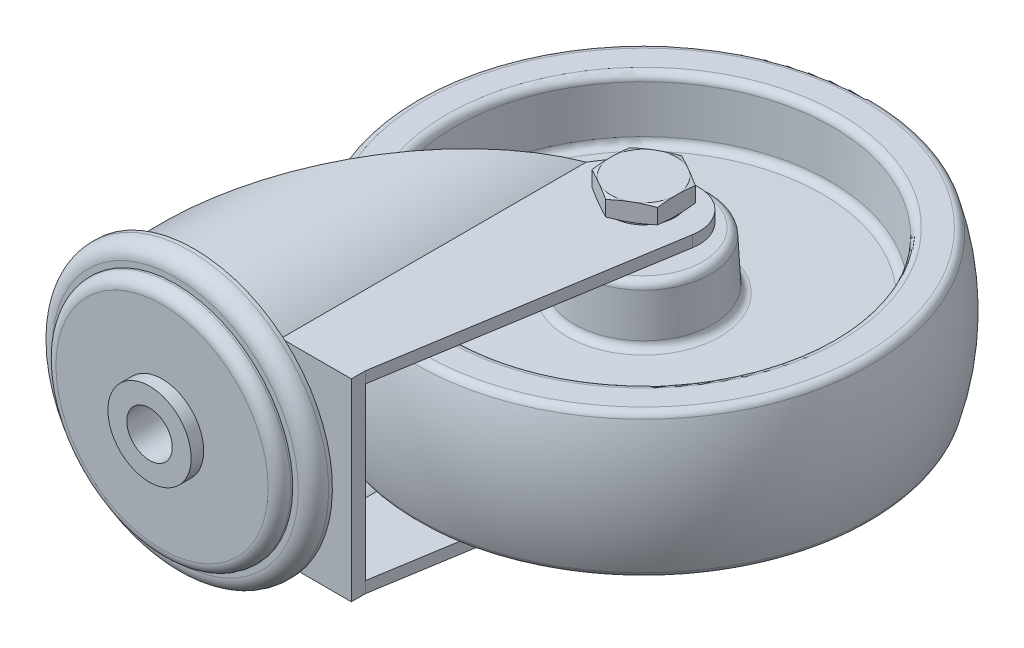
ISO-10303-21;
HEADER;
FILE_DESCRIPTION(('STEP AP214'),'2;1');
FILE_NAME('part.step','',(''),(''),'','','');
FILE_SCHEMA(('AUTOMOTIVE_DESIGN { 1 0 10303 214 1 1 1 1 }'));
ENDSEC;
DATA;
#1=APPLICATION_CONTEXT('core data for automotive mechanical design processes');
#2=APPLICATION_PROTOCOL_DEFINITION('international standard','automotive_design',2000,#1);
#3=PRODUCT_CONTEXT('',#1,'mechanical');
#4=PRODUCT('Part','Part','',(#3));
#5=PRODUCT_RELATED_PRODUCT_CATEGORY('part','',(#4));
#6=PRODUCT_DEFINITION_FORMATION('','',#4);
#7=PRODUCT_DEFINITION_CONTEXT('part definition',#1,'design');
#8=PRODUCT_DEFINITION('design','',#6,#7);
#9=PRODUCT_DEFINITION_SHAPE('','',#8);
#10=(LENGTH_UNIT() NAMED_UNIT(*) SI_UNIT(.MILLI.,.METRE.));
#11=(NAMED_UNIT(*) PLANE_ANGLE_UNIT() SI_UNIT($,.RADIAN.));
#12=(NAMED_UNIT(*) SI_UNIT($,.STERADIAN.) SOLID_ANGLE_UNIT());
#13=UNCERTAINTY_MEASURE_WITH_UNIT(LENGTH_MEASURE(1.E-05),#10,'distance_accuracy_value','');
#14=(GEOMETRIC_REPRESENTATION_CONTEXT(3) GLOBAL_UNCERTAINTY_ASSIGNED_CONTEXT((#13)) GLOBAL_UNIT_ASSIGNED_CONTEXT((#10,
#11,#12)) REPRESENTATION_CONTEXT('',''));
#15=CARTESIAN_POINT('',(0.,0.,0.));
#16=DIRECTION('',(0.,0.,1.));
#17=DIRECTION('',(1.,0.,0.));
#18=AXIS2_PLACEMENT_3D('',#15,#16,#17);
#19=CARTESIAN_POINT('',(21.39792913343,-19.,-93.5));
#20=DIRECTION('',(0.,-1.,0.));
#21=DIRECTION('',(1.,0.,0.));
#22=AXIS2_PLACEMENT_3D('',#19,#20,#21);
#23=PLANE('',#22);
#24=CARTESIAN_POINT('',(37.,-19.,-93.5));
#25=DIRECTION('',(0.,1.,0.));
#26=DIRECTION('',(-1.,0.,0.));
#27=AXIS2_PLACEMENT_3D('',#24,#25,#26);
#28=CIRCLE('',#27,7.5);
#29=CARTESIAN_POINT('',(29.5,-19.,-93.5));
#30=VERTEX_POINT('',#29);
#31=EDGE_CURVE('E9',#30,#30,#28,.T.);
#32=ORIENTED_EDGE('',*,*,#31,.T.);
#33=EDGE_LOOP('',(#32));
#34=FACE_BOUND('',#33,.T.);
#35=CARTESIAN_POINT('',(37.,-19.,-93.5));
#36=DIRECTION('',(0.,1.,0.));
#37=DIRECTION('',(-1.,0.,0.));
#38=AXIS2_PLACEMENT_3D('',#35,#36,#37);
#39=CIRCLE('',#38,15.60207086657);
#40=CARTESIAN_POINT('',(21.39792913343,-19.,-93.5));
#41=VERTEX_POINT('',#40);
#42=EDGE_CURVE('E2567',#41,#41,#39,.T.);
#43=ORIENTED_EDGE('',*,*,#42,.F.);
#44=EDGE_LOOP('',(#43));
#45=FACE_BOUND('',#44,.T.);
#46=ADVANCED_FACE('F14',(#34,#45),#23,.T.);
#47=CARTESIAN_POINT('',(29.5,19.,-93.5));
#48=DIRECTION('',(0.,1.,0.));
#49=DIRECTION('',(-1.,0.,0.));
#50=AXIS2_PLACEMENT_3D('',#47,#48,#49);
#51=PLANE('',#50);
#52=CARTESIAN_POINT('',(37.,19.,-93.5));
#53=DIRECTION('',(0.,1.,0.));
#54=DIRECTION('',(-1.,0.,0.));
#55=AXIS2_PLACEMENT_3D('',#52,#53,#54);
#56=CIRCLE('',#55,15.60207086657);
#57=CARTESIAN_POINT('',(21.39792913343,19.,-93.5));
#58=VERTEX_POINT('',#57);
#59=EDGE_CURVE('E2522',#58,#58,#56,.T.);
#60=ORIENTED_EDGE('',*,*,#59,.T.);
#61=EDGE_LOOP('',(#60));
#62=FACE_BOUND('',#61,.T.);
#63=CARTESIAN_POINT('',(37.,19.,-93.5));
#64=DIRECTION('',(0.,1.,0.));
#65=DIRECTION('',(-1.,0.,0.));
#66=AXIS2_PLACEMENT_3D('',#63,#64,#65);
#67=CIRCLE('',#66,7.5);
#68=CARTESIAN_POINT('',(29.5,19.,-93.5));
#69=VERTEX_POINT('',#68);
#70=EDGE_CURVE('E24',#69,#69,#67,.T.);
#71=ORIENTED_EDGE('',*,*,#70,.F.);
#72=EDGE_LOOP('',(#71));
#73=FACE_BOUND('',#72,.T.);
#74=ADVANCED_FACE('F1251',(#62,#73),#51,.T.);
#75=CARTESIAN_POINT('',(37.,17.000000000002,-93.5));
#76=DIRECTION('',(0.,1.,0.));
#77=DIRECTION('',(-1.,0.,0.));
#78=AXIS2_PLACEMENT_3D('',#75,#76,#77);
#79=TOROIDAL_SURFACE('',#78,15.6020708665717,1.99999999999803);
#80=CARTESIAN_POINT('',(37.,17.104671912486,-93.5));
#81=DIRECTION('',(0.,1.,0.));
#82=DIRECTION('',(-1.,0.,0.));
#83=AXIS2_PLACEMENT_3D('',#80,#81,#82);
#84=CIRCLE('',#83,17.599329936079);
#85=CARTESIAN_POINT('',(19.400670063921,17.104671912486,-93.5));
#86=VERTEX_POINT('',#85);
#87=EDGE_CURVE('E2525',#86,#86,#84,.T.);
#88=ORIENTED_EDGE('',*,*,#87,.T.);
#89=EDGE_LOOP('',(#88));
#90=FACE_BOUND('',#89,.T.);
#91=ORIENTED_EDGE('',*,*,#59,.F.);
#92=EDGE_LOOP('',(#91));
#93=FACE_BOUND('',#92,.T.);
#94=ADVANCED_FACE('F1240',(#90,#93),#79,.T.);
#95=CARTESIAN_POINT('',(37.,17.104671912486,-93.5));
#96=DIRECTION('',(0.,-1.,0.));
#97=DIRECTION('',(1.,0.,0.));
#98=AXIS2_PLACEMENT_3D('',#95,#96,#97);
#99=CONICAL_SURFACE('',#98,17.599329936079,0.0523598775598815);
#100=CARTESIAN_POINT('',(37.,5.9417897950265,-93.5));
#101=DIRECTION('',(0.,1.,0.));
#102=DIRECTION('',(-1.,0.,0.));
#103=AXIS2_PLACEMENT_3D('',#100,#101,#102);
#104=CIRCLE('',#103,18.184351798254);
#105=CARTESIAN_POINT('',(18.815648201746,5.9417897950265,-93.5));
#106=VERTEX_POINT('',#105);
#107=EDGE_CURVE('E2528',#106,#106,#104,.T.);
#108=ORIENTED_EDGE('',*,*,#107,.T.);
#109=EDGE_LOOP('',(#108));
#110=FACE_BOUND('',#109,.T.);
#111=ORIENTED_EDGE('',*,*,#87,.F.);
#112=EDGE_LOOP('',(#111));
#113=FACE_BOUND('',#112,.T.);
#114=ADVANCED_FACE('F1229',(#110,#113),#99,.T.);
#115=CARTESIAN_POINT('',(37.,6.0464617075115,-93.5));
#116=DIRECTION('',(0.,1.,0.));
#117=DIRECTION('',(-1.,0.,0.));
#118=AXIS2_PLACEMENT_3D('',#115,#116,#117);
#119=TOROIDAL_SURFACE('',#118,20.1816108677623,1.99999999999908);
#120=CARTESIAN_POINT('',(37.,4.0476800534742,-93.5));
#121=DIRECTION('',(0.,1.,0.));
#122=DIRECTION('',(-1.,0.,0.));
#123=AXIS2_PLACEMENT_3D('',#120,#121,#122);
#124=CIRCLE('',#123,20.111811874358);
#125=CARTESIAN_POINT('',(16.888188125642,4.0476800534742,-93.5));
#126=VERTEX_POINT('',#125);
#127=EDGE_CURVE('E2531',#126,#126,#124,.T.);
#128=ORIENTED_EDGE('',*,*,#127,.T.);
#129=EDGE_LOOP('',(#128));
#130=FACE_BOUND('',#129,.T.);
#131=ORIENTED_EDGE('',*,*,#107,.F.);
#132=EDGE_LOOP('',(#131));
#133=FACE_BOUND('',#132,.T.);
#134=ADVANCED_FACE('F1218',(#130,#133),#119,.F.);
#135=CARTESIAN_POINT('',(37.,4.0476800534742,-93.5));
#136=DIRECTION('',(0.,-1.,0.));
#137=DIRECTION('',(1.,0.,0.));
#138=AXIS2_PLACEMENT_3D('',#135,#136,#137);
#139=CONICAL_SURFACE('',#138,20.111811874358,1.53588974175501);
#140=CARTESIAN_POINT('',(37.,3.1017739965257,-93.5));
#141=DIRECTION('',(0.,1.,0.));
#142=DIRECTION('',(-1.,0.,0.));
#143=AXIS2_PLACEMENT_3D('',#140,#141,#142);
#144=CIRCLE('',#143,47.199017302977);
#145=CARTESIAN_POINT('',(-10.199017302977,3.1017739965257,-93.5));
#146=VERTEX_POINT('',#145);
#147=EDGE_CURVE('E2534',#146,#146,#144,.T.);
#148=ORIENTED_EDGE('',*,*,#147,.T.);
#149=EDGE_LOOP('',(#148));
#150=FACE_BOUND('',#149,.T.);
#151=ORIENTED_EDGE('',*,*,#127,.F.);
#152=EDGE_LOOP('',(#151));
#153=FACE_BOUND('',#152,.T.);
#154=ADVANCED_FACE('F1207',(#150,#153),#139,.T.);
#155=CARTESIAN_POINT('',(37.,5.1005556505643,-93.5));
#156=DIRECTION('',(0.,1.,0.));
#157=DIRECTION('',(-1.,0.,0.));
#158=AXIS2_PLACEMENT_3D('',#155,#156,#157);
#159=TOROIDAL_SURFACE('',#158,47.2688162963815,2.00000000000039);
#160=CARTESIAN_POINT('',(37.,4.995883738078,-93.5));
#161=DIRECTION('',(0.,1.,0.));
#162=DIRECTION('',(-1.,0.,0.));
#163=AXIS2_PLACEMENT_3D('',#160,#161,#162);
#164=CIRCLE('',#163,49.266075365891);
#165=CARTESIAN_POINT('',(-12.266075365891,4.995883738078,-93.5));
#166=VERTEX_POINT('',#165);
#167=EDGE_CURVE('E2537',#166,#166,#164,.T.);
#168=ORIENTED_EDGE('',*,*,#167,.T.);
#169=EDGE_LOOP('',(#168));
#170=FACE_BOUND('',#169,.T.);
#171=ORIENTED_EDGE('',*,*,#147,.F.);
#172=EDGE_LOOP('',(#171));
#173=FACE_BOUND('',#172,.T.);
#174=ADVANCED_FACE('F1196',(#170,#173),#159,.F.);
#175=CARTESIAN_POINT('',(37.,4.995883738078,-93.5));
#176=DIRECTION('',(0.,1.,0.));
#177=DIRECTION('',(-1.,0.,0.));
#178=AXIS2_PLACEMENT_3D('',#175,#176,#177);
#179=CONICAL_SURFACE('',#178,49.266075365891,0.0523598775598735);
#180=CARTESIAN_POINT('',(37.,17.104671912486,-93.5));
#181=DIRECTION('',(0.,1.,0.));
#182=DIRECTION('',(-1.,0.,0.));
#183=AXIS2_PLACEMENT_3D('',#180,#181,#182);
#184=CIRCLE('',#183,49.900670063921);
#185=CARTESIAN_POINT('',(-12.900670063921,17.104671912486,-93.5));
#186=VERTEX_POINT('',#185);
#187=EDGE_CURVE('E2540',#186,#186,#184,.T.);
#188=ORIENTED_EDGE('',*,*,#187,.T.);
#189=EDGE_LOOP('',(#188));
#190=FACE_BOUND('',#189,.T.);
#191=ORIENTED_EDGE('',*,*,#167,.F.);
#192=EDGE_LOOP('',(#191));
#193=FACE_BOUND('',#192,.T.);
#194=ADVANCED_FACE('F1185',(#190,#193),#179,.F.);
#195=CARTESIAN_POINT('',(37.,17.000000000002,-93.5));
#196=DIRECTION('',(0.,1.,0.));
#197=DIRECTION('',(-1.,0.,0.));
#198=AXIS2_PLACEMENT_3D('',#195,#196,#197);
#199=TOROIDAL_SURFACE('',#198,51.8979291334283,1.99999999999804);
#200=CARTESIAN_POINT('',(37.,19.,-93.5));
#201=DIRECTION('',(0.,1.,0.));
#202=DIRECTION('',(-1.,0.,0.));
#203=AXIS2_PLACEMENT_3D('',#200,#201,#202);
#204=CIRCLE('',#203,51.89792913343);
#205=CARTESIAN_POINT('',(-14.89792913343,19.,-93.5));
#206=VERTEX_POINT('',#205);
#207=EDGE_CURVE('E2543',#206,#206,#204,.T.);
#208=ORIENTED_EDGE('',*,*,#207,.T.);
#209=EDGE_LOOP('',(#208));
#210=FACE_BOUND('',#209,.T.);
#211=ORIENTED_EDGE('',*,*,#187,.F.);
#212=EDGE_LOOP('',(#211));
#213=FACE_BOUND('',#212,.T.);
#214=ADVANCED_FACE('F1175',(#210,#213),#199,.T.);
#215=CARTESIAN_POINT('',(-14.89792913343,19.,-93.5));
#216=DIRECTION('',(0.,1.,0.));
#217=DIRECTION('',(-1.,0.,0.));
#218=AXIS2_PLACEMENT_3D('',#215,#216,#217);
#219=PLANE('',#218);
#220=CARTESIAN_POINT('',(37.,19.,-93.5));
#221=DIRECTION('',(0.,1.,0.));
#222=DIRECTION('',(-1.,0.,0.));
#223=AXIS2_PLACEMENT_3D('',#220,#221,#222);
#224=CIRCLE('',#223,58.062466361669);
#225=CARTESIAN_POINT('',(-21.062466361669,19.,-93.5));
#226=VERTEX_POINT('',#225);
#227=EDGE_CURVE('E2570',#226,#226,#224,.T.);
#228=ORIENTED_EDGE('',*,*,#227,.T.);
#229=EDGE_LOOP('',(#228));
#230=FACE_BOUND('',#229,.T.);
#231=ORIENTED_EDGE('',*,*,#207,.F.);
#232=EDGE_LOOP('',(#231));
#233=FACE_BOUND('',#232,.T.);
#234=ADVANCED_FACE('F1165',(#230,#233),#219,.T.);
#235=CARTESIAN_POINT('',(-20.5,-19.,-93.5));
#236=DIRECTION('',(0.,-1.,0.));
#237=DIRECTION('',(1.,0.,0.));
#238=AXIS2_PLACEMENT_3D('',#235,#236,#237);
#239=PLANE('',#238);
#240=CARTESIAN_POINT('',(37.,-19.,-93.5));
#241=DIRECTION('',(0.,1.,0.));
#242=DIRECTION('',(-1.,0.,0.));
#243=AXIS2_PLACEMENT_3D('',#240,#241,#242);
#244=CIRCLE('',#243,58.062466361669);
#245=CARTESIAN_POINT('',(-21.062466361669,-19.,-93.5));
#246=VERTEX_POINT('',#245);
#247=EDGE_CURVE('E2579',#246,#246,#244,.T.);
#248=ORIENTED_EDGE('',*,*,#247,.F.);
#249=EDGE_LOOP('',(#248));
#250=FACE_BOUND('',#249,.T.);
#251=CARTESIAN_POINT('',(37.,-19.,-93.5));
#252=DIRECTION('',(0.,1.,0.));
#253=DIRECTION('',(-1.,0.,0.));
#254=AXIS2_PLACEMENT_3D('',#251,#252,#253);
#255=CIRCLE('',#254,51.89792913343);
#256=CARTESIAN_POINT('',(-14.89792913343,-19.,-93.5));
#257=VERTEX_POINT('',#256);
#258=EDGE_CURVE('E2546',#257,#257,#255,.T.);
#259=ORIENTED_EDGE('',*,*,#258,.T.);
#260=EDGE_LOOP('',(#259));
#261=FACE_BOUND('',#260,.T.);
#262=ADVANCED_FACE('F1154',(#250,#261),#239,.T.);
#263=CARTESIAN_POINT('',(37.,-17.000000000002,-93.5));
#264=DIRECTION('',(0.,1.,0.));
#265=DIRECTION('',(-1.,0.,0.));
#266=AXIS2_PLACEMENT_3D('',#263,#264,#265);
#267=TOROIDAL_SURFACE('',#266,51.8979291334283,1.99999999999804);
#268=CARTESIAN_POINT('',(37.,-17.104671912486,-93.5));
#269=DIRECTION('',(0.,1.,0.));
#270=DIRECTION('',(-1.,0.,0.));
#271=AXIS2_PLACEMENT_3D('',#268,#269,#270);
#272=CIRCLE('',#271,49.900670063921);
#273=CARTESIAN_POINT('',(-12.900670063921,-17.104671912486,-93.5));
#274=VERTEX_POINT('',#273);
#275=EDGE_CURVE('E2549',#274,#274,#272,.T.);
#276=ORIENTED_EDGE('',*,*,#275,.T.);
#277=EDGE_LOOP('',(#276));
#278=FACE_BOUND('',#277,.T.);
#279=ORIENTED_EDGE('',*,*,#258,.F.);
#280=EDGE_LOOP('',(#279));
#281=FACE_BOUND('',#280,.T.);
#282=ADVANCED_FACE('F1143',(#278,#281),#267,.T.);
#283=CARTESIAN_POINT('',(37.,-17.104671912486,-93.5));
#284=DIRECTION('',(0.,-1.,0.));
#285=DIRECTION('',(1.,0.,0.));
#286=AXIS2_PLACEMENT_3D('',#283,#284,#285);
#287=CONICAL_SURFACE('',#286,49.900670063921,0.0523598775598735);
#288=CARTESIAN_POINT('',(37.,-4.99588373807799,-93.5));
#289=DIRECTION('',(0.,1.,0.));
#290=DIRECTION('',(-1.,0.,0.));
#291=AXIS2_PLACEMENT_3D('',#288,#289,#290);
#292=CIRCLE('',#291,49.266075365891);
#293=CARTESIAN_POINT('',(-12.266075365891,-4.99588373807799,-93.5));
#294=VERTEX_POINT('',#293);
#295=EDGE_CURVE('E2552',#294,#294,#292,.T.);
#296=ORIENTED_EDGE('',*,*,#295,.T.);
#297=EDGE_LOOP('',(#296));
#298=FACE_BOUND('',#297,.T.);
#299=ORIENTED_EDGE('',*,*,#275,.F.);
#300=EDGE_LOOP('',(#299));
#301=FACE_BOUND('',#300,.T.);
#302=ADVANCED_FACE('F1132',(#298,#301),#287,.F.);
#303=CARTESIAN_POINT('',(37.,-5.1005556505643,-93.5));
#304=DIRECTION('',(0.,1.,0.));
#305=DIRECTION('',(-1.,0.,0.));
#306=AXIS2_PLACEMENT_3D('',#303,#304,#305);
#307=TOROIDAL_SURFACE('',#306,47.2688162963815,2.00000000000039);
#308=CARTESIAN_POINT('',(37.,-3.1017739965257,-93.5));
#309=DIRECTION('',(0.,1.,0.));
#310=DIRECTION('',(-1.,0.,0.));
#311=AXIS2_PLACEMENT_3D('',#308,#309,#310);
#312=CIRCLE('',#311,47.199017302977);
#313=CARTESIAN_POINT('',(-10.199017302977,-3.1017739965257,-93.5));
#314=VERTEX_POINT('',#313);
#315=EDGE_CURVE('E2555',#314,#314,#312,.T.);
#316=ORIENTED_EDGE('',*,*,#315,.T.);
#317=EDGE_LOOP('',(#316));
#318=FACE_BOUND('',#317,.T.);
#319=ORIENTED_EDGE('',*,*,#295,.F.);
#320=EDGE_LOOP('',(#319));
#321=FACE_BOUND('',#320,.T.);
#322=ADVANCED_FACE('F1121',(#318,#321),#307,.F.);
#323=CARTESIAN_POINT('',(37.,-3.1017739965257,-93.5));
#324=DIRECTION('',(0.,1.,0.));
#325=DIRECTION('',(-1.,0.,0.));
#326=AXIS2_PLACEMENT_3D('',#323,#324,#325);
#327=CONICAL_SURFACE('',#326,47.199017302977,1.53588974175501);
#328=CARTESIAN_POINT('',(37.,-4.0476800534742,-93.5));
#329=DIRECTION('',(0.,1.,0.));
#330=DIRECTION('',(-1.,0.,0.));
#331=AXIS2_PLACEMENT_3D('',#328,#329,#330);
#332=CIRCLE('',#331,20.111811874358);
#333=CARTESIAN_POINT('',(16.888188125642,-4.0476800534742,-93.5));
#334=VERTEX_POINT('',#333);
#335=EDGE_CURVE('E2558',#334,#334,#332,.T.);
#336=ORIENTED_EDGE('',*,*,#335,.T.);
#337=EDGE_LOOP('',(#336));
#338=FACE_BOUND('',#337,.T.);
#339=ORIENTED_EDGE('',*,*,#315,.F.);
#340=EDGE_LOOP('',(#339));
#341=FACE_BOUND('',#340,.T.);
#342=ADVANCED_FACE('F1110',(#338,#341),#327,.T.);
#343=CARTESIAN_POINT('',(37.,-6.0464617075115,-93.5));
#344=DIRECTION('',(0.,1.,0.));
#345=DIRECTION('',(-1.,0.,0.));
#346=AXIS2_PLACEMENT_3D('',#343,#344,#345);
#347=TOROIDAL_SURFACE('',#346,20.1816108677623,1.99999999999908);
#348=CARTESIAN_POINT('',(37.,-5.9417897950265,-93.5));
#349=DIRECTION('',(0.,1.,0.));
#350=DIRECTION('',(-1.,0.,0.));
#351=AXIS2_PLACEMENT_3D('',#348,#349,#350);
#352=CIRCLE('',#351,18.184351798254);
#353=CARTESIAN_POINT('',(18.815648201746,-5.9417897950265,-93.5));
#354=VERTEX_POINT('',#353);
#355=EDGE_CURVE('E2561',#354,#354,#352,.T.);
#356=ORIENTED_EDGE('',*,*,#355,.T.);
#357=EDGE_LOOP('',(#356));
#358=FACE_BOUND('',#357,.T.);
#359=ORIENTED_EDGE('',*,*,#335,.F.);
#360=EDGE_LOOP('',(#359));
#361=FACE_BOUND('',#360,.T.);
#362=ADVANCED_FACE('F1099',(#358,#361),#347,.F.);
#363=CARTESIAN_POINT('',(37.,-5.9417897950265,-93.5));
#364=DIRECTION('',(0.,1.,0.));
#365=DIRECTION('',(-1.,0.,0.));
#366=AXIS2_PLACEMENT_3D('',#363,#364,#365);
#367=CONICAL_SURFACE('',#366,18.184351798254,0.0523598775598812);
#368=CARTESIAN_POINT('',(37.,-17.104671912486,-93.5));
#369=DIRECTION('',(0.,1.,0.));
#370=DIRECTION('',(-1.,0.,0.));
#371=AXIS2_PLACEMENT_3D('',#368,#369,#370);
#372=CIRCLE('',#371,17.599329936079);
#373=CARTESIAN_POINT('',(19.400670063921,-17.104671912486,-93.5));
#374=VERTEX_POINT('',#373);
#375=EDGE_CURVE('E2564',#374,#374,#372,.T.);
#376=ORIENTED_EDGE('',*,*,#375,.T.);
#377=EDGE_LOOP('',(#376));
#378=FACE_BOUND('',#377,.T.);
#379=ORIENTED_EDGE('',*,*,#355,.F.);
#380=EDGE_LOOP('',(#379));
#381=FACE_BOUND('',#380,.T.);
#382=ADVANCED_FACE('F1087',(#378,#381),#367,.T.);
#383=CARTESIAN_POINT('',(37.,-17.000000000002,-93.5));
#384=DIRECTION('',(0.,1.,0.));
#385=DIRECTION('',(-1.,0.,0.));
#386=AXIS2_PLACEMENT_3D('',#383,#384,#385);
#387=TOROIDAL_SURFACE('',#386,15.6020708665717,1.99999999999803);
#388=ORIENTED_EDGE('',*,*,#42,.T.);
#389=EDGE_LOOP('',(#388));
#390=FACE_BOUND('',#389,.T.);
#391=ORIENTED_EDGE('',*,*,#375,.F.);
#392=EDGE_LOOP('',(#391));
#393=FACE_BOUND('',#392,.T.);
#394=ADVANCED_FACE('F1075',(#390,#393),#387,.T.);
#395=CARTESIAN_POINT('',(37.,16.9999999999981,-93.5));
#396=DIRECTION('',(0.,1.,0.));
#397=DIRECTION('',(-1.,0.,0.));
#398=AXIS2_PLACEMENT_3D('',#395,#396,#397);
#399=TOROIDAL_SURFACE('',#398,58.0624663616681,2.0000000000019);
#400=CARTESIAN_POINT('',(37.,17.561983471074,-93.5));
#401=DIRECTION('',(0.,1.,0.));
#402=DIRECTION('',(-1.,0.,0.));
#403=AXIS2_PLACEMENT_3D('',#400,#401,#402);
#404=CIRCLE('',#403,59.981886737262);
#405=CARTESIAN_POINT('',(-22.9818867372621,17.561983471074,-93.5));
#406=VERTEX_POINT('',#405);
#407=EDGE_CURVE('E2573',#406,#406,#404,.T.);
#408=ORIENTED_EDGE('',*,*,#407,.T.);
#409=EDGE_LOOP('',(#408));
#410=FACE_BOUND('',#409,.T.);
#411=ORIENTED_EDGE('',*,*,#227,.F.);
#412=EDGE_LOOP('',(#411));
#413=FACE_BOUND('',#412,.T.);
#414=ADVANCED_FACE('F1064',(#410,#413),#399,.T.);
#415=CARTESIAN_POINT('',(37.0000000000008,0.,-93.5));
#416=DIRECTION('',(0.,1.,0.));
#417=DIRECTION('',(-1.,0.,0.));
#418=AXIS2_PLACEMENT_3D('',#415,#416,#417);
#419=SPHERICAL_SURFACE('',#418,62.5000000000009);
#420=CARTESIAN_POINT('',(37.,-17.561983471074,-93.5));
#421=DIRECTION('',(0.,1.,0.));
#422=DIRECTION('',(-1.,0.,0.));
#423=AXIS2_PLACEMENT_3D('',#420,#421,#422);
#424=CIRCLE('',#423,59.981886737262);
#425=CARTESIAN_POINT('',(-22.9818867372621,-17.561983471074,-93.5));
#426=VERTEX_POINT('',#425);
#427=EDGE_CURVE('E2576',#426,#426,#424,.T.);
#428=CARTESIAN_POINT('',(-22.9818867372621,-17.561983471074,-93.5));
#429=CARTESIAN_POINT('',(-23.0860981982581,-17.2060568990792,-93.5));
#430=CARTESIAN_POINT('',(-23.1871408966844,-16.8492025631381,-93.5));
#431=CARTESIAN_POINT('',(-23.3828583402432,-16.1337518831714,-93.5));
#432=CARTESIAN_POINT('',(-23.4775330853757,-15.7751555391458,-93.5));
#433=CARTESIAN_POINT('',(-23.660484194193,-15.0563343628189,-93.5));
#434=CARTESIAN_POINT('',(-23.7487605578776,-14.6961095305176,-93.5));
#435=CARTESIAN_POINT('',(-23.9188870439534,-13.9741455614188,-93.5));
#436=CARTESIAN_POINT('',(-24.0007371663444,-13.6124064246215,-93.5));
#437=CARTESIAN_POINT('',(-24.1579852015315,-12.8875284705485,-93.5));
#438=CARTESIAN_POINT('',(-24.2333831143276,-12.5243896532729,-93.5));
#439=CARTESIAN_POINT('',(-24.3777028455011,-11.7968274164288,-93.5));
#440=CARTESIAN_POINT('',(-24.4466246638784,-11.4324039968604,-93.5));
#441=CARTESIAN_POINT('',(-24.5779703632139,-10.7023880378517,-93.5));
#442=CARTESIAN_POINT('',(-24.640394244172,-10.3367954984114,-93.5));
#443=CARTESIAN_POINT('',(-24.7587242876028,-9.60455715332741,-93.5));
#444=CARTESIAN_POINT('',(-24.8146304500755,-9.23791134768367,-93.5));
#445=CARTESIAN_POINT('',(-24.919907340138,-8.50368265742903,-93.5));
#446=CARTESIAN_POINT('',(-24.9692780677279,-8.13609977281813,-93.5));
#447=CARTESIAN_POINT('',(-25.0614684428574,-7.40011340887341,-93.5));
#448=CARTESIAN_POINT('',(-25.104288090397,-7.03170992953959,-93.5));
#449=CARTESIAN_POINT('',(-25.1833627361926,-6.29419912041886,-93.5));
#450=CARTESIAN_POINT('',(-25.2196177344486,-5.92509179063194,-93.5));
#451=CARTESIAN_POINT('',(-25.2855515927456,-5.18629024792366,-93.5));
#452=CARTESIAN_POINT('',(-25.3152304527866,-4.81659603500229,-93.5));
#453=CARTESIAN_POINT('',(-25.3680026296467,-4.07673787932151,-93.5));
#454=CARTESIAN_POINT('',(-25.3910959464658,-3.70657393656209,-93.5));
#455=CARTESIAN_POINT('',(-25.4306897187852,-2.96589362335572,-93.5));
#456=CARTESIAN_POINT('',(-25.4471901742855,-2.59537725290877,-93.5));
#457=CARTESIAN_POINT('',(-25.4735929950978,-1.85410949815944,-93.5));
#458=CARTESIAN_POINT('',(-25.4834953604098,-1.48335811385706,-93.5));
#459=CARTESIAN_POINT('',(-25.4966988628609,-0.741737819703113,-93.5));
#460=CARTESIAN_POINT('',(-25.5000000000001,-0.370868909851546,-93.5));
#461=CARTESIAN_POINT('',(-25.5000000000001,0.370868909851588,-93.5));
#462=CARTESIAN_POINT('',(-25.4966988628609,0.741737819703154,-93.5));
#463=CARTESIAN_POINT('',(-25.4834953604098,1.4833581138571,-93.5));
#464=CARTESIAN_POINT('',(-25.4735929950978,1.85410949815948,-93.5));
#465=CARTESIAN_POINT('',(-25.4471901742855,2.59537725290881,-93.5));
#466=CARTESIAN_POINT('',(-25.4306897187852,2.96589362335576,-93.5));
#467=CARTESIAN_POINT('',(-25.3910959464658,3.70657393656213,-93.5));
#468=CARTESIAN_POINT('',(-25.3680026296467,4.07673787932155,-93.5));
#469=CARTESIAN_POINT('',(-25.3152304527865,4.81659603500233,-93.5));
#470=CARTESIAN_POINT('',(-25.2855515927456,5.1862902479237,-93.5));
#471=CARTESIAN_POINT('',(-25.2196177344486,5.92509179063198,-93.5));
#472=CARTESIAN_POINT('',(-25.1833627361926,6.2941991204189,-93.5));
#473=CARTESIAN_POINT('',(-25.104288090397,7.03170992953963,-93.5));
#474=CARTESIAN_POINT('',(-25.0614684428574,7.40011340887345,-93.5));
#475=CARTESIAN_POINT('',(-24.9692780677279,8.13609977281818,-93.5));
#476=CARTESIAN_POINT('',(-24.919907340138,8.50368265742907,-93.5));
#477=CARTESIAN_POINT('',(-24.8146304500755,9.23791134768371,-93.5));
#478=CARTESIAN_POINT('',(-24.7587242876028,9.60455715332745,-93.5));
#479=CARTESIAN_POINT('',(-24.640394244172,10.3367954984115,-93.5));
#480=CARTESIAN_POINT('',(-24.5779703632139,10.7023880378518,-93.5));
#481=CARTESIAN_POINT('',(-24.4466246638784,11.4324039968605,-93.5));
#482=CARTESIAN_POINT('',(-24.377702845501,11.7968274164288,-93.5));
#483=CARTESIAN_POINT('',(-24.2333831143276,12.5243896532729,-93.5));
#484=CARTESIAN_POINT('',(-24.1579852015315,12.8875284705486,-93.5));
#485=CARTESIAN_POINT('',(-24.0007371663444,13.6124064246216,-93.5));
#486=CARTESIAN_POINT('',(-23.9188870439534,13.9741455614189,-93.5));
#487=CARTESIAN_POINT('',(-23.7487605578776,14.6961095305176,-93.5));
#488=CARTESIAN_POINT('',(-23.660484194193,15.056334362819,-93.5));
#489=CARTESIAN_POINT('',(-23.4775330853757,15.7751555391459,-93.5));
#490=CARTESIAN_POINT('',(-23.3828583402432,16.1337518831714,-93.5));
#491=CARTESIAN_POINT('',(-23.1871408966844,16.8492025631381,-93.5));
#492=CARTESIAN_POINT('',(-23.0860981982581,17.2060568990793,-93.5));
#493=CARTESIAN_POINT('',(-22.9818867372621,17.561983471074,-93.5));
#494=B_SPLINE_CURVE_WITH_KNOTS('',3,(#428,#429,#430,#431,#432,#433,#434,#435,#436,#437,#438,
#439,#440,#441,#442,#443,#444,#445,#446,#447,#448,#449,#450,#451,#452,#453,#454,#455,#456,#457,
#458,#459,#460,#461,#462,#463,#464,#465,#466,#467,#468,#469,#470,#471,#472,#473,#474,#475,#476,
#477,#478,#479,#480,#481,#482,#483,#484,#485,#486,#487,#488,#489,#490,#491,#492,#493),
.UNSPECIFIED.,.F.,.F.,(4,2,2,2,2,2,2,2,2,2,2,2,2,2,2,2,2,2,2,2,2,2,2,2,2,2,2,2,2,2,2,2,4),(0.,
1.11259203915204,2.2251840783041,3.33777611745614,4.45036815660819,5.56296019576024,
6.67555223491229,7.78814427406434,8.90073631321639,10.0133283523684,11.1259203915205,
12.2385124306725,13.3511044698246,14.4636965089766,15.5762885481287,16.6888805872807,
17.8014726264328,18.9140646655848,20.0266567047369,21.1392487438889,22.251840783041,
23.364432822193,24.4770248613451,25.5896169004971,26.7022089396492,27.8148009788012,
28.9273930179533,30.0399850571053,31.1525770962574,32.2651691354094,33.3777611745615,
34.4903532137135,35.6029452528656),.UNSPECIFIED.);
#495=EDGE_CURVE('BSEAM1052',#426,#406,#494,.T.);
#496=ORIENTED_EDGE('',*,*,#427,.T.);
#497=ORIENTED_EDGE('',*,*,#407,.F.);
#498=ORIENTED_EDGE('',*,*,#495,.T.);
#499=ORIENTED_EDGE('',*,*,#495,.F.);
#500=EDGE_LOOP('',(#496,#498,#497,#499));
#501=FACE_BOUND('',#500,.T.);
#502=ADVANCED_FACE('F1052',(#501),#419,.T.);
#503=CARTESIAN_POINT('',(37.,-16.9999999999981,-93.5));
#504=DIRECTION('',(0.,1.,0.));
#505=DIRECTION('',(-1.,0.,0.));
#506=AXIS2_PLACEMENT_3D('',#503,#504,#505);
#507=TOROIDAL_SURFACE('',#506,58.0624663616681,2.0000000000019);
#508=ORIENTED_EDGE('',*,*,#247,.T.);
#509=EDGE_LOOP('',(#508));
#510=FACE_BOUND('',#509,.T.);
#511=ORIENTED_EDGE('',*,*,#427,.F.);
#512=EDGE_LOOP('',(#511));
#513=FACE_BOUND('',#512,.T.);
#514=ADVANCED_FACE('F488',(#510,#513),#507,.T.);
#515=CARTESIAN_POINT('',(37.,-40.5,-98.4265));
#516=DIRECTION('',(0.,-1.,0.));
#517=DIRECTION('',(-1.,0.,0.));
#518=AXIS2_PLACEMENT_3D('',#515,#516,#517);
#519=PLANE('',#518);
#520=CARTESIAN_POINT('',(37.,-40.5,-93.5));
#521=DIRECTION('',(0.,1.,0.));
#522=DIRECTION('',(1.,0.,0.));
#523=AXIS2_PLACEMENT_3D('',#520,#521,#522);
#524=CIRCLE('',#523,4.9265);
#525=CARTESIAN_POINT('',(41.9265,-40.5,-93.5));
#526=VERTEX_POINT('',#525);
#527=EDGE_CURVE('E716',#526,#526,#524,.T.);
#528=ORIENTED_EDGE('',*,*,#527,.F.);
#529=EDGE_LOOP('',(#528));
#530=FACE_BOUND('',#529,.T.);
#531=ADVANCED_FACE('F470',(#530),#519,.T.);
#532=CARTESIAN_POINT('',(37.,-39.4265,-93.5));
#533=DIRECTION('',(0.,1.,0.));
#534=DIRECTION('',(1.,0.,0.));
#535=AXIS2_PLACEMENT_3D('',#532,#533,#534);
#536=CONICAL_SURFACE('',#535,6.,0.785398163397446);
#537=ORIENTED_EDGE('',*,*,#527,.T.);
#538=EDGE_LOOP('',(#537));
#539=FACE_BOUND('',#538,.T.);
#540=CARTESIAN_POINT('',(37.,-39.4265,-93.5));
#541=DIRECTION('',(0.,1.,0.));
#542=DIRECTION('',(1.,0.,0.));
#543=AXIS2_PLACEMENT_3D('',#540,#541,#542);
#544=CIRCLE('',#543,6.);
#545=CARTESIAN_POINT('',(43.,-39.4265,-93.5));
#546=VERTEX_POINT('',#545);
#547=EDGE_CURVE('E711',#546,#546,#544,.T.);
#548=ORIENTED_EDGE('',*,*,#547,.F.);
#549=EDGE_LOOP('',(#548));
#550=FACE_BOUND('',#549,.T.);
#551=ADVANCED_FACE('F647',(#539,#550),#536,.T.);
#552=CARTESIAN_POINT('',(37.,-40.5,-93.5));
#553=DIRECTION('',(0.,1.,0.));
#554=DIRECTION('',(1.,0.,0.));
#555=AXIS2_PLACEMENT_3D('',#552,#553,#554);
#556=CYLINDRICAL_SURFACE('',#555,6.);
#557=ORIENTED_EDGE('',*,*,#547,.T.);
#558=EDGE_LOOP('',(#557));
#559=FACE_BOUND('',#558,.T.);
#560=CARTESIAN_POINT('',(37.,-37.5,-93.5));
#561=DIRECTION('',(0.,1.,0.));
#562=DIRECTION('',(1.,0.,0.));
#563=AXIS2_PLACEMENT_3D('',#560,#561,#562);
#564=CIRCLE('',#563,6.);
#565=CARTESIAN_POINT('',(43.,-37.5,-93.5));
#566=VERTEX_POINT('',#565);
#567=EDGE_CURVE('E2434',#566,#566,#564,.T.);
#568=ORIENTED_EDGE('',*,*,#567,.F.);
#569=EDGE_LOOP('',(#568));
#570=FACE_BOUND('',#569,.T.);
#571=ADVANCED_FACE('F651',(#559,#570),#556,.T.);
#572=CARTESIAN_POINT('',(37.,-37.5,-99.5));
#573=DIRECTION('',(0.,1.,0.));
#574=DIRECTION('',(1.,0.,0.));
#575=AXIS2_PLACEMENT_3D('',#572,#573,#574);
#576=PLANE('',#575);
#577=CARTESIAN_POINT('',(37.,-37.5,-93.5));
#578=DIRECTION('',(0.,1.,0.));
#579=DIRECTION('',(1.,0.,0.));
#580=AXIS2_PLACEMENT_3D('',#577,#578,#579);
#581=CIRCLE('',#580,8.315);
#582=CARTESIAN_POINT('',(45.315,-37.5,-93.5));
#583=VERTEX_POINT('',#582);
#584=EDGE_CURVE('E2486',#583,#583,#581,.T.);
#585=ORIENTED_EDGE('',*,*,#584,.F.);
#586=EDGE_LOOP('',(#585));
#587=FACE_BOUND('',#586,.T.);
#588=ORIENTED_EDGE('',*,*,#567,.T.);
#589=EDGE_LOOP('',(#588));
#590=FACE_BOUND('',#589,.T.);
#591=ADVANCED_FACE('F430',(#587,#590),#576,.F.);
#592=CARTESIAN_POINT('',(37.,30.8,-93.5));
#593=DIRECTION('',(0.,1.,0.));
#594=DIRECTION('',(1.,0.,0.));
#595=AXIS2_PLACEMENT_3D('',#592,#593,#594);
#596=PLANE('',#595);
#597=CARTESIAN_POINT('',(37.,30.8,-93.5));
#598=DIRECTION('',(0.,1.,0.));
#599=DIRECTION('',(1.,0.,0.));
#600=AXIS2_PLACEMENT_3D('',#597,#598,#599);
#601=CIRCLE('',#600,8.6625);
#602=CARTESIAN_POINT('',(45.6625,30.8,-93.5));
#603=VERTEX_POINT('',#602);
#604=CARTESIAN_POINT('',(41.33125,30.8,-101.001945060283));
#605=VERTEX_POINT('',#604);
#606=EDGE_CURVE('E305',#603,#605,#601,.T.);
#607=ORIENTED_EDGE('',*,*,#606,.T.);
#608=CARTESIAN_POINT('',(32.66875,30.8,-101.001945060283));
#609=VERTEX_POINT('',#608);
#610=EDGE_CURVE('E315',#605,#609,#601,.T.);
#611=ORIENTED_EDGE('',*,*,#610,.T.);
#612=CARTESIAN_POINT('',(28.3375,30.8,-93.5));
#613=VERTEX_POINT('',#612);
#614=EDGE_CURVE('E319',#609,#613,#601,.T.);
#615=ORIENTED_EDGE('',*,*,#614,.T.);
#616=CARTESIAN_POINT('',(32.66875,30.8,-85.9980549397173));
#617=VERTEX_POINT('',#616);
#618=EDGE_CURVE('E2823',#613,#617,#601,.T.);
#619=ORIENTED_EDGE('',*,*,#618,.T.);
#620=CARTESIAN_POINT('',(41.33125,30.8,-85.9980549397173));
#621=VERTEX_POINT('',#620);
#622=EDGE_CURVE('E308',#617,#621,#601,.T.);
#623=ORIENTED_EDGE('',*,*,#622,.T.);
#624=EDGE_CURVE('E297',#621,#603,#601,.T.);
#625=ORIENTED_EDGE('',*,*,#624,.T.);
#626=EDGE_LOOP('',(#607,#611,#615,#619,#623,#625));
#627=FACE_BOUND('',#626,.T.);
#628=ADVANCED_FACE('F303',(#627),#596,.T.);
#629=CARTESIAN_POINT('',(0.,0.,-11.8));
#630=DIRECTION('',(0.,0.,1.));
#631=DIRECTION('',(0.,1.,0.));
#632=AXIS2_PLACEMENT_3D('',#629,#630,#631);
#633=CYLINDRICAL_SURFACE('',#632,31.025);
#634=CARTESIAN_POINT('',(0.,0.,-6.8));
#635=DIRECTION('',(0.,0.,1.));
#636=DIRECTION('',(0.,1.,0.));
#637=AXIS2_PLACEMENT_3D('',#634,#635,#636);
#638=CIRCLE('',#637,31.025);
#639=CARTESIAN_POINT('',(0.,31.025,-6.8));
#640=VERTEX_POINT('',#639);
#641=EDGE_CURVE('E2606',#640,#640,#638,.T.);
#642=ORIENTED_EDGE('',*,*,#641,.T.);
#643=EDGE_LOOP('',(#642));
#644=FACE_BOUND('',#643,.T.);
#645=CARTESIAN_POINT('',(0.,0.,-6.3));
#646=DIRECTION('',(0.,0.,1.));
#647=DIRECTION('',(0.,1.,0.));
#648=AXIS2_PLACEMENT_3D('',#645,#646,#647);
#649=CIRCLE('',#648,31.025);
#650=CARTESIAN_POINT('',(0.,31.025,-6.3));
#651=VERTEX_POINT('',#650);
#652=EDGE_CURVE('E2608',#651,#651,#649,.T.);
#653=ORIENTED_EDGE('',*,*,#652,.F.);
#654=EDGE_LOOP('',(#653));
#655=FACE_BOUND('',#654,.T.);
#656=ADVANCED_FACE('F506',(#644,#655),#633,.T.);
#657=CARTESIAN_POINT('',(37.,-37.5,-93.5));
#658=DIRECTION('',(0.,1.,0.));
#659=DIRECTION('',(1.,0.,0.));
#660=AXIS2_PLACEMENT_3D('',#657,#658,#659);
#661=CYLINDRICAL_SURFACE('',#660,8.315);
#662=CARTESIAN_POINT('',(37.,-33.75,-93.5));
#663=DIRECTION('',(0.,1.,0.));
#664=DIRECTION('',(1.,0.,0.));
#665=AXIS2_PLACEMENT_3D('',#662,#663,#664);
#666=CIRCLE('',#665,8.315);
#667=CARTESIAN_POINT('',(45.315,-33.75,-93.5));
#668=VERTEX_POINT('',#667);
#669=EDGE_CURVE('E2482',#668,#668,#666,.T.);
#670=ORIENTED_EDGE('',*,*,#669,.F.);
#671=EDGE_LOOP('',(#670));
#672=FACE_BOUND('',#671,.T.);
#673=ORIENTED_EDGE('',*,*,#584,.T.);
#674=EDGE_LOOP('',(#673));
#675=FACE_BOUND('',#674,.T.);
#676=ADVANCED_FACE('F503',(#672,#675),#661,.T.);
#677=CARTESIAN_POINT('',(0.,0.,-6.2999999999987));
#678=DIRECTION('',(0.,0.,1.));
#679=DIRECTION('',(0.,1.,0.));
#680=AXIS2_PLACEMENT_3D('',#677,#678,#679);
#681=TOROIDAL_SURFACE('',#680,28.0250000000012,2.99999999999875);
#682=ORIENTED_EDGE('',*,*,#652,.T.);
#683=EDGE_LOOP('',(#682));
#684=FACE_BOUND('',#683,.T.);
#685=CARTESIAN_POINT('',(0.,0.,-3.3));
#686=DIRECTION('',(0.,0.,1.));
#687=DIRECTION('',(0.,1.,0.));
#688=AXIS2_PLACEMENT_3D('',#685,#686,#687);
#689=CIRCLE('',#688,28.025);
#690=CARTESIAN_POINT('',(0.,28.025,-3.3));
#691=VERTEX_POINT('',#690);
#692=EDGE_CURVE('E2610',#691,#691,#689,.T.);
#693=ORIENTED_EDGE('',*,*,#692,.F.);
#694=EDGE_LOOP('',(#693));
#695=FACE_BOUND('',#694,.T.);
#696=ADVANCED_FACE('F481',(#684,#695),#681,.T.);
#697=CARTESIAN_POINT('',(37.,30.8,-93.5));
#698=DIRECTION('',(0.,-1.,0.));
#699=DIRECTION('',(-1.,0.,0.));
#700=AXIS2_PLACEMENT_3D('',#697,#698,#699);
#701=CONICAL_SURFACE('',#700,8.6625,1.30899693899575);
#702=CARTESIAN_POINT('',(28.3375,28.8837908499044,-80.269723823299));
#703=CARTESIAN_POINT('',(28.3375,28.9718654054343,-80.6627165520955));
#704=CARTESIAN_POINT('',(28.3375,29.0588628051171,-81.0559550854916));
#705=CARTESIAN_POINT('',(28.3375,29.2301218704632,-81.8430444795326));
#706=CARTESIAN_POINT('',(28.3375,29.3143834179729,-82.2368953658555));
#707=CARTESIAN_POINT('',(28.3375,29.479662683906,-83.0256829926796));
#708=CARTESIAN_POINT('',(28.3375,29.5606771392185,-83.4206204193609));
#709=CARTESIAN_POINT('',(28.3375,29.7185877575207,-84.2113172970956));
#710=CARTESIAN_POINT('',(28.3375,29.795483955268,-84.607076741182));
#711=CARTESIAN_POINT('',(28.3375,29.9435847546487,-85.3964043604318));
#712=CARTESIAN_POINT('',(28.3375,30.0148297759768,-85.7899649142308));
#713=CARTESIAN_POINT('',(28.3375,30.151099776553,-86.5781595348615));
#714=CARTESIAN_POINT('',(28.3375,30.2161248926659,-86.9727935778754));
#715=CARTESIAN_POINT('',(28.3375,30.3384909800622,-87.7632117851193));
#716=CARTESIAN_POINT('',(28.3375,30.3958328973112,-88.1589958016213));
#717=CARTESIAN_POINT('',(28.3375,30.5011428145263,-88.951823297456));
#718=CARTESIAN_POINT('',(28.3375,30.5491108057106,-89.3488667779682));
#719=CARTESIAN_POINT('',(28.3375,30.6343145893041,-90.1486925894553));
#720=CARTESIAN_POINT('',(28.3375,30.6714220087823,-90.5514888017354));
#721=CARTESIAN_POINT('',(28.3375,30.7323447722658,-91.3580938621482));
#722=CARTESIAN_POINT('',(28.3375,30.7561604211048,-91.7619026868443));
#723=CARTESIAN_POINT('',(28.3375,30.7891106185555,-92.5699472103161));
#724=CARTESIAN_POINT('',(28.3375,30.7982518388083,-92.974182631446));
#725=CARTESIAN_POINT('',(28.3375,30.8012911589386,-93.782711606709));
#726=CARTESIAN_POINT('',(28.3375,30.7951892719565,-94.1870051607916));
#727=CARTESIAN_POINT('',(28.3375,30.768085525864,-94.9965535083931));
#728=CARTESIAN_POINT('',(28.3375,30.7470295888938,-95.4018064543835));
#729=CARTESIAN_POINT('',(28.3375,30.6912196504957,-96.2113592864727));
#730=CARTESIAN_POINT('',(28.3375,30.6564653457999,-96.6156591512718));
#731=CARTESIAN_POINT('',(28.3375,30.5750142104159,-97.4233024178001));
#732=CARTESIAN_POINT('',(28.3375,30.5283095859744,-97.8266450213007));
#733=CARTESIAN_POINT('',(28.3375,30.4249012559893,-98.6320321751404));
#734=CARTESIAN_POINT('',(28.3375,30.368197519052,-99.0340767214));
#735=CARTESIAN_POINT('',(28.3375,30.2506304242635,-99.8103294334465));
#736=CARTESIAN_POINT('',(28.3375,30.1902912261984,-100.184617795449));
#737=CARTESIAN_POINT('',(28.3375,30.0637562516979,-100.932208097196));
#738=CARTESIAN_POINT('',(28.3375,29.997560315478,-101.305510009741));
#739=CARTESIAN_POINT('',(28.3375,29.8603817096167,-102.051263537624));
#740=CARTESIAN_POINT('',(28.3375,29.7893986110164,-102.423715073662));
#741=CARTESIAN_POINT('',(28.3375,29.6435257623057,-103.167854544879));
#742=CARTESIAN_POINT('',(28.3375,29.5686359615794,-103.539542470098));
#743=CARTESIAN_POINT('',(28.3375,29.4156395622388,-104.282341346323));
#744=CARTESIAN_POINT('',(28.3375,29.3375322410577,-104.653452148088));
#745=CARTESIAN_POINT('',(28.3375,29.1786765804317,-105.395108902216));
#746=CARTESIAN_POINT('',(28.3375,29.0979282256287,-105.76565485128));
#747=CARTESIAN_POINT('',(28.3375,28.8524343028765,-106.876521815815));
#748=CARTESIAN_POINT('',(28.3375,28.6844293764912,-107.616122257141));
#749=CARTESIAN_POINT('',(28.3375,28.3440377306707,-109.086649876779));
#750=CARTESIAN_POINT('',(28.3375,28.1717102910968,-109.817590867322));
#751=CARTESIAN_POINT('',(28.3375,27.8227370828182,-111.278453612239));
#752=CARTESIAN_POINT('',(28.3375,27.6460912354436,-112.008375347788));
#753=CARTESIAN_POINT('',(28.3375,27.2898327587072,-113.466538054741));
#754=CARTESIAN_POINT('',(28.3375,27.1102240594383,-114.194779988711));
#755=CARTESIAN_POINT('',(28.3375,26.7485541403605,-115.650629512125));
#756=CARTESIAN_POINT('',(28.3375,26.5664930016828,-116.378237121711));
#757=CARTESIAN_POINT('',(28.3375,26.3835628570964,-117.105623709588));
#758=B_SPLINE_CURVE_WITH_KNOTS('',3,(#702,#703,#704,#705,#706,#707,#708,#709,#710,#711,#712,
#713,#714,#715,#716,#717,#718,#719,#720,#721,#722,#723,#724,#725,#726,#727,#728,#729,#730,#731,
#732,#733,#734,#735,#736,#737,#738,#739,#740,#741,#742,#743,#744,#745,#746,#747,#748,#749,#750,
#751,#752,#753,#754,#755,#756,#757),.UNSPECIFIED.,.F.,.F.,(4,2,2,2,2,2,2,2,2,2,2,2,2,2,2,2,2,2,
2,2,2,2,2,2,2,2,2,4),(0.,1.20822828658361,2.41650868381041,3.62597434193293,4.83542979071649,
6.03526153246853,7.23506686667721,8.43472434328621,9.63438294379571,10.847696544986,
12.0609823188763,13.2737163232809,14.4864492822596,15.703590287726,16.9207582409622,
18.1387220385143,19.3566896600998,20.4939973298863,21.6313360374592,22.7687767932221,
23.9062322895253,25.0439446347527,26.1816635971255,28.4569473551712,30.7098731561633,
32.9628400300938,35.2130266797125,37.4631390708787),.UNSPECIFIED.);
#759=CARTESIAN_POINT('',(28.3375,30.4409230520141,-98.5012967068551));
#760=VERTEX_POINT('',#759);
#761=EDGE_CURVE('E615',#613,#760,#758,.T.);
#762=ORIENTED_EDGE('',*,*,#761,.F.);
#763=ORIENTED_EDGE('',*,*,#614,.F.);
#764=CARTESIAN_POINT('',(28.3373,30.4408921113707,-98.5011812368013));
#765=CARTESIAN_POINT('',(28.697048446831,30.4965683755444,-98.7088820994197));
#766=CARTESIAN_POINT('',(29.0574491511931,30.5471132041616,-98.9169595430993));
#767=CARTESIAN_POINT('',(29.7795233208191,30.6359156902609,-99.3338492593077));
#768=CARTESIAN_POINT('',(30.1411972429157,30.6741683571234,-99.542661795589));
#769=CARTESIAN_POINT('',(30.8636250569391,30.7361533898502,-99.9597556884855));
#770=CARTESIAN_POINT('',(31.224374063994,30.7599596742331,-100.168034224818));
#771=CARTESIAN_POINT('',(31.9463321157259,30.7918814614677,-100.58485690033));
#772=CARTESIAN_POINT('',(32.307541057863,30.8,-100.793400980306));
#773=CARTESIAN_POINT('',(33.029958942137,30.8,-101.210489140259));
#774=CARTESIAN_POINT('',(33.391167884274,30.7918814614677,-101.419033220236));
#775=CARTESIAN_POINT('',(34.113125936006,30.7599596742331,-101.835855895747));
#776=CARTESIAN_POINT('',(34.4738749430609,30.7361533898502,-102.04413443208));
#777=CARTESIAN_POINT('',(35.1963027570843,30.6741683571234,-102.461228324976));
#778=CARTESIAN_POINT('',(35.5579766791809,30.6359156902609,-102.670040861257));
#779=CARTESIAN_POINT('',(36.2800508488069,30.5471132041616,-103.086930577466));
#780=CARTESIAN_POINT('',(36.640451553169,30.4965683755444,-103.295008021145));
#781=CARTESIAN_POINT('',(37.0002,30.4408921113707,-103.502708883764));
#782=B_SPLINE_CURVE_WITH_KNOTS('',3,(#764,#765,#766,#767,#768,#769,#770,#771,#772,#773,#774,
#775,#776,#777,#778,#779,#780,#781),.UNSPECIFIED.,.F.,.F.,(4,2,2,2,2,2,2,2,4),(0.,
1.25741465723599,2.51533918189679,3.76677172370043,5.01796208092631,6.26915243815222,
7.52058497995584,8.77850950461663,10.0359241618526),.UNSPECIFIED.);
#783=EDGE_CURVE('E629',#760,#609,#782,.T.);
#784=ORIENTED_EDGE('',*,*,#783,.F.);
#785=EDGE_LOOP('',(#762,#763,#784));
#786=FACE_BOUND('',#785,.T.);
#787=ADVANCED_FACE('F502',(#786),#701,.T.);
#788=CARTESIAN_POINT('',(28.3375,30.4409230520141,-88.4987032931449));
#789=VERTEX_POINT('',#788);
#790=EDGE_CURVE('E788',#789,#613,#758,.T.);
#791=ORIENTED_EDGE('',*,*,#790,.F.);
#792=CARTESIAN_POINT('',(37.0002,30.4408921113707,-83.4972911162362));
#793=CARTESIAN_POINT('',(36.640451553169,30.4965683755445,-83.7049919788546));
#794=CARTESIAN_POINT('',(36.2800508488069,30.5471132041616,-83.9130694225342));
#795=CARTESIAN_POINT('',(35.5579766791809,30.6359156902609,-84.3299591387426));
#796=CARTESIAN_POINT('',(35.1963027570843,30.6741683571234,-84.5387716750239));
#797=CARTESIAN_POINT('',(34.4738749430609,30.7361533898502,-84.9558655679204));
#798=CARTESIAN_POINT('',(34.113125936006,30.7599596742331,-85.1641441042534));
#799=CARTESIAN_POINT('',(33.3911678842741,30.7918814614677,-85.5809667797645));
#800=CARTESIAN_POINT('',(33.029958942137,30.8,-85.7895108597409));
#801=CARTESIAN_POINT('',(32.307541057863,30.8,-86.206599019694));
#802=CARTESIAN_POINT('',(31.9463321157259,30.7918814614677,-86.4151430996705));
#803=CARTESIAN_POINT('',(31.224374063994,30.7599596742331,-86.8319657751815));
#804=CARTESIAN_POINT('',(30.8636250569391,30.7361533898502,-87.0402443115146));
#805=CARTESIAN_POINT('',(30.1411972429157,30.6741683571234,-87.457338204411));
#806=CARTESIAN_POINT('',(29.7795233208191,30.6359156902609,-87.6661507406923));
#807=CARTESIAN_POINT('',(29.0574491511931,30.5471132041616,-88.0830404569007));
#808=CARTESIAN_POINT('',(28.697048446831,30.4965683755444,-88.2911179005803));
#809=CARTESIAN_POINT('',(28.3373,30.4408921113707,-88.4988187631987));
#810=B_SPLINE_CURVE_WITH_KNOTS('',3,(#792,#793,#794,#795,#796,#797,#798,#799,#800,#801,#802,
#803,#804,#805,#806,#807,#808,#809),.UNSPECIFIED.,.F.,.F.,(4,2,2,2,2,2,2,2,4),(0.,
1.25741465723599,2.51533918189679,3.76677172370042,5.01796208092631,6.26915243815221,
7.52058497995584,8.77850950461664,10.0359241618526),.UNSPECIFIED.);
#811=EDGE_CURVE('E607',#617,#789,#810,.T.);
#812=ORIENTED_EDGE('',*,*,#811,.F.);
#813=ORIENTED_EDGE('',*,*,#618,.F.);
#814=EDGE_LOOP('',(#791,#812,#813));
#815=FACE_BOUND('',#814,.T.);
#816=ADVANCED_FACE('F511',(#815),#701,.T.);
#817=CARTESIAN_POINT('',(37.,30.4409230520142,-83.49740658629));
#818=VERTEX_POINT('',#817);
#819=EDGE_CURVE('E775',#818,#617,#810,.T.);
#820=ORIENTED_EDGE('',*,*,#819,.F.);
#821=CARTESIAN_POINT('',(45.6627,30.4408921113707,-88.4988187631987));
#822=CARTESIAN_POINT('',(45.302951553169,30.4965683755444,-88.2911179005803));
#823=CARTESIAN_POINT('',(44.9425508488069,30.5471132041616,-88.0830404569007));
#824=CARTESIAN_POINT('',(44.2204766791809,30.6359156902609,-87.6661507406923));
#825=CARTESIAN_POINT('',(43.8588027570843,30.6741683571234,-87.457338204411));
#826=CARTESIAN_POINT('',(43.136374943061,30.7361533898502,-87.0402443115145));
#827=CARTESIAN_POINT('',(42.775625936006,30.7599596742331,-86.8319657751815));
#828=CARTESIAN_POINT('',(42.0536678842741,30.7918814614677,-86.4151430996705));
#829=CARTESIAN_POINT('',(41.692458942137,30.8,-86.206599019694));
#830=CARTESIAN_POINT('',(40.970041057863,30.8,-85.7895108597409));
#831=CARTESIAN_POINT('',(40.608832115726,30.7918814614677,-85.5809667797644));
#832=CARTESIAN_POINT('',(39.886874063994,30.7599596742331,-85.1641441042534));
#833=CARTESIAN_POINT('',(39.5261250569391,30.7361533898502,-84.9558655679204));
#834=CARTESIAN_POINT('',(38.8036972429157,30.6741683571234,-84.5387716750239));
#835=CARTESIAN_POINT('',(38.4420233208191,30.6359156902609,-84.3299591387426));
#836=CARTESIAN_POINT('',(37.7199491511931,30.5471132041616,-83.9130694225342));
#837=CARTESIAN_POINT('',(37.359548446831,30.4965683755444,-83.7049919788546));
#838=CARTESIAN_POINT('',(36.9998,30.4408921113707,-83.4972911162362));
#839=B_SPLINE_CURVE_WITH_KNOTS('',3,(#821,#822,#823,#824,#825,#826,#827,#828,#829,#830,#831,
#832,#833,#834,#835,#836,#837,#838),.UNSPECIFIED.,.F.,.F.,(4,2,2,2,2,2,2,2,4),(0.,
1.25741465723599,2.51533918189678,3.76677172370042,5.01796208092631,6.2691524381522,
7.52058497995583,8.77850950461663,10.0359241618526),.UNSPECIFIED.);
#840=EDGE_CURVE('E598',#621,#818,#839,.T.);
#841=ORIENTED_EDGE('',*,*,#840,.F.);
#842=ORIENTED_EDGE('',*,*,#622,.F.);
#843=EDGE_LOOP('',(#820,#841,#842));
#844=FACE_BOUND('',#843,.T.);
#845=ADVANCED_FACE('F551',(#844),#701,.T.);
#846=CARTESIAN_POINT('',(45.6625,30.4409230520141,-88.4987032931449));
#847=VERTEX_POINT('',#846);
#848=EDGE_CURVE('E299',#847,#621,#839,.T.);
#849=ORIENTED_EDGE('',*,*,#848,.F.);
#850=CARTESIAN_POINT('',(45.6625,28.8837908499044,-80.269723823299));
#851=CARTESIAN_POINT('',(45.6625,28.9718654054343,-80.6627165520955));
#852=CARTESIAN_POINT('',(45.6625,29.0588628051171,-81.0559550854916));
#853=CARTESIAN_POINT('',(45.6625,29.2301218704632,-81.8430444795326));
#854=CARTESIAN_POINT('',(45.6625,29.3143834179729,-82.2368953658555));
#855=CARTESIAN_POINT('',(45.6625,29.479662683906,-83.0256829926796));
#856=CARTESIAN_POINT('',(45.6625,29.5606771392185,-83.4206204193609));
#857=CARTESIAN_POINT('',(45.6625,29.7185877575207,-84.2113172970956));
#858=CARTESIAN_POINT('',(45.6625,29.795483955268,-84.607076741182));
#859=CARTESIAN_POINT('',(45.6625,29.9435847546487,-85.3964043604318));
#860=CARTESIAN_POINT('',(45.6625,30.0148297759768,-85.7899649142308));
#861=CARTESIAN_POINT('',(45.6625,30.151099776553,-86.5781595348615));
#862=CARTESIAN_POINT('',(45.6625,30.2161248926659,-86.9727935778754));
#863=CARTESIAN_POINT('',(45.6625,30.3384909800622,-87.7632117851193));
#864=CARTESIAN_POINT('',(45.6625,30.3958328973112,-88.1589958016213));
#865=CARTESIAN_POINT('',(45.6625,30.5011428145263,-88.951823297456));
#866=CARTESIAN_POINT('',(45.6625,30.5491108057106,-89.3488667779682));
#867=CARTESIAN_POINT('',(45.6625,30.6343145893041,-90.1486925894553));
#868=CARTESIAN_POINT('',(45.6625,30.6714220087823,-90.5514888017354));
#869=CARTESIAN_POINT('',(45.6625,30.7323447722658,-91.3580938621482));
#870=CARTESIAN_POINT('',(45.6625,30.7561604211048,-91.7619026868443));
#871=CARTESIAN_POINT('',(45.6625,30.7891106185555,-92.5699472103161));
#872=CARTESIAN_POINT('',(45.6625,30.7982518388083,-92.974182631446));
#873=CARTESIAN_POINT('',(45.6625,30.8012911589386,-93.782711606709));
#874=CARTESIAN_POINT('',(45.6625,30.7951892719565,-94.1870051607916));
#875=CARTESIAN_POINT('',(45.6625,30.768085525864,-94.9965535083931));
#876=CARTESIAN_POINT('',(45.6625,30.7470295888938,-95.4018064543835));
#877=CARTESIAN_POINT('',(45.6625,30.6912196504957,-96.2113592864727));
#878=CARTESIAN_POINT('',(45.6625,30.6564653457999,-96.6156591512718));
#879=CARTESIAN_POINT('',(45.6625,30.5750142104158,-97.4233024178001));
#880=CARTESIAN_POINT('',(45.6625,30.5283095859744,-97.8266450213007));
#881=CARTESIAN_POINT('',(45.6625,30.4249012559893,-98.6320321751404));
#882=CARTESIAN_POINT('',(45.6625,30.368197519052,-99.0340767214));
#883=CARTESIAN_POINT('',(45.6625,30.2506304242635,-99.8103294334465));
#884=CARTESIAN_POINT('',(45.6625,30.1902912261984,-100.184617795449));
#885=CARTESIAN_POINT('',(45.6625,30.0637562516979,-100.932208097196));
#886=CARTESIAN_POINT('',(45.6625,29.997560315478,-101.305510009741));
#887=CARTESIAN_POINT('',(45.6625,29.8603817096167,-102.051263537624));
#888=CARTESIAN_POINT('',(45.6625,29.7893986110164,-102.423715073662));
#889=CARTESIAN_POINT('',(45.6625,29.6435257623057,-103.167854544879));
#890=CARTESIAN_POINT('',(45.6625,29.5686359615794,-103.539542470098));
#891=CARTESIAN_POINT('',(45.6625,29.4156395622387,-104.282341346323));
#892=CARTESIAN_POINT('',(45.6625,29.3375322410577,-104.653452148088));
#893=CARTESIAN_POINT('',(45.6625,29.1786765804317,-105.395108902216));
#894=CARTESIAN_POINT('',(45.6625,29.0979282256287,-105.76565485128));
#895=CARTESIAN_POINT('',(45.6625,28.8524343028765,-106.876521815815));
#896=CARTESIAN_POINT('',(45.6625,28.6844293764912,-107.616122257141));
#897=CARTESIAN_POINT('',(45.6625,28.3440377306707,-109.086649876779));
#898=CARTESIAN_POINT('',(45.6625,28.1717102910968,-109.817590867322));
#899=CARTESIAN_POINT('',(45.6625,27.8227370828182,-111.278453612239));
#900=CARTESIAN_POINT('',(45.6625,27.6460912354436,-112.008375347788));
#901=CARTESIAN_POINT('',(45.6625,27.2898327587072,-113.466538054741));
#902=CARTESIAN_POINT('',(45.6625,27.1102240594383,-114.194779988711));
#903=CARTESIAN_POINT('',(45.6625,26.7485541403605,-115.650629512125));
#904=CARTESIAN_POINT('',(45.6625,26.5664930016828,-116.378237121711));
#905=CARTESIAN_POINT('',(45.6625,26.3835628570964,-117.105623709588));
#906=B_SPLINE_CURVE_WITH_KNOTS('',3,(#850,#851,#852,#853,#854,#855,#856,#857,#858,#859,#860,
#861,#862,#863,#864,#865,#866,#867,#868,#869,#870,#871,#872,#873,#874,#875,#876,#877,#878,#879,
#880,#881,#882,#883,#884,#885,#886,#887,#888,#889,#890,#891,#892,#893,#894,#895,#896,#897,#898,
#899,#900,#901,#902,#903,#904,#905),.UNSPECIFIED.,.F.,.F.,(4,2,2,2,2,2,2,2,2,2,2,2,2,2,2,2,2,2,
2,2,2,2,2,2,2,2,2,4),(0.,1.2082282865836,2.41650868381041,3.62597434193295,4.83542979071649,
6.03526153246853,7.23506686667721,8.43472434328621,9.63438294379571,10.847696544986,
12.0609823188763,13.2737163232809,14.4864492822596,15.703590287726,16.9207582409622,
18.1387220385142,19.3566896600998,20.4939973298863,21.6313360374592,22.7687767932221,
23.9062322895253,25.0439446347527,26.1816635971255,28.4569473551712,30.7098731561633,
32.9628400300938,35.2130266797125,37.4631390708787),.UNSPECIFIED.);
#907=EDGE_CURVE('E283',#603,#847,#906,.F.);
#908=ORIENTED_EDGE('',*,*,#907,.F.);
#909=ORIENTED_EDGE('',*,*,#624,.F.);
#910=EDGE_LOOP('',(#849,#908,#909));
#911=FACE_BOUND('',#910,.T.);
#912=ADVANCED_FACE('F296',(#911),#701,.T.);
#913=CARTESIAN_POINT('',(36.9998,30.4408921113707,-103.502708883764));
#914=CARTESIAN_POINT('',(37.359548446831,30.4965683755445,-103.295008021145));
#915=CARTESIAN_POINT('',(37.7199491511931,30.5471132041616,-103.086930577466));
#916=CARTESIAN_POINT('',(38.4420233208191,30.6359156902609,-102.670040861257));
#917=CARTESIAN_POINT('',(38.8036972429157,30.6741683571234,-102.461228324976));
#918=CARTESIAN_POINT('',(39.5261250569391,30.7361533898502,-102.04413443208));
#919=CARTESIAN_POINT('',(39.886874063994,30.7599596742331,-101.835855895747));
#920=CARTESIAN_POINT('',(40.6088321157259,30.7918814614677,-101.419033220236));
#921=CARTESIAN_POINT('',(40.970041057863,30.8,-101.210489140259));
#922=CARTESIAN_POINT('',(41.692458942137,30.8,-100.793400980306));
#923=CARTESIAN_POINT('',(42.0536678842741,30.7918814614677,-100.58485690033));
#924=CARTESIAN_POINT('',(42.7756259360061,30.7599596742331,-100.168034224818));
#925=CARTESIAN_POINT('',(43.136374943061,30.7361533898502,-99.9597556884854));
#926=CARTESIAN_POINT('',(43.8588027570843,30.6741683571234,-99.542661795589));
#927=CARTESIAN_POINT('',(44.2204766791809,30.6359156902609,-99.3338492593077));
#928=CARTESIAN_POINT('',(44.9425508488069,30.5471132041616,-98.9169595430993));
#929=CARTESIAN_POINT('',(45.302951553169,30.4965683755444,-98.7088820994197));
#930=CARTESIAN_POINT('',(45.6627,30.4408921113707,-98.5011812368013));
#931=B_SPLINE_CURVE_WITH_KNOTS('',3,(#913,#914,#915,#916,#917,#918,#919,#920,#921,#922,#923,
#924,#925,#926,#927,#928,#929,#930),.UNSPECIFIED.,.F.,.F.,(4,2,2,2,2,2,2,2,4),(0.,
1.25741465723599,2.51533918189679,3.76677172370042,5.01796208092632,6.26915243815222,
7.52058497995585,8.77850950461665,10.0359241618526),.UNSPECIFIED.);
#932=CARTESIAN_POINT('',(45.6625,30.4409230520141,-98.5012967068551));
#933=VERTEX_POINT('',#932);
#934=EDGE_CURVE('E312',#605,#933,#931,.T.);
#935=ORIENTED_EDGE('',*,*,#934,.F.);
#936=ORIENTED_EDGE('',*,*,#606,.F.);
#937=EDGE_CURVE('E279',#933,#603,#906,.F.);
#938=ORIENTED_EDGE('',*,*,#937,.F.);
#939=EDGE_LOOP('',(#935,#936,#938));
#940=FACE_BOUND('',#939,.T.);
#941=ADVANCED_FACE('F311',(#940),#701,.T.);
#942=CARTESIAN_POINT('',(37.,30.4409230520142,-103.50259341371));
#943=VERTEX_POINT('',#942);
#944=EDGE_CURVE('E623',#609,#943,#782,.T.);
#945=ORIENTED_EDGE('',*,*,#944,.F.);
#946=ORIENTED_EDGE('',*,*,#610,.F.);
#947=EDGE_CURVE('E718',#943,#605,#931,.T.);
#948=ORIENTED_EDGE('',*,*,#947,.F.);
#949=EDGE_LOOP('',(#945,#946,#948));
#950=FACE_BOUND('',#949,.T.);
#951=ADVANCED_FACE('F514',(#950),#701,.T.);
#952=CARTESIAN_POINT('',(-31.025,0.,-6.8));
#953=DIRECTION('',(0.,0.,1.));
#954=DIRECTION('',(0.,1.,0.));
#955=AXIS2_PLACEMENT_3D('',#952,#953,#954);
#956=PLANE('',#955);
#957=CARTESIAN_POINT('',(0.,0.,-6.8));
#958=DIRECTION('',(0.,0.,1.));
#959=DIRECTION('',(0.,1.,0.));
#960=AXIS2_PLACEMENT_3D('',#957,#958,#959);
#961=CIRCLE('',#960,32.5);
#962=CARTESIAN_POINT('',(0.,32.5,-6.8));
#963=VERTEX_POINT('',#962);
#964=EDGE_CURVE('E2604',#963,#963,#961,.T.);
#965=ORIENTED_EDGE('',*,*,#964,.T.);
#966=EDGE_LOOP('',(#965));
#967=FACE_BOUND('',#966,.T.);
#968=ORIENTED_EDGE('',*,*,#641,.F.);
#969=EDGE_LOOP('',(#968));
#970=FACE_BOUND('',#969,.T.);
#971=ADVANCED_FACE('F534',(#967,#970),#956,.T.);
#972=CARTESIAN_POINT('',(37.,-33.75,-101.815));
#973=DIRECTION('',(0.,1.,0.));
#974=DIRECTION('',(1.,0.,0.));
#975=AXIS2_PLACEMENT_3D('',#972,#973,#974);
#976=PLANE('',#975);
#977=CARTESIAN_POINT('',(37.,-33.75,-93.5));
#978=DIRECTION('',(0.,1.,0.));
#979=DIRECTION('',(1.,0.,0.));
#980=AXIS2_PLACEMENT_3D('',#977,#978,#979);
#981=CIRCLE('',#980,8.6625);
#982=CARTESIAN_POINT('',(45.6625,-33.75,-93.5));
#983=VERTEX_POINT('',#982);
#984=CARTESIAN_POINT('',(41.33125,-33.75,-101.001945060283));
#985=VERTEX_POINT('',#984);
#986=EDGE_CURVE('E2477',#983,#985,#981,.T.);
#987=ORIENTED_EDGE('',*,*,#986,.F.);
#988=CARTESIAN_POINT('',(41.33125,-33.75,-85.9980549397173));
#989=VERTEX_POINT('',#988);
#990=EDGE_CURVE('E2471',#989,#983,#981,.T.);
#991=ORIENTED_EDGE('',*,*,#990,.F.);
#992=CARTESIAN_POINT('',(32.66875,-33.75,-85.9980549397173));
#993=VERTEX_POINT('',#992);
#994=EDGE_CURVE('E2501',#993,#989,#981,.T.);
#995=ORIENTED_EDGE('',*,*,#994,.F.);
#996=CARTESIAN_POINT('',(28.3375,-33.75,-93.5));
#997=VERTEX_POINT('',#996);
#998=EDGE_CURVE('E2505',#997,#993,#981,.T.);
#999=ORIENTED_EDGE('',*,*,#998,.F.);
#1000=CARTESIAN_POINT('',(32.66875,-33.75,-101.001945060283));
#1001=VERTEX_POINT('',#1000);
#1002=EDGE_CURVE('E2499',#1001,#997,#981,.T.);
#1003=ORIENTED_EDGE('',*,*,#1002,.F.);
#1004=EDGE_CURVE('E2483',#985,#1001,#981,.T.);
#1005=ORIENTED_EDGE('',*,*,#1004,.F.);
#1006=EDGE_LOOP('',(#987,#991,#995,#999,#1003,#1005));
#1007=FACE_BOUND('',#1006,.T.);
#1008=ORIENTED_EDGE('',*,*,#669,.T.);
#1009=EDGE_LOOP('',(#1008));
#1010=FACE_BOUND('',#1009,.T.);
#1011=ADVANCED_FACE('F348',(#1007,#1010),#976,.F.);
#1012=CARTESIAN_POINT('',(-9.125,0.,-3.3));
#1013=DIRECTION('',(0.,0.,1.));
#1014=DIRECTION('',(0.,1.,0.));
#1015=AXIS2_PLACEMENT_3D('',#1012,#1013,#1014);
#1016=PLANE('',#1015);
#1017=CARTESIAN_POINT('',(0.,0.,-3.3));
#1018=DIRECTION('',(0.,0.,1.));
#1019=DIRECTION('',(1.,0.,0.));
#1020=AXIS2_PLACEMENT_3D('',#1017,#1018,#1019);
#1021=CIRCLE('',#1020,11.);
#1022=CARTESIAN_POINT('',(11.,0.,-3.3));
#1023=VERTEX_POINT('',#1022);
#1024=EDGE_CURVE('E2583',#1023,#1023,#1021,.T.);
#1025=ORIENTED_EDGE('',*,*,#1024,.F.);
#1026=EDGE_LOOP('',(#1025));
#1027=FACE_BOUND('',#1026,.T.);
#1028=ORIENTED_EDGE('',*,*,#692,.T.);
#1029=EDGE_LOOP('',(#1028));
#1030=FACE_BOUND('',#1029,.T.);
#1031=ADVANCED_FACE('F523',(#1027,#1030),#1016,.T.);
#1032=CARTESIAN_POINT('',(28.3375,26.1,-98.5012967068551));
#1033=DIRECTION('',(0.499999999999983,0.,0.866025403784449));
#1034=DIRECTION('',(-0.866025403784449,0.,0.499999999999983));
#1035=AXIS2_PLACEMENT_3D('',#1032,#1033,#1034);
#1036=PLANE('',#1035);
#1037=ORIENTED_EDGE('',*,*,#783,.T.);
#1038=ORIENTED_EDGE('',*,*,#944,.T.);
#1039=DIRECTION('',(0.,1.,0.));
#1040=VECTOR('',#1039,1.);
#1041=CARTESIAN_POINT('',(37.,26.1,-103.50259341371));
#1042=LINE('',#1041,#1040);
#1043=CARTESIAN_POINT('',(37.,26.4590769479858,-103.50259341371));
#1044=VERTEX_POINT('',#1043);
#1045=EDGE_CURVE('E740',#1044,#943,#1042,.T.);
#1046=ORIENTED_EDGE('',*,*,#1045,.F.);
#1047=CARTESIAN_POINT('',(37.0002,26.4591078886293,-103.502708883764));
#1048=CARTESIAN_POINT('',(36.640451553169,26.4034316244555,-103.295008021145));
#1049=CARTESIAN_POINT('',(36.2800508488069,26.3528867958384,-103.086930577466));
#1050=CARTESIAN_POINT('',(35.5579766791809,26.2640843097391,-102.670040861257));
#1051=CARTESIAN_POINT('',(35.1963027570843,26.2258316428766,-102.461228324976));
#1052=CARTESIAN_POINT('',(34.4738749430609,26.1638466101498,-102.04413443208));
#1053=CARTESIAN_POINT('',(34.113125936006,26.1400403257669,-101.835855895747));
#1054=CARTESIAN_POINT('',(33.391167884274,26.1081185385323,-101.419033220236));
#1055=CARTESIAN_POINT('',(33.029958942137,26.1,-101.210489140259));
#1056=CARTESIAN_POINT('',(32.307541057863,26.1,-100.793400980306));
#1057=CARTESIAN_POINT('',(31.9463321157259,26.1081185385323,-100.58485690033));
#1058=CARTESIAN_POINT('',(31.224374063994,26.1400403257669,-100.168034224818));
#1059=CARTESIAN_POINT('',(30.8636250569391,26.1638466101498,-99.9597556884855));
#1060=CARTESIAN_POINT('',(30.1411972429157,26.2258316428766,-99.542661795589));
#1061=CARTESIAN_POINT('',(29.7795233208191,26.2640843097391,-99.3338492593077));
#1062=CARTESIAN_POINT('',(29.0574491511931,26.3528867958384,-98.9169595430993));
#1063=CARTESIAN_POINT('',(28.697048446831,26.4034316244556,-98.7088820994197));
#1064=CARTESIAN_POINT('',(28.3373,26.4591078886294,-98.5011812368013));
#1065=B_SPLINE_CURVE_WITH_KNOTS('',3,(#1047,#1048,#1049,#1050,#1051,#1052,#1053,#1054,#1055,
#1056,#1057,#1058,#1059,#1060,#1061,#1062,#1063,#1064),.UNSPECIFIED.,.F.,.F.,(4,2,2,2,2,2,2,2,
4),(0.,1.25741465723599,2.51533918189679,3.76677172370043,5.01796208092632,6.2691524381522,
7.52058497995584,8.77850950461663,10.0359241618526),.UNSPECIFIED.);
#1066=CARTESIAN_POINT('',(32.66875,26.1,-101.001945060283));
#1067=VERTEX_POINT('',#1066);
#1068=EDGE_CURVE('E630',#1044,#1067,#1065,.T.);
#1069=ORIENTED_EDGE('',*,*,#1068,.T.);
#1070=CARTESIAN_POINT('',(28.3375,26.4590769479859,-98.5012967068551));
#1071=VERTEX_POINT('',#1070);
#1072=EDGE_CURVE('E631',#1067,#1071,#1065,.T.);
#1073=ORIENTED_EDGE('',*,*,#1072,.T.);
#1074=DIRECTION('',(0.,1.,0.));
#1075=VECTOR('',#1074,1.);
#1076=CARTESIAN_POINT('',(28.3375,26.1,-98.5012967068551));
#1077=LINE('',#1076,#1075);
#1078=EDGE_CURVE('E739',#1071,#760,#1077,.T.);
#1079=ORIENTED_EDGE('',*,*,#1078,.T.);
#1080=EDGE_LOOP('',(#1037,#1038,#1046,#1069,#1073,#1079));
#1081=FACE_BOUND('',#1080,.T.);
#1082=ADVANCED_FACE('F532',(#1081),#1036,.F.);
#1083=CARTESIAN_POINT('',(28.3375,26.1,-88.4987032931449));
#1084=DIRECTION('',(1.,0.,0.));
#1085=DIRECTION('',(0.,-1.,0.));
#1086=AXIS2_PLACEMENT_3D('',#1083,#1084,#1085);
#1087=PLANE('',#1086);
#1088=ORIENTED_EDGE('',*,*,#790,.T.);
#1089=ORIENTED_EDGE('',*,*,#761,.T.);
#1090=ORIENTED_EDGE('',*,*,#1078,.F.);
#1091=CARTESIAN_POINT('',(28.3375,28.0162091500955,-80.2697238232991));
#1092=CARTESIAN_POINT('',(28.3375,27.9281345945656,-80.6627165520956));
#1093=CARTESIAN_POINT('',(28.3375,27.8411371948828,-81.0559550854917));
#1094=CARTESIAN_POINT('',(28.3375,27.6698781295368,-81.8430444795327));
#1095=CARTESIAN_POINT('',(28.3375,27.585616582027,-82.2368953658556));
#1096=CARTESIAN_POINT('',(28.3375,27.4203373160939,-83.0256829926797));
#1097=CARTESIAN_POINT('',(28.3375,27.3393228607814,-83.420620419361));
#1098=CARTESIAN_POINT('',(28.3375,27.1814122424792,-84.2113172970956));
#1099=CARTESIAN_POINT('',(28.3375,27.104516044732,-84.607076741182));
#1100=CARTESIAN_POINT('',(28.3375,26.9564152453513,-85.3964043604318));
#1101=CARTESIAN_POINT('',(28.3375,26.8851702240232,-85.7899649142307));
#1102=CARTESIAN_POINT('',(28.3375,26.748900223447,-86.5781595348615));
#1103=CARTESIAN_POINT('',(28.3375,26.6838751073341,-86.9727935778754));
#1104=CARTESIAN_POINT('',(28.3375,26.5615090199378,-87.7632117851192));
#1105=CARTESIAN_POINT('',(28.3375,26.5041671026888,-88.1589958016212));
#1106=CARTESIAN_POINT('',(28.3375,26.3988571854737,-88.9518232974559));
#1107=CARTESIAN_POINT('',(28.3375,26.3508891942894,-89.3488667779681));
#1108=CARTESIAN_POINT('',(28.3375,26.2656854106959,-90.1486925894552));
#1109=CARTESIAN_POINT('',(28.3375,26.2285779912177,-90.5514888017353));
#1110=CARTESIAN_POINT('',(28.3375,26.1676552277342,-91.3580938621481));
#1111=CARTESIAN_POINT('',(28.3375,26.1438395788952,-91.7619026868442));
#1112=CARTESIAN_POINT('',(28.3375,26.1108893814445,-92.569947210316));
#1113=CARTESIAN_POINT('',(28.3375,26.1017481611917,-92.9741826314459));
#1114=CARTESIAN_POINT('',(28.3375,26.0987088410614,-93.7827116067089));
#1115=CARTESIAN_POINT('',(28.3375,26.1048107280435,-94.1870051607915));
#1116=CARTESIAN_POINT('',(28.3375,26.131914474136,-94.996553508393));
#1117=CARTESIAN_POINT('',(28.3375,26.1529704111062,-95.4018064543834));
#1118=CARTESIAN_POINT('',(28.3375,26.2087803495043,-96.2113592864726));
#1119=CARTESIAN_POINT('',(28.3375,26.2435346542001,-96.6156591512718));
#1120=CARTESIAN_POINT('',(28.3375,26.3249857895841,-97.4233024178));
#1121=CARTESIAN_POINT('',(28.3375,26.3716904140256,-97.8266450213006));
#1122=CARTESIAN_POINT('',(28.3375,26.4750987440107,-98.6320321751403));
#1123=CARTESIAN_POINT('',(28.3375,26.531802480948,-99.0340767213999));
#1124=CARTESIAN_POINT('',(28.3375,26.6493695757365,-99.8103294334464));
#1125=CARTESIAN_POINT('',(28.3375,26.7097087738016,-100.184617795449));
#1126=CARTESIAN_POINT('',(28.3375,26.8362437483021,-100.932208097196));
#1127=CARTESIAN_POINT('',(28.3375,26.9024396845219,-101.305510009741));
#1128=CARTESIAN_POINT('',(28.3375,27.0396182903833,-102.051263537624));
#1129=CARTESIAN_POINT('',(28.3375,27.1106013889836,-102.423715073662));
#1130=CARTESIAN_POINT('',(28.3375,27.2564742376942,-103.167854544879));
#1131=CARTESIAN_POINT('',(28.3375,27.3313640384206,-103.539542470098));
#1132=CARTESIAN_POINT('',(28.3375,27.4843604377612,-104.282341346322));
#1133=CARTESIAN_POINT('',(28.3375,27.5624677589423,-104.653452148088));
#1134=CARTESIAN_POINT('',(28.3375,27.7213234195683,-105.395108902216));
#1135=CARTESIAN_POINT('',(28.3375,27.8020717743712,-105.76565485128));
#1136=CARTESIAN_POINT('',(28.3375,28.0475656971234,-106.876521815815));
#1137=CARTESIAN_POINT('',(28.3375,28.2155706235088,-107.616122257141));
#1138=CARTESIAN_POINT('',(28.3375,28.5559622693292,-109.086649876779));
#1139=CARTESIAN_POINT('',(28.3375,28.7282897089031,-109.817590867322));
#1140=CARTESIAN_POINT('',(28.3375,29.0772629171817,-111.278453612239));
#1141=CARTESIAN_POINT('',(28.3375,29.2539087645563,-112.008375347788));
#1142=CARTESIAN_POINT('',(28.3375,29.6101672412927,-113.466538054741));
#1143=CARTESIAN_POINT('',(28.3375,29.7897759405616,-114.194779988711));
#1144=CARTESIAN_POINT('',(28.3375,30.1514458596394,-115.650629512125));
#1145=CARTESIAN_POINT('',(28.3375,30.3335069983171,-116.378237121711));
#1146=CARTESIAN_POINT('',(28.3375,30.5164371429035,-117.105623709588));
#1147=B_SPLINE_CURVE_WITH_KNOTS('',3,(#1091,#1092,#1093,#1094,#1095,#1096,#1097,#1098,#1099,
#1100,#1101,#1102,#1103,#1104,#1105,#1106,#1107,#1108,#1109,#1110,#1111,#1112,#1113,#1114,#1115,
#1116,#1117,#1118,#1119,#1120,#1121,#1122,#1123,#1124,#1125,#1126,#1127,#1128,#1129,#1130,#1131,
#1132,#1133,#1134,#1135,#1136,#1137,#1138,#1139,#1140,#1141,#1142,#1143,#1144,#1145,#1146),
.UNSPECIFIED.,.F.,.F.,(4,2,2,2,2,2,2,2,2,2,2,2,2,2,2,2,2,2,2,2,2,2,2,2,2,2,2,4),(0.,
1.20822828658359,2.41650868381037,3.62597434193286,4.83542979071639,6.0352615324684,
7.23506686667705,8.43472434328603,9.63438294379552,10.8476965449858,12.0609823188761,
13.2737163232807,14.4864492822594,15.7035902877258,16.920758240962,18.1387220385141,
19.3566896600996,20.4939973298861,21.6313360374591,22.7687767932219,23.9062322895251,
25.0439446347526,26.1816635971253,28.456947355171,30.7098731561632,32.9628400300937,
35.2130266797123,37.4631390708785),.UNSPECIFIED.);
#1148=CARTESIAN_POINT('',(28.3375,26.1,-93.5));
#1149=VERTEX_POINT('',#1148);
#1150=EDGE_CURVE('E779',#1071,#1149,#1147,.F.);
#1151=ORIENTED_EDGE('',*,*,#1150,.T.);
#1152=CARTESIAN_POINT('',(28.3375,26.4590769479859,-88.4987032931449));
#1153=VERTEX_POINT('',#1152);
#1154=EDGE_CURVE('E777',#1149,#1153,#1147,.F.);
#1155=ORIENTED_EDGE('',*,*,#1154,.T.);
#1156=DIRECTION('',(0.,1.,0.));
#1157=VECTOR('',#1156,1.);
#1158=CARTESIAN_POINT('',(28.3375,26.1,-88.4987032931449));
#1159=LINE('',#1158,#1157);
#1160=EDGE_CURVE('E736',#1153,#789,#1159,.T.);
#1161=ORIENTED_EDGE('',*,*,#1160,.T.);
#1162=EDGE_LOOP('',(#1088,#1089,#1090,#1151,#1155,#1161));
#1163=FACE_BOUND('',#1162,.T.);
#1164=ADVANCED_FACE('F539',(#1163),#1087,.F.);
#1165=CARTESIAN_POINT('',(37.,26.1,-83.49740658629));
#1166=DIRECTION('',(0.499999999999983,0.,-0.866025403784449));
#1167=DIRECTION('',(0.866025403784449,0.,0.499999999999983));
#1168=AXIS2_PLACEMENT_3D('',#1165,#1166,#1167);
#1169=PLANE('',#1168);
#1170=ORIENTED_EDGE('',*,*,#819,.T.);
#1171=ORIENTED_EDGE('',*,*,#811,.T.);
#1172=ORIENTED_EDGE('',*,*,#1160,.F.);
#1173=CARTESIAN_POINT('',(28.3373,26.4591078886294,-88.4988187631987));
#1174=CARTESIAN_POINT('',(28.697048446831,26.4034316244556,-88.2911179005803));
#1175=CARTESIAN_POINT('',(29.0574491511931,26.3528867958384,-88.0830404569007));
#1176=CARTESIAN_POINT('',(29.7795233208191,26.2640843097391,-87.6661507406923));
#1177=CARTESIAN_POINT('',(30.1411972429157,26.2258316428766,-87.457338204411));
#1178=CARTESIAN_POINT('',(30.8636250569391,26.1638466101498,-87.0402443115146));
#1179=CARTESIAN_POINT('',(31.224374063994,26.1400403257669,-86.8319657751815));
#1180=CARTESIAN_POINT('',(31.9463321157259,26.1081185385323,-86.4151430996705));
#1181=CARTESIAN_POINT('',(32.307541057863,26.1,-86.206599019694));
#1182=CARTESIAN_POINT('',(33.029958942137,26.1,-85.7895108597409));
#1183=CARTESIAN_POINT('',(33.3911678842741,26.1081185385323,-85.5809667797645));
#1184=CARTESIAN_POINT('',(34.113125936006,26.1400403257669,-85.1641441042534));
#1185=CARTESIAN_POINT('',(34.4738749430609,26.1638466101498,-84.9558655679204));
#1186=CARTESIAN_POINT('',(35.1963027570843,26.2258316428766,-84.5387716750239));
#1187=CARTESIAN_POINT('',(35.5579766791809,26.2640843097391,-84.3299591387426));
#1188=CARTESIAN_POINT('',(36.2800508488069,26.3528867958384,-83.9130694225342));
#1189=CARTESIAN_POINT('',(36.640451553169,26.4034316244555,-83.7049919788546));
#1190=CARTESIAN_POINT('',(37.0002,26.4591078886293,-83.4972911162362));
#1191=B_SPLINE_CURVE_WITH_KNOTS('',3,(#1173,#1174,#1175,#1176,#1177,#1178,#1179,#1180,#1181,
#1182,#1183,#1184,#1185,#1186,#1187,#1188,#1189,#1190),.UNSPECIFIED.,.F.,.F.,(4,2,2,2,2,2,2,2,
4),(0.,1.25741465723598,2.51533918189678,3.76677172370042,5.01796208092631,6.2691524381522,
7.52058497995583,8.77850950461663,10.0359241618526),.UNSPECIFIED.);
#1192=CARTESIAN_POINT('',(32.66875,26.1,-85.9980549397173));
#1193=VERTEX_POINT('',#1192);
#1194=EDGE_CURVE('E766',#1153,#1193,#1191,.T.);
#1195=ORIENTED_EDGE('',*,*,#1194,.T.);
#1196=CARTESIAN_POINT('',(37.,26.4590769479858,-83.49740658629));
#1197=VERTEX_POINT('',#1196);
#1198=EDGE_CURVE('E765',#1193,#1197,#1191,.T.);
#1199=ORIENTED_EDGE('',*,*,#1198,.T.);
#1200=DIRECTION('',(0.,1.,0.));
#1201=VECTOR('',#1200,1.);
#1202=CARTESIAN_POINT('',(37.,26.1,-83.49740658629));
#1203=LINE('',#1202,#1201);
#1204=EDGE_CURVE('E726',#1197,#818,#1203,.T.);
#1205=ORIENTED_EDGE('',*,*,#1204,.T.);
#1206=EDGE_LOOP('',(#1170,#1171,#1172,#1195,#1199,#1205));
#1207=FACE_BOUND('',#1206,.T.);
#1208=ADVANCED_FACE('F753',(#1207),#1169,.F.);
#1209=CARTESIAN_POINT('',(45.6625,26.1,-88.4987032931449));
#1210=DIRECTION('',(-0.499999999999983,0.,-0.866025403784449));
#1211=DIRECTION('',(0.866025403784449,0.,-0.499999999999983));
#1212=AXIS2_PLACEMENT_3D('',#1209,#1210,#1211);
#1213=PLANE('',#1212);
#1214=ORIENTED_EDGE('',*,*,#848,.T.);
#1215=ORIENTED_EDGE('',*,*,#840,.T.);
#1216=ORIENTED_EDGE('',*,*,#1204,.F.);
#1217=CARTESIAN_POINT('',(36.9998,26.4591078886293,-83.4972911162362));
#1218=CARTESIAN_POINT('',(37.359548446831,26.4034316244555,-83.7049919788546));
#1219=CARTESIAN_POINT('',(37.7199491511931,26.3528867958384,-83.9130694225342));
#1220=CARTESIAN_POINT('',(38.4420233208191,26.2640843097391,-84.3299591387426));
#1221=CARTESIAN_POINT('',(38.8036972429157,26.2258316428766,-84.5387716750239));
#1222=CARTESIAN_POINT('',(39.5261250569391,26.1638466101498,-84.9558655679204));
#1223=CARTESIAN_POINT('',(39.886874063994,26.1400403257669,-85.1641441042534));
#1224=CARTESIAN_POINT('',(40.608832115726,26.1081185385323,-85.5809667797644));
#1225=CARTESIAN_POINT('',(40.970041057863,26.1,-85.7895108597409));
#1226=CARTESIAN_POINT('',(41.692458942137,26.1,-86.206599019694));
#1227=CARTESIAN_POINT('',(42.0536678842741,26.1081185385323,-86.4151430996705));
#1228=CARTESIAN_POINT('',(42.775625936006,26.1400403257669,-86.8319657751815));
#1229=CARTESIAN_POINT('',(43.1363749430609,26.1638466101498,-87.0402443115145));
#1230=CARTESIAN_POINT('',(43.8588027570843,26.2258316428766,-87.457338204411));
#1231=CARTESIAN_POINT('',(44.2204766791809,26.2640843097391,-87.6661507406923));
#1232=CARTESIAN_POINT('',(44.9425508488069,26.3528867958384,-88.0830404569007));
#1233=CARTESIAN_POINT('',(45.302951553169,26.4034316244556,-88.2911179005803));
#1234=CARTESIAN_POINT('',(45.6627,26.4591078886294,-88.4988187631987));
#1235=B_SPLINE_CURVE_WITH_KNOTS('',3,(#1217,#1218,#1219,#1220,#1221,#1222,#1223,#1224,#1225,
#1226,#1227,#1228,#1229,#1230,#1231,#1232,#1233,#1234),.UNSPECIFIED.,.F.,.F.,(4,2,2,2,2,2,2,2,
4),(0.,1.257414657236,2.51533918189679,3.76677172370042,5.01796208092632,6.2691524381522,
7.52058497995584,8.77850950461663,10.0359241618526),.UNSPECIFIED.);
#1236=CARTESIAN_POINT('',(41.33125,26.1,-85.9980549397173));
#1237=VERTEX_POINT('',#1236);
#1238=EDGE_CURVE('E761',#1197,#1237,#1235,.T.);
#1239=ORIENTED_EDGE('',*,*,#1238,.T.);
#1240=CARTESIAN_POINT('',(45.6625,26.4590769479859,-88.4987032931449));
#1241=VERTEX_POINT('',#1240);
#1242=EDGE_CURVE('E290',#1237,#1241,#1235,.T.);
#1243=ORIENTED_EDGE('',*,*,#1242,.T.);
#1244=DIRECTION('',(0.,1.,0.));
#1245=VECTOR('',#1244,1.);
#1246=CARTESIAN_POINT('',(45.6625,26.1,-88.4987032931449));
#1247=LINE('',#1246,#1245);
#1248=EDGE_CURVE('E723',#1241,#847,#1247,.T.);
#1249=ORIENTED_EDGE('',*,*,#1248,.T.);
#1250=EDGE_LOOP('',(#1214,#1215,#1216,#1239,#1243,#1249));
#1251=FACE_BOUND('',#1250,.T.);
#1252=ADVANCED_FACE('F749',(#1251),#1213,.F.);
#1253=CARTESIAN_POINT('',(45.6625,26.1,-98.5012967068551));
#1254=DIRECTION('',(-1.,0.,0.));
#1255=DIRECTION('',(0.,1.,0.));
#1256=AXIS2_PLACEMENT_3D('',#1253,#1254,#1255);
#1257=PLANE('',#1256);
#1258=ORIENTED_EDGE('',*,*,#937,.T.);
#1259=ORIENTED_EDGE('',*,*,#907,.T.);
#1260=ORIENTED_EDGE('',*,*,#1248,.F.);
#1261=CARTESIAN_POINT('',(45.6625,28.0162091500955,-80.2697238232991));
#1262=CARTESIAN_POINT('',(45.6625,27.9281345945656,-80.6627165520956));
#1263=CARTESIAN_POINT('',(45.6625,27.8411371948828,-81.0559550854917));
#1264=CARTESIAN_POINT('',(45.6625,27.6698781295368,-81.8430444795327));
#1265=CARTESIAN_POINT('',(45.6625,27.585616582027,-82.2368953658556));
#1266=CARTESIAN_POINT('',(45.6625,27.4203373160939,-83.0256829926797));
#1267=CARTESIAN_POINT('',(45.6625,27.3393228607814,-83.420620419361));
#1268=CARTESIAN_POINT('',(45.6625,27.1814122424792,-84.2113172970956));
#1269=CARTESIAN_POINT('',(45.6625,27.104516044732,-84.607076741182));
#1270=CARTESIAN_POINT('',(45.6625,26.9564152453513,-85.3964043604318));
#1271=CARTESIAN_POINT('',(45.6625,26.8851702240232,-85.7899649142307));
#1272=CARTESIAN_POINT('',(45.6625,26.748900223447,-86.5781595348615));
#1273=CARTESIAN_POINT('',(45.6625,26.6838751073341,-86.9727935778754));
#1274=CARTESIAN_POINT('',(45.6625,26.5615090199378,-87.7632117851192));
#1275=CARTESIAN_POINT('',(45.6625,26.5041671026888,-88.1589958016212));
#1276=CARTESIAN_POINT('',(45.6625,26.3988571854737,-88.9518232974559));
#1277=CARTESIAN_POINT('',(45.6625,26.3508891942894,-89.3488667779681));
#1278=CARTESIAN_POINT('',(45.6625,26.2656854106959,-90.1486925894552));
#1279=CARTESIAN_POINT('',(45.6625,26.2285779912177,-90.5514888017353));
#1280=CARTESIAN_POINT('',(45.6625,26.1676552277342,-91.3580938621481));
#1281=CARTESIAN_POINT('',(45.6625,26.1438395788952,-91.7619026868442));
#1282=CARTESIAN_POINT('',(45.6625,26.1108893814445,-92.569947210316));
#1283=CARTESIAN_POINT('',(45.6625,26.1017481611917,-92.9741826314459));
#1284=CARTESIAN_POINT('',(45.6625,26.0987088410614,-93.7827116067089));
#1285=CARTESIAN_POINT('',(45.6625,26.1048107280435,-94.1870051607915));
#1286=CARTESIAN_POINT('',(45.6625,26.131914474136,-94.996553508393));
#1287=CARTESIAN_POINT('',(45.6625,26.1529704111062,-95.4018064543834));
#1288=CARTESIAN_POINT('',(45.6625,26.2087803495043,-96.2113592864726));
#1289=CARTESIAN_POINT('',(45.6625,26.2435346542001,-96.6156591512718));
#1290=CARTESIAN_POINT('',(45.6625,26.3249857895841,-97.4233024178));
#1291=CARTESIAN_POINT('',(45.6625,26.3716904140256,-97.8266450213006));
#1292=CARTESIAN_POINT('',(45.6625,26.4750987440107,-98.6320321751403));
#1293=CARTESIAN_POINT('',(45.6625,26.531802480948,-99.0340767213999));
#1294=CARTESIAN_POINT('',(45.6625,26.6493695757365,-99.8103294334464));
#1295=CARTESIAN_POINT('',(45.6625,26.7097087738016,-100.184617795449));
#1296=CARTESIAN_POINT('',(45.6625,26.8362437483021,-100.932208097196));
#1297=CARTESIAN_POINT('',(45.6625,26.9024396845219,-101.305510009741));
#1298=CARTESIAN_POINT('',(45.6625,27.0396182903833,-102.051263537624));
#1299=CARTESIAN_POINT('',(45.6625,27.1106013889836,-102.423715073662));
#1300=CARTESIAN_POINT('',(45.6625,27.2564742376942,-103.167854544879));
#1301=CARTESIAN_POINT('',(45.6625,27.3313640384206,-103.539542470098));
#1302=CARTESIAN_POINT('',(45.6625,27.4843604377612,-104.282341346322));
#1303=CARTESIAN_POINT('',(45.6625,27.5624677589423,-104.653452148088));
#1304=CARTESIAN_POINT('',(45.6625,27.7213234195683,-105.395108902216));
#1305=CARTESIAN_POINT('',(45.6625,27.8020717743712,-105.76565485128));
#1306=CARTESIAN_POINT('',(45.6625,28.0475656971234,-106.876521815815));
#1307=CARTESIAN_POINT('',(45.6625,28.2155706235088,-107.616122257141));
#1308=CARTESIAN_POINT('',(45.6625,28.5559622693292,-109.086649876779));
#1309=CARTESIAN_POINT('',(45.6625,28.7282897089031,-109.817590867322));
#1310=CARTESIAN_POINT('',(45.6625,29.0772629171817,-111.278453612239));
#1311=CARTESIAN_POINT('',(45.6625,29.2539087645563,-112.008375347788));
#1312=CARTESIAN_POINT('',(45.6625,29.6101672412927,-113.466538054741));
#1313=CARTESIAN_POINT('',(45.6625,29.7897759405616,-114.194779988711));
#1314=CARTESIAN_POINT('',(45.6625,30.1514458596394,-115.650629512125));
#1315=CARTESIAN_POINT('',(45.6625,30.3335069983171,-116.378237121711));
#1316=CARTESIAN_POINT('',(45.6625,30.5164371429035,-117.105623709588));
#1317=B_SPLINE_CURVE_WITH_KNOTS('',3,(#1261,#1262,#1263,#1264,#1265,#1266,#1267,#1268,#1269,
#1270,#1271,#1272,#1273,#1274,#1275,#1276,#1277,#1278,#1279,#1280,#1281,#1282,#1283,#1284,#1285,
#1286,#1287,#1288,#1289,#1290,#1291,#1292,#1293,#1294,#1295,#1296,#1297,#1298,#1299,#1300,#1301,
#1302,#1303,#1304,#1305,#1306,#1307,#1308,#1309,#1310,#1311,#1312,#1313,#1314,#1315,#1316),
.UNSPECIFIED.,.F.,.F.,(4,2,2,2,2,2,2,2,2,2,2,2,2,2,2,2,2,2,2,2,2,2,2,2,2,2,2,4),(0.,
1.20822828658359,2.41650868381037,3.62597434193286,4.83542979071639,6.03526153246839,
7.23506686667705,8.43472434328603,9.63438294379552,10.8476965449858,12.0609823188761,
13.2737163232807,14.4864492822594,15.7035902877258,16.920758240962,18.138722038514,
19.3566896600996,20.4939973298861,21.631336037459,22.7687767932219,23.9062322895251,
25.0439446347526,26.1816635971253,28.456947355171,30.7098731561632,32.9628400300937,
35.2130266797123,37.4631390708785),.UNSPECIFIED.);
#1318=CARTESIAN_POINT('',(45.6625,26.1,-93.5));
#1319=VERTEX_POINT('',#1318);
#1320=EDGE_CURVE('E300',#1241,#1319,#1317,.T.);
#1321=ORIENTED_EDGE('',*,*,#1320,.T.);
#1322=CARTESIAN_POINT('',(45.6625,26.4590769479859,-98.5012967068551));
#1323=VERTEX_POINT('',#1322);
#1324=EDGE_CURVE('E699',#1319,#1323,#1317,.T.);
#1325=ORIENTED_EDGE('',*,*,#1324,.T.);
#1326=DIRECTION('',(0.,1.,0.));
#1327=VECTOR('',#1326,1.);
#1328=CARTESIAN_POINT('',(45.6625,26.1,-98.5012967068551));
#1329=LINE('',#1328,#1327);
#1330=EDGE_CURVE('E286',#1323,#933,#1329,.T.);
#1331=ORIENTED_EDGE('',*,*,#1330,.T.);
#1332=EDGE_LOOP('',(#1258,#1259,#1260,#1321,#1325,#1331));
#1333=FACE_BOUND('',#1332,.T.);
#1334=ADVANCED_FACE('F281',(#1333),#1257,.F.);
#1335=CARTESIAN_POINT('',(37.,26.1,-103.50259341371));
#1336=DIRECTION('',(-0.499999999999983,0.,0.866025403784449));
#1337=DIRECTION('',(-0.866025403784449,0.,-0.499999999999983));
#1338=AXIS2_PLACEMENT_3D('',#1335,#1336,#1337);
#1339=PLANE('',#1338);
#1340=ORIENTED_EDGE('',*,*,#947,.T.);
#1341=ORIENTED_EDGE('',*,*,#934,.T.);
#1342=ORIENTED_EDGE('',*,*,#1330,.F.);
#1343=CARTESIAN_POINT('',(45.6627,26.4591078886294,-98.5011812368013));
#1344=CARTESIAN_POINT('',(45.302951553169,26.4034316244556,-98.7088820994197));
#1345=CARTESIAN_POINT('',(44.9425508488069,26.3528867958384,-98.9169595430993));
#1346=CARTESIAN_POINT('',(44.2204766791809,26.2640843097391,-99.3338492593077));
#1347=CARTESIAN_POINT('',(43.8588027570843,26.2258316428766,-99.542661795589));
#1348=CARTESIAN_POINT('',(43.136374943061,26.1638466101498,-99.9597556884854));
#1349=CARTESIAN_POINT('',(42.7756259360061,26.1400403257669,-100.168034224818));
#1350=CARTESIAN_POINT('',(42.0536678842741,26.1081185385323,-100.58485690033));
#1351=CARTESIAN_POINT('',(41.692458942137,26.1,-100.793400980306));
#1352=CARTESIAN_POINT('',(40.970041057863,26.1,-101.210489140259));
#1353=CARTESIAN_POINT('',(40.6088321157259,26.1081185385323,-101.419033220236));
#1354=CARTESIAN_POINT('',(39.886874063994,26.1400403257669,-101.835855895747));
#1355=CARTESIAN_POINT('',(39.5261250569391,26.1638466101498,-102.04413443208));
#1356=CARTESIAN_POINT('',(38.8036972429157,26.2258316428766,-102.461228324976));
#1357=CARTESIAN_POINT('',(38.4420233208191,26.2640843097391,-102.670040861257));
#1358=CARTESIAN_POINT('',(37.7199491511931,26.3528867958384,-103.086930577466));
#1359=CARTESIAN_POINT('',(37.359548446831,26.4034316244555,-103.295008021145));
#1360=CARTESIAN_POINT('',(36.9998,26.4591078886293,-103.502708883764));
#1361=B_SPLINE_CURVE_WITH_KNOTS('',3,(#1343,#1344,#1345,#1346,#1347,#1348,#1349,#1350,#1351,
#1352,#1353,#1354,#1355,#1356,#1357,#1358,#1359,#1360),.UNSPECIFIED.,.F.,.F.,(4,2,2,2,2,2,2,2,
4),(0.,1.25741465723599,2.51533918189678,3.76677172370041,5.01796208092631,6.26915243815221,
7.52058497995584,8.77850950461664,10.0359241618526),.UNSPECIFIED.);
#1362=CARTESIAN_POINT('',(41.33125,26.1,-101.001945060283));
#1363=VERTEX_POINT('',#1362);
#1364=EDGE_CURVE('E690',#1323,#1363,#1361,.T.);
#1365=ORIENTED_EDGE('',*,*,#1364,.T.);
#1366=EDGE_CURVE('E636',#1363,#1044,#1361,.T.);
#1367=ORIENTED_EDGE('',*,*,#1366,.T.);
#1368=ORIENTED_EDGE('',*,*,#1045,.T.);
#1369=EDGE_LOOP('',(#1340,#1341,#1342,#1365,#1367,#1368));
#1370=FACE_BOUND('',#1369,.T.);
#1371=ADVANCED_FACE('F431',(#1370),#1339,.F.);
#1372=CARTESIAN_POINT('',(0.,0.,-10.8));
#1373=DIRECTION('',(0.,0.,1.));
#1374=DIRECTION('',(0.,1.,0.));
#1375=AXIS2_PLACEMENT_3D('',#1372,#1373,#1374);
#1376=TOROIDAL_SURFACE('',#1375,32.4999999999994,4.00000000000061);
#1377=CARTESIAN_POINT('',(0.,0.,-10.8));
#1378=DIRECTION('',(0.,0.,1.));
#1379=DIRECTION('',(0.,1.,0.));
#1380=AXIS2_PLACEMENT_3D('',#1377,#1378,#1379);
#1381=CIRCLE('',#1380,36.5);
#1382=CARTESIAN_POINT('',(0.,36.5,-10.8));
#1383=VERTEX_POINT('',#1382);
#1384=EDGE_CURVE('E2602',#1383,#1383,#1381,.T.);
#1385=ORIENTED_EDGE('',*,*,#1384,.T.);
#1386=EDGE_LOOP('',(#1385));
#1387=FACE_BOUND('',#1386,.T.);
#1388=ORIENTED_EDGE('',*,*,#964,.F.);
#1389=EDGE_LOOP('',(#1388));
#1390=FACE_BOUND('',#1389,.T.);
#1391=ADVANCED_FACE('F469',(#1387,#1390),#1376,.T.);
#1392=CARTESIAN_POINT('',(37.,-33.75,-93.5));
#1393=DIRECTION('',(0.,1.,0.));
#1394=DIRECTION('',(1.,0.,0.));
#1395=AXIS2_PLACEMENT_3D('',#1392,#1393,#1394);
#1396=CONICAL_SURFACE('',#1395,8.6625,1.30899693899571);
#1397=CARTESIAN_POINT('',(37.0002,-33.3908921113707,-83.4972911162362));
#1398=CARTESIAN_POINT('',(36.640451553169,-33.4465683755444,-83.7049919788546));
#1399=CARTESIAN_POINT('',(36.2800508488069,-33.4971132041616,-83.9130694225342));
#1400=CARTESIAN_POINT('',(35.5579766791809,-33.5859156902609,-84.3299591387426));
#1401=CARTESIAN_POINT('',(35.1963027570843,-33.6241683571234,-84.5387716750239));
#1402=CARTESIAN_POINT('',(34.4738749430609,-33.6861533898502,-84.9558655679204));
#1403=CARTESIAN_POINT('',(34.113125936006,-33.7099596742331,-85.1641441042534));
#1404=CARTESIAN_POINT('',(33.3911678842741,-33.7418814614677,-85.5809667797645));
#1405=CARTESIAN_POINT('',(33.029958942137,-33.75,-85.7895108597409));
#1406=CARTESIAN_POINT('',(32.307541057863,-33.75,-86.206599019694));
#1407=CARTESIAN_POINT('',(31.9463321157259,-33.7418814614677,-86.4151430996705));
#1408=CARTESIAN_POINT('',(31.224374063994,-33.7099596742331,-86.8319657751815));
#1409=CARTESIAN_POINT('',(30.8636250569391,-33.6861533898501,-87.0402443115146));
#1410=CARTESIAN_POINT('',(30.1411972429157,-33.6241683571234,-87.457338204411));
#1411=CARTESIAN_POINT('',(29.7795233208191,-33.5859156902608,-87.6661507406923));
#1412=CARTESIAN_POINT('',(29.0574491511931,-33.4971132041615,-88.0830404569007));
#1413=CARTESIAN_POINT('',(28.697048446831,-33.4465683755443,-88.2911179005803));
#1414=CARTESIAN_POINT('',(28.3373,-33.3908921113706,-88.4988187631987));
#1415=B_SPLINE_CURVE_WITH_KNOTS('',3,(#1397,#1398,#1399,#1400,#1401,#1402,#1403,#1404,#1405,
#1406,#1407,#1408,#1409,#1410,#1411,#1412,#1413,#1414),.UNSPECIFIED.,.F.,.F.,(4,2,2,2,2,2,2,2,
4),(0.,1.25741465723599,2.51533918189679,3.76677172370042,5.01796208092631,6.2691524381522,
7.52058497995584,8.77850950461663,10.0359241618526),.UNSPECIFIED.);
#1416=CARTESIAN_POINT('',(28.3375,-33.390923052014,-88.4987032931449));
#1417=VERTEX_POINT('',#1416);
#1418=EDGE_CURVE('E386',#993,#1417,#1415,.T.);
#1419=ORIENTED_EDGE('',*,*,#1418,.T.);
#1420=CARTESIAN_POINT('',(28.3375,-31.8337908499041,-80.269723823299));
#1421=CARTESIAN_POINT('',(28.3375,-31.921865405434,-80.6627165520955));
#1422=CARTESIAN_POINT('',(28.3375,-32.0088628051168,-81.0559550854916));
#1423=CARTESIAN_POINT('',(28.3375,-32.1801218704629,-81.8430444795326));
#1424=CARTESIAN_POINT('',(28.3375,-32.2643834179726,-82.2368953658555));
#1425=CARTESIAN_POINT('',(28.3375,-32.4296626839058,-83.0256829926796));
#1426=CARTESIAN_POINT('',(28.3375,-32.5106771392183,-83.4206204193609));
#1427=CARTESIAN_POINT('',(28.3375,-32.6685877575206,-84.2113172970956));
#1428=CARTESIAN_POINT('',(28.3375,-32.7454839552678,-84.607076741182));
#1429=CARTESIAN_POINT('',(28.3375,-32.8935847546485,-85.3964043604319));
#1430=CARTESIAN_POINT('',(28.3375,-32.9648297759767,-85.7899649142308));
#1431=CARTESIAN_POINT('',(28.3375,-33.1010997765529,-86.5781595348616));
#1432=CARTESIAN_POINT('',(28.3375,-33.1661248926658,-86.9727935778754));
#1433=CARTESIAN_POINT('',(28.3375,-33.2884909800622,-87.7632117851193));
#1434=CARTESIAN_POINT('',(28.3375,-33.3458328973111,-88.1589958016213));
#1435=CARTESIAN_POINT('',(28.3375,-33.4511428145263,-88.951823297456));
#1436=CARTESIAN_POINT('',(28.3375,-33.4991108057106,-89.3488667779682));
#1437=CARTESIAN_POINT('',(28.3375,-33.5843145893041,-90.1486925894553));
#1438=CARTESIAN_POINT('',(28.3375,-33.6214220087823,-90.5514888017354));
#1439=CARTESIAN_POINT('',(28.3375,-33.6823447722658,-91.3580938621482));
#1440=CARTESIAN_POINT('',(28.3375,-33.7061604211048,-91.7619026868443));
#1441=CARTESIAN_POINT('',(28.3375,-33.7391106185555,-92.5699472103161));
#1442=CARTESIAN_POINT('',(28.3375,-33.7482518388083,-92.974182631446));
#1443=CARTESIAN_POINT('',(28.3375,-33.7512911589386,-93.782711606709));
#1444=CARTESIAN_POINT('',(28.3375,-33.7451892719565,-94.1870051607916));
#1445=CARTESIAN_POINT('',(28.3375,-33.718085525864,-94.9965535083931));
#1446=CARTESIAN_POINT('',(28.3375,-33.6970295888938,-95.4018064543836));
#1447=CARTESIAN_POINT('',(28.3375,-33.6412196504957,-96.2113592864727));
#1448=CARTESIAN_POINT('',(28.3375,-33.6064653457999,-96.6156591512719));
#1449=CARTESIAN_POINT('',(28.3375,-33.5250142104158,-97.4233024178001));
#1450=CARTESIAN_POINT('',(28.3375,-33.4783095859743,-97.8266450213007));
#1451=CARTESIAN_POINT('',(28.3375,-33.3749012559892,-98.6320321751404));
#1452=CARTESIAN_POINT('',(28.3375,-33.3181975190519,-99.0340767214));
#1453=CARTESIAN_POINT('',(28.3375,-33.2006304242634,-99.8103294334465));
#1454=CARTESIAN_POINT('',(28.3375,-33.1402912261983,-100.184617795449));
#1455=CARTESIAN_POINT('',(28.3375,-33.0137562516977,-100.932208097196));
#1456=CARTESIAN_POINT('',(28.3375,-32.9475603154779,-101.305510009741));
#1457=CARTESIAN_POINT('',(28.3375,-32.8103817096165,-102.051263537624));
#1458=CARTESIAN_POINT('',(28.3375,-32.7393986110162,-102.423715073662));
#1459=CARTESIAN_POINT('',(28.3375,-32.5935257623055,-103.167854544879));
#1460=CARTESIAN_POINT('',(28.3375,-32.5186359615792,-103.539542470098));
#1461=CARTESIAN_POINT('',(28.3375,-32.3656395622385,-104.282341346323));
#1462=CARTESIAN_POINT('',(28.3375,-32.2875322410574,-104.653452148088));
#1463=CARTESIAN_POINT('',(28.3375,-32.1286765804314,-105.395108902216));
#1464=CARTESIAN_POINT('',(28.3375,-32.0479282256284,-105.76565485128));
#1465=CARTESIAN_POINT('',(28.3375,-31.8024343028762,-106.876521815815));
#1466=CARTESIAN_POINT('',(28.3375,-31.6344293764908,-107.616122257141));
#1467=CARTESIAN_POINT('',(28.3375,-31.2940377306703,-109.086649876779));
#1468=CARTESIAN_POINT('',(28.3375,-31.1217102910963,-109.817590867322));
#1469=CARTESIAN_POINT('',(28.3375,-30.7727370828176,-111.278453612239));
#1470=CARTESIAN_POINT('',(28.3375,-30.596091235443,-112.008375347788));
#1471=CARTESIAN_POINT('',(28.3375,-30.2398327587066,-113.466538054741));
#1472=CARTESIAN_POINT('',(28.3375,-30.0602240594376,-114.194779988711));
#1473=CARTESIAN_POINT('',(28.3375,-29.6985541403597,-115.650629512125));
#1474=CARTESIAN_POINT('',(28.3375,-29.516493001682,-116.378237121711));
#1475=CARTESIAN_POINT('',(28.3375,-29.3335628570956,-117.105623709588));
#1476=B_SPLINE_CURVE_WITH_KNOTS('',3,(#1420,#1421,#1422,#1423,#1424,#1425,#1426,#1427,#1428,
#1429,#1430,#1431,#1432,#1433,#1434,#1435,#1436,#1437,#1438,#1439,#1440,#1441,#1442,#1443,#1444,
#1445,#1446,#1447,#1448,#1449,#1450,#1451,#1452,#1453,#1454,#1455,#1456,#1457,#1458,#1459,#1460,
#1461,#1462,#1463,#1464,#1465,#1466,#1467,#1468,#1469,#1470,#1471,#1472,#1473,#1474,#1475),
.UNSPECIFIED.,.F.,.F.,(4,2,2,2,2,2,2,2,2,2,2,2,2,2,2,2,2,2,2,2,2,2,2,2,2,2,2,4),(0.,
1.20822828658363,2.41650868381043,3.62597434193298,4.83542979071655,6.03526153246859,
7.23506686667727,8.43472434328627,9.63438294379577,10.8476965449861,12.0609823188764,
13.273716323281,14.4864492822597,15.7035902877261,16.9207582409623,18.1387220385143,
19.3566896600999,20.4939973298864,21.6313360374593,22.7687767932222,23.9062322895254,
25.0439446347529,26.1816635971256,28.4569473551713,30.7098731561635,32.962840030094,
35.2130266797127,37.4631390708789),.UNSPECIFIED.);
#1477=EDGE_CURVE('E385',#1417,#997,#1476,.T.);
#1478=ORIENTED_EDGE('',*,*,#1477,.T.);
#1479=ORIENTED_EDGE('',*,*,#998,.T.);
#1480=EDGE_LOOP('',(#1419,#1478,#1479));
#1481=FACE_BOUND('',#1480,.T.);
#1482=ADVANCED_FACE('F347',(#1481),#1396,.T.);
#1483=ORIENTED_EDGE('',*,*,#1002,.T.);
#1484=CARTESIAN_POINT('',(28.3375,-33.390923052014,-98.5012967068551));
#1485=VERTEX_POINT('',#1484);
#1486=EDGE_CURVE('E378',#997,#1485,#1476,.T.);
#1487=ORIENTED_EDGE('',*,*,#1486,.T.);
#1488=CARTESIAN_POINT('',(28.3373,-33.3908921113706,-98.5011812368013));
#1489=CARTESIAN_POINT('',(28.697048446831,-33.4465683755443,-98.7088820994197));
#1490=CARTESIAN_POINT('',(29.0574491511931,-33.4971132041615,-98.9169595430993));
#1491=CARTESIAN_POINT('',(29.7795233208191,-33.5859156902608,-99.3338492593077));
#1492=CARTESIAN_POINT('',(30.1411972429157,-33.6241683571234,-99.542661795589));
#1493=CARTESIAN_POINT('',(30.8636250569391,-33.6861533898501,-99.9597556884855));
#1494=CARTESIAN_POINT('',(31.224374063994,-33.7099596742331,-100.168034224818));
#1495=CARTESIAN_POINT('',(31.9463321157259,-33.7418814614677,-100.58485690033));
#1496=CARTESIAN_POINT('',(32.307541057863,-33.75,-100.793400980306));
#1497=CARTESIAN_POINT('',(33.029958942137,-33.75,-101.210489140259));
#1498=CARTESIAN_POINT('',(33.391167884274,-33.7418814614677,-101.419033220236));
#1499=CARTESIAN_POINT('',(34.113125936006,-33.7099596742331,-101.835855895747));
#1500=CARTESIAN_POINT('',(34.4738749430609,-33.6861533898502,-102.04413443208));
#1501=CARTESIAN_POINT('',(35.1963027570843,-33.6241683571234,-102.461228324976));
#1502=CARTESIAN_POINT('',(35.5579766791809,-33.5859156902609,-102.670040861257));
#1503=CARTESIAN_POINT('',(36.2800508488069,-33.4971132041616,-103.086930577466));
#1504=CARTESIAN_POINT('',(36.640451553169,-33.4465683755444,-103.295008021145));
#1505=CARTESIAN_POINT('',(37.0002,-33.3908921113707,-103.502708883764));
#1506=B_SPLINE_CURVE_WITH_KNOTS('',3,(#1488,#1489,#1490,#1491,#1492,#1493,#1494,#1495,#1496,
#1497,#1498,#1499,#1500,#1501,#1502,#1503,#1504,#1505),.UNSPECIFIED.,.F.,.F.,(4,2,2,2,2,2,2,2,
4),(0.,1.25741465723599,2.51533918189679,3.76677172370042,5.01796208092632,6.2691524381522,
7.52058497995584,8.77850950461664,10.0359241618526),.UNSPECIFIED.);
#1507=EDGE_CURVE('E377',#1485,#1001,#1506,.T.);
#1508=ORIENTED_EDGE('',*,*,#1507,.T.);
#1509=EDGE_LOOP('',(#1483,#1487,#1508));
#1510=FACE_BOUND('',#1509,.T.);
#1511=ADVANCED_FACE('F561',(#1510),#1396,.T.);
#1512=ORIENTED_EDGE('',*,*,#1004,.T.);
#1513=CARTESIAN_POINT('',(37.,-33.3909230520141,-103.50259341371));
#1514=VERTEX_POINT('',#1513);
#1515=EDGE_CURVE('E371',#1001,#1514,#1506,.T.);
#1516=ORIENTED_EDGE('',*,*,#1515,.T.);
#1517=CARTESIAN_POINT('',(36.9998,-33.3908921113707,-103.502708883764));
#1518=CARTESIAN_POINT('',(37.359548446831,-33.4465683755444,-103.295008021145));
#1519=CARTESIAN_POINT('',(37.7199491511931,-33.4971132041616,-103.086930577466));
#1520=CARTESIAN_POINT('',(38.4420233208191,-33.5859156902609,-102.670040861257));
#1521=CARTESIAN_POINT('',(38.8036972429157,-33.6241683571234,-102.461228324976));
#1522=CARTESIAN_POINT('',(39.5261250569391,-33.6861533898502,-102.04413443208));
#1523=CARTESIAN_POINT('',(39.886874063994,-33.7099596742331,-101.835855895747));
#1524=CARTESIAN_POINT('',(40.6088321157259,-33.7418814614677,-101.419033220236));
#1525=CARTESIAN_POINT('',(40.970041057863,-33.75,-101.210489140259));
#1526=CARTESIAN_POINT('',(41.692458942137,-33.75,-100.793400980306));
#1527=CARTESIAN_POINT('',(42.0536678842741,-33.7418814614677,-100.58485690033));
#1528=CARTESIAN_POINT('',(42.7756259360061,-33.7099596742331,-100.168034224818));
#1529=CARTESIAN_POINT('',(43.136374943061,-33.6861533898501,-99.9597556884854));
#1530=CARTESIAN_POINT('',(43.8588027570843,-33.6241683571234,-99.542661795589));
#1531=CARTESIAN_POINT('',(44.2204766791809,-33.5859156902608,-99.3338492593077));
#1532=CARTESIAN_POINT('',(44.9425508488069,-33.4971132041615,-98.9169595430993));
#1533=CARTESIAN_POINT('',(45.302951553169,-33.4465683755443,-98.7088820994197));
#1534=CARTESIAN_POINT('',(45.6627,-33.3908921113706,-98.5011812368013));
#1535=B_SPLINE_CURVE_WITH_KNOTS('',3,(#1517,#1518,#1519,#1520,#1521,#1522,#1523,#1524,#1525,
#1526,#1527,#1528,#1529,#1530,#1531,#1532,#1533,#1534),.UNSPECIFIED.,.F.,.F.,(4,2,2,2,2,2,2,2,
4),(0.,1.25741465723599,2.51533918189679,3.76677172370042,5.01796208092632,6.26915243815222,
7.52058497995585,8.77850950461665,10.0359241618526),.UNSPECIFIED.);
#1536=EDGE_CURVE('E2468',#1514,#985,#1535,.T.);
#1537=ORIENTED_EDGE('',*,*,#1536,.T.);
#1538=EDGE_LOOP('',(#1512,#1516,#1537));
#1539=FACE_BOUND('',#1538,.T.);
#1540=ADVANCED_FACE('F516',(#1539),#1396,.T.);
#1541=ORIENTED_EDGE('',*,*,#986,.T.);
#1542=CARTESIAN_POINT('',(45.6625,-33.390923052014,-98.5012967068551));
#1543=VERTEX_POINT('',#1542);
#1544=EDGE_CURVE('E144',#985,#1543,#1535,.T.);
#1545=ORIENTED_EDGE('',*,*,#1544,.T.);
#1546=CARTESIAN_POINT('',(45.6625,-31.8337908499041,-80.269723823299));
#1547=CARTESIAN_POINT('',(45.6625,-31.921865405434,-80.6627165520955));
#1548=CARTESIAN_POINT('',(45.6625,-32.0088628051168,-81.0559550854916));
#1549=CARTESIAN_POINT('',(45.6625,-32.1801218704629,-81.8430444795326));
#1550=CARTESIAN_POINT('',(45.6625,-32.2643834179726,-82.2368953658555));
#1551=CARTESIAN_POINT('',(45.6625,-32.4296626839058,-83.0256829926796));
#1552=CARTESIAN_POINT('',(45.6625,-32.5106771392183,-83.4206204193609));
#1553=CARTESIAN_POINT('',(45.6625,-32.6685877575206,-84.2113172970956));
#1554=CARTESIAN_POINT('',(45.6625,-32.7454839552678,-84.607076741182));
#1555=CARTESIAN_POINT('',(45.6625,-32.8935847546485,-85.3964043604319));
#1556=CARTESIAN_POINT('',(45.6625,-32.9648297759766,-85.7899649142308));
#1557=CARTESIAN_POINT('',(45.6625,-33.1010997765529,-86.5781595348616));
#1558=CARTESIAN_POINT('',(45.6625,-33.1661248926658,-86.9727935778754));
#1559=CARTESIAN_POINT('',(45.6625,-33.2884909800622,-87.7632117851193));
#1560=CARTESIAN_POINT('',(45.6625,-33.3458328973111,-88.1589958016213));
#1561=CARTESIAN_POINT('',(45.6625,-33.4511428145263,-88.951823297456));
#1562=CARTESIAN_POINT('',(45.6625,-33.4991108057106,-89.3488667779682));
#1563=CARTESIAN_POINT('',(45.6625,-33.5843145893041,-90.1486925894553));
#1564=CARTESIAN_POINT('',(45.6625,-33.6214220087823,-90.5514888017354));
#1565=CARTESIAN_POINT('',(45.6625,-33.6823447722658,-91.3580938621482));
#1566=CARTESIAN_POINT('',(45.6625,-33.7061604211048,-91.7619026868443));
#1567=CARTESIAN_POINT('',(45.6625,-33.7391106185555,-92.5699472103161));
#1568=CARTESIAN_POINT('',(45.6625,-33.7482518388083,-92.974182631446));
#1569=CARTESIAN_POINT('',(45.6625,-33.7512911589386,-93.782711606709));
#1570=CARTESIAN_POINT('',(45.6625,-33.7451892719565,-94.1870051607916));
#1571=CARTESIAN_POINT('',(45.6625,-33.718085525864,-94.9965535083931));
#1572=CARTESIAN_POINT('',(45.6625,-33.6970295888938,-95.4018064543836));
#1573=CARTESIAN_POINT('',(45.6625,-33.6412196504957,-96.2113592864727));
#1574=CARTESIAN_POINT('',(45.6625,-33.6064653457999,-96.6156591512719));
#1575=CARTESIAN_POINT('',(45.6625,-33.5250142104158,-97.4233024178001));
#1576=CARTESIAN_POINT('',(45.6625,-33.4783095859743,-97.8266450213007));
#1577=CARTESIAN_POINT('',(45.6625,-33.3749012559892,-98.6320321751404));
#1578=CARTESIAN_POINT('',(45.6625,-33.3181975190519,-99.0340767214));
#1579=CARTESIAN_POINT('',(45.6625,-33.2006304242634,-99.8103294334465));
#1580=CARTESIAN_POINT('',(45.6625,-33.1402912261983,-100.184617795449));
#1581=CARTESIAN_POINT('',(45.6625,-33.0137562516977,-100.932208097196));
#1582=CARTESIAN_POINT('',(45.6625,-32.9475603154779,-101.305510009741));
#1583=CARTESIAN_POINT('',(45.6625,-32.8103817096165,-102.051263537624));
#1584=CARTESIAN_POINT('',(45.6625,-32.7393986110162,-102.423715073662));
#1585=CARTESIAN_POINT('',(45.6625,-32.5935257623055,-103.167854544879));
#1586=CARTESIAN_POINT('',(45.6625,-32.5186359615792,-103.539542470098));
#1587=CARTESIAN_POINT('',(45.6625,-32.3656395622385,-104.282341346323));
#1588=CARTESIAN_POINT('',(45.6625,-32.2875322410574,-104.653452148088));
#1589=CARTESIAN_POINT('',(45.6625,-32.1286765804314,-105.395108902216));
#1590=CARTESIAN_POINT('',(45.6625,-32.0479282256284,-105.76565485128));
#1591=CARTESIAN_POINT('',(45.6625,-31.8024343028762,-106.876521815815));
#1592=CARTESIAN_POINT('',(45.6625,-31.6344293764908,-107.616122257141));
#1593=CARTESIAN_POINT('',(45.6625,-31.2940377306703,-109.086649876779));
#1594=CARTESIAN_POINT('',(45.6625,-31.1217102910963,-109.817590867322));
#1595=CARTESIAN_POINT('',(45.6625,-30.7727370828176,-111.278453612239));
#1596=CARTESIAN_POINT('',(45.6625,-30.596091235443,-112.008375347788));
#1597=CARTESIAN_POINT('',(45.6625,-30.2398327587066,-113.466538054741));
#1598=CARTESIAN_POINT('',(45.6625,-30.0602240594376,-114.194779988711));
#1599=CARTESIAN_POINT('',(45.6625,-29.6985541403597,-115.650629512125));
#1600=CARTESIAN_POINT('',(45.6625,-29.516493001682,-116.378237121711));
#1601=CARTESIAN_POINT('',(45.6625,-29.3335628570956,-117.105623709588));
#1602=B_SPLINE_CURVE_WITH_KNOTS('',3,(#1546,#1547,#1548,#1549,#1550,#1551,#1552,#1553,#1554,
#1555,#1556,#1557,#1558,#1559,#1560,#1561,#1562,#1563,#1564,#1565,#1566,#1567,#1568,#1569,#1570,
#1571,#1572,#1573,#1574,#1575,#1576,#1577,#1578,#1579,#1580,#1581,#1582,#1583,#1584,#1585,#1586,
#1587,#1588,#1589,#1590,#1591,#1592,#1593,#1594,#1595,#1596,#1597,#1598,#1599,#1600,#1601),
.UNSPECIFIED.,.F.,.F.,(4,2,2,2,2,2,2,2,2,2,2,2,2,2,2,2,2,2,2,2,2,2,2,2,2,2,2,4),(0.,
1.20822828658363,2.41650868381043,3.62597434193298,4.83542979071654,6.03526153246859,
7.23506686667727,8.43472434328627,9.63438294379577,10.8476965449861,12.0609823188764,
13.273716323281,14.4864492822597,15.7035902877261,16.9207582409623,18.1387220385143,
19.3566896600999,20.4939973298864,21.6313360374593,22.7687767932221,23.9062322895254,
25.0439446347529,26.1816635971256,28.4569473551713,30.7098731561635,32.962840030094,
35.2130266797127,37.4631390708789),.UNSPECIFIED.);
#1603=EDGE_CURVE('E317',#1543,#983,#1602,.F.);
#1604=ORIENTED_EDGE('',*,*,#1603,.T.);
#1605=EDGE_LOOP('',(#1541,#1545,#1604));
#1606=FACE_BOUND('',#1605,.T.);
#1607=ADVANCED_FACE('F345',(#1606),#1396,.T.);
#1608=CARTESIAN_POINT('',(45.6625,-33.390923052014,-88.4987032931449));
#1609=VERTEX_POINT('',#1608);
#1610=EDGE_CURVE('E314',#983,#1609,#1602,.F.);
#1611=ORIENTED_EDGE('',*,*,#1610,.T.);
#1612=CARTESIAN_POINT('',(45.6627,-33.3908921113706,-88.4988187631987));
#1613=CARTESIAN_POINT('',(45.302951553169,-33.4465683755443,-88.2911179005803));
#1614=CARTESIAN_POINT('',(44.9425508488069,-33.4971132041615,-88.0830404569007));
#1615=CARTESIAN_POINT('',(44.2204766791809,-33.5859156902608,-87.6661507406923));
#1616=CARTESIAN_POINT('',(43.8588027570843,-33.6241683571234,-87.457338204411));
#1617=CARTESIAN_POINT('',(43.1363749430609,-33.6861533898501,-87.0402443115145));
#1618=CARTESIAN_POINT('',(42.775625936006,-33.7099596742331,-86.8319657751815));
#1619=CARTESIAN_POINT('',(42.0536678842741,-33.7418814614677,-86.4151430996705));
#1620=CARTESIAN_POINT('',(41.692458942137,-33.75,-86.206599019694));
#1621=CARTESIAN_POINT('',(40.970041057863,-33.75,-85.7895108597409));
#1622=CARTESIAN_POINT('',(40.608832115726,-33.7418814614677,-85.5809667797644));
#1623=CARTESIAN_POINT('',(39.886874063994,-33.7099596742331,-85.1641441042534));
#1624=CARTESIAN_POINT('',(39.5261250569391,-33.6861533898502,-84.9558655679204));
#1625=CARTESIAN_POINT('',(38.8036972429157,-33.6241683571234,-84.5387716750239));
#1626=CARTESIAN_POINT('',(38.4420233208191,-33.5859156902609,-84.3299591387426));
#1627=CARTESIAN_POINT('',(37.7199491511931,-33.4971132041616,-83.9130694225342));
#1628=CARTESIAN_POINT('',(37.359548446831,-33.4465683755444,-83.7049919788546));
#1629=CARTESIAN_POINT('',(36.9998,-33.3908921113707,-83.4972911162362));
#1630=B_SPLINE_CURVE_WITH_KNOTS('',3,(#1612,#1613,#1614,#1615,#1616,#1617,#1618,#1619,#1620,
#1621,#1622,#1623,#1624,#1625,#1626,#1627,#1628,#1629),.UNSPECIFIED.,.F.,.F.,(4,2,2,2,2,2,2,2,
4),(0.,1.25741465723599,2.51533918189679,3.76677172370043,5.01796208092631,6.26915243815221,
7.52058497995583,8.77850950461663,10.0359241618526),.UNSPECIFIED.);
#1631=EDGE_CURVE('E329',#1609,#989,#1630,.T.);
#1632=ORIENTED_EDGE('',*,*,#1631,.T.);
#1633=ORIENTED_EDGE('',*,*,#990,.T.);
#1634=EDGE_LOOP('',(#1611,#1632,#1633));
#1635=FACE_BOUND('',#1634,.T.);
#1636=ADVANCED_FACE('F339',(#1635),#1396,.T.);
#1637=CARTESIAN_POINT('',(37.,-33.3909230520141,-83.49740658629));
#1638=VERTEX_POINT('',#1637);
#1639=EDGE_CURVE('E2515',#989,#1638,#1630,.T.);
#1640=ORIENTED_EDGE('',*,*,#1639,.T.);
#1641=EDGE_CURVE('E364',#1638,#993,#1415,.T.);
#1642=ORIENTED_EDGE('',*,*,#1641,.T.);
#1643=ORIENTED_EDGE('',*,*,#994,.T.);
#1644=EDGE_LOOP('',(#1640,#1642,#1643));
#1645=FACE_BOUND('',#1644,.T.);
#1646=ADVANCED_FACE('F344',(#1645),#1396,.T.);
#1647=CARTESIAN_POINT('',(37.,26.5642219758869,-93.5));
#1648=DIRECTION('',(0.,1.,0.));
#1649=DIRECTION('',(1.,0.,0.));
#1650=AXIS2_PLACEMENT_3D('',#1647,#1648,#1649);
#1651=CONICAL_SURFACE('',#1650,10.395,1.30899693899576);
#1652=ORIENTED_EDGE('',*,*,#1366,.F.);
#1653=CARTESIAN_POINT('',(37.,26.1,-93.5));
#1654=DIRECTION('',(0.,1.,0.));
#1655=DIRECTION('',(1.,0.,0.));
#1656=AXIS2_PLACEMENT_3D('',#1653,#1654,#1655);
#1657=CIRCLE('',#1656,8.6625);
#1658=EDGE_CURVE('E687',#1363,#1067,#1657,.T.);
#1659=ORIENTED_EDGE('',*,*,#1658,.T.);
#1660=ORIENTED_EDGE('',*,*,#1068,.F.);
#1661=EDGE_LOOP('',(#1652,#1659,#1660));
#1662=FACE_BOUND('',#1661,.T.);
#1663=ADVANCED_FACE('F564',(#1662),#1651,.T.);
#1664=ORIENTED_EDGE('',*,*,#1072,.F.);
#1665=EDGE_CURVE('E697',#1067,#1149,#1657,.T.);
#1666=ORIENTED_EDGE('',*,*,#1665,.T.);
#1667=ORIENTED_EDGE('',*,*,#1150,.F.);
#1668=EDGE_LOOP('',(#1664,#1666,#1667));
#1669=FACE_BOUND('',#1668,.T.);
#1670=ADVANCED_FACE('F674',(#1669),#1651,.T.);
#1671=ORIENTED_EDGE('',*,*,#1154,.F.);
#1672=EDGE_CURVE('E707',#1149,#1193,#1657,.T.);
#1673=ORIENTED_EDGE('',*,*,#1672,.T.);
#1674=ORIENTED_EDGE('',*,*,#1194,.F.);
#1675=EDGE_LOOP('',(#1671,#1673,#1674));
#1676=FACE_BOUND('',#1675,.T.);
#1677=ADVANCED_FACE('F680',(#1676),#1651,.T.);
#1678=ORIENTED_EDGE('',*,*,#1198,.F.);
#1679=EDGE_CURVE('E702',#1193,#1237,#1657,.T.);
#1680=ORIENTED_EDGE('',*,*,#1679,.T.);
#1681=ORIENTED_EDGE('',*,*,#1238,.F.);
#1682=EDGE_LOOP('',(#1678,#1680,#1681));
#1683=FACE_BOUND('',#1682,.T.);
#1684=ADVANCED_FACE('F670',(#1683),#1651,.T.);
#1685=ORIENTED_EDGE('',*,*,#1242,.F.);
#1686=EDGE_CURVE('E701',#1237,#1319,#1657,.T.);
#1687=ORIENTED_EDGE('',*,*,#1686,.T.);
#1688=ORIENTED_EDGE('',*,*,#1320,.F.);
#1689=EDGE_LOOP('',(#1685,#1687,#1688));
#1690=FACE_BOUND('',#1689,.T.);
#1691=ADVANCED_FACE('F583',(#1690),#1651,.T.);
#1692=ORIENTED_EDGE('',*,*,#1364,.F.);
#1693=ORIENTED_EDGE('',*,*,#1324,.F.);
#1694=EDGE_CURVE('E309',#1319,#1363,#1657,.T.);
#1695=ORIENTED_EDGE('',*,*,#1694,.T.);
#1696=EDGE_LOOP('',(#1692,#1693,#1695));
#1697=FACE_BOUND('',#1696,.T.);
#1698=ADVANCED_FACE('F570',(#1697),#1651,.T.);
#1699=CARTESIAN_POINT('',(0.,0.,-11.8));
#1700=DIRECTION('',(0.,0.,1.));
#1701=DIRECTION('',(0.,1.,0.));
#1702=AXIS2_PLACEMENT_3D('',#1699,#1700,#1701);
#1703=CYLINDRICAL_SURFACE('',#1702,36.5);
#1704=CARTESIAN_POINT('',(0.,0.,-11.8));
#1705=DIRECTION('',(0.,0.,1.));
#1706=DIRECTION('',(0.,1.,0.));
#1707=AXIS2_PLACEMENT_3D('',#1704,#1705,#1706);
#1708=CIRCLE('',#1707,36.5);
#1709=CARTESIAN_POINT('',(0.,36.5,-11.8));
#1710=VERTEX_POINT('',#1709);
#1711=EDGE_CURVE('E2597',#1710,#1710,#1708,.T.);
#1712=ORIENTED_EDGE('',*,*,#1711,.T.);
#1713=EDGE_LOOP('',(#1712));
#1714=FACE_BOUND('',#1713,.T.);
#1715=ORIENTED_EDGE('',*,*,#1384,.F.);
#1716=EDGE_LOOP('',(#1715));
#1717=FACE_BOUND('',#1716,.T.);
#1718=ADVANCED_FACE('F468',(#1714,#1717),#1703,.T.);
#1719=CARTESIAN_POINT('',(37.,-33.75,-83.49740658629));
#1720=DIRECTION('',(0.499999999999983,0.,-0.866025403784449));
#1721=DIRECTION('',(0.866025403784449,0.,0.499999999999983));
#1722=AXIS2_PLACEMENT_3D('',#1719,#1720,#1721);
#1723=PLANE('',#1722);
#1724=DIRECTION('',(0.,1.,0.));
#1725=VECTOR('',#1724,1.);
#1726=CARTESIAN_POINT('',(28.3375,-33.75,-88.4987032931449));
#1727=LINE('',#1726,#1725);
#1728=CARTESIAN_POINT('',(28.3375,-25.859076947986,-88.4987032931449));
#1729=VERTEX_POINT('',#1728);
#1730=EDGE_CURVE('E2452',#1417,#1729,#1727,.T.);
#1731=ORIENTED_EDGE('',*,*,#1730,.F.);
#1732=ORIENTED_EDGE('',*,*,#1418,.F.);
#1733=ORIENTED_EDGE('',*,*,#1641,.F.);
#1734=DIRECTION('',(0.,1.,0.));
#1735=VECTOR('',#1734,1.);
#1736=CARTESIAN_POINT('',(37.,-33.75,-83.49740658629));
#1737=LINE('',#1736,#1735);
#1738=CARTESIAN_POINT('',(37.,-25.8590769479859,-83.49740658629));
#1739=VERTEX_POINT('',#1738);
#1740=EDGE_CURVE('E2458',#1638,#1739,#1737,.T.);
#1741=ORIENTED_EDGE('',*,*,#1740,.T.);
#1742=CARTESIAN_POINT('',(28.3373,-25.8591078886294,-88.4988187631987));
#1743=CARTESIAN_POINT('',(28.697048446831,-25.8034316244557,-88.2911179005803));
#1744=CARTESIAN_POINT('',(29.0574491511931,-25.7528867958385,-88.0830404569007));
#1745=CARTESIAN_POINT('',(29.7795233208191,-25.6640843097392,-87.6661507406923));
#1746=CARTESIAN_POINT('',(30.1411972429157,-25.6258316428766,-87.457338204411));
#1747=CARTESIAN_POINT('',(30.8636250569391,-25.5638466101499,-87.0402443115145));
#1748=CARTESIAN_POINT('',(31.224374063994,-25.5400403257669,-86.8319657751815));
#1749=CARTESIAN_POINT('',(31.946332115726,-25.5081185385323,-86.4151430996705));
#1750=CARTESIAN_POINT('',(32.307541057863,-25.5,-86.206599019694));
#1751=CARTESIAN_POINT('',(33.029958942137,-25.5,-85.7895108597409));
#1752=CARTESIAN_POINT('',(33.391167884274,-25.5081185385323,-85.5809667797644));
#1753=CARTESIAN_POINT('',(34.113125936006,-25.5400403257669,-85.1641441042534));
#1754=CARTESIAN_POINT('',(34.4738749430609,-25.5638466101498,-84.9558655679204));
#1755=CARTESIAN_POINT('',(35.1963027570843,-25.6258316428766,-84.5387716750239));
#1756=CARTESIAN_POINT('',(35.5579766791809,-25.6640843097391,-84.3299591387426));
#1757=CARTESIAN_POINT('',(36.2800508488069,-25.7528867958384,-83.9130694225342));
#1758=CARTESIAN_POINT('',(36.640451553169,-25.8034316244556,-83.7049919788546));
#1759=CARTESIAN_POINT('',(37.0002,-25.8591078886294,-83.4972911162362));
#1760=B_SPLINE_CURVE_WITH_KNOTS('',3,(#1742,#1743,#1744,#1745,#1746,#1747,#1748,#1749,#1750,
#1751,#1752,#1753,#1754,#1755,#1756,#1757,#1758,#1759),.UNSPECIFIED.,.F.,.F.,(4,2,2,2,2,2,2,2,
4),(0.,1.257414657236,2.51533918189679,3.76677172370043,5.01796208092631,6.2691524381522,
7.52058497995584,8.77850950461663,10.0359241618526),.UNSPECIFIED.);
#1761=CARTESIAN_POINT('',(32.66875,-25.5,-85.9980549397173));
#1762=VERTEX_POINT('',#1761);
#1763=EDGE_CURVE('E408',#1762,#1739,#1760,.T.);
#1764=ORIENTED_EDGE('',*,*,#1763,.F.);
#1765=EDGE_CURVE('E407',#1729,#1762,#1760,.T.);
#1766=ORIENTED_EDGE('',*,*,#1765,.F.);
#1767=EDGE_LOOP('',(#1731,#1732,#1733,#1741,#1764,#1766));
#1768=FACE_BOUND('',#1767,.T.);
#1769=ADVANCED_FACE('F392',(#1768),#1723,.F.);
#1770=CARTESIAN_POINT('',(28.3375,-33.75,-88.4987032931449));
#1771=DIRECTION('',(1.,0.,0.));
#1772=DIRECTION('',(0.,-1.,0.));
#1773=AXIS2_PLACEMENT_3D('',#1770,#1771,#1772);
#1774=PLANE('',#1773);
#1775=DIRECTION('',(0.,1.,0.));
#1776=VECTOR('',#1775,1.);
#1777=CARTESIAN_POINT('',(28.3375,-33.75,-98.5012967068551));
#1778=LINE('',#1777,#1776);
#1779=CARTESIAN_POINT('',(28.3375,-25.859076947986,-98.5012967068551));
#1780=VERTEX_POINT('',#1779);
#1781=EDGE_CURVE('E2457',#1485,#1780,#1778,.T.);
#1782=ORIENTED_EDGE('',*,*,#1781,.F.);
#1783=ORIENTED_EDGE('',*,*,#1486,.F.);
#1784=ORIENTED_EDGE('',*,*,#1477,.F.);
#1785=ORIENTED_EDGE('',*,*,#1730,.T.);
#1786=CARTESIAN_POINT('',(28.3375,-27.4162091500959,-80.269723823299));
#1787=CARTESIAN_POINT('',(28.3375,-27.328134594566,-80.6627165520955));
#1788=CARTESIAN_POINT('',(28.3375,-27.2411371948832,-81.0559550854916));
#1789=CARTESIAN_POINT('',(28.3375,-27.0698781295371,-81.8430444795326));
#1790=CARTESIAN_POINT('',(28.3375,-26.9856165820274,-82.2368953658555));
#1791=CARTESIAN_POINT('',(28.3375,-26.8203373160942,-83.0256829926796));
#1792=CARTESIAN_POINT('',(28.3375,-26.7393228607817,-83.4206204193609));
#1793=CARTESIAN_POINT('',(28.3375,-26.5814122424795,-84.2113172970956));
#1794=CARTESIAN_POINT('',(28.3375,-26.5045160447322,-84.6070767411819));
#1795=CARTESIAN_POINT('',(28.3375,-26.3564152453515,-85.3964043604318));
#1796=CARTESIAN_POINT('',(28.3375,-26.2851702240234,-85.7899649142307));
#1797=CARTESIAN_POINT('',(28.3375,-26.1489002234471,-86.5781595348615));
#1798=CARTESIAN_POINT('',(28.3375,-26.0838751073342,-86.9727935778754));
#1799=CARTESIAN_POINT('',(28.3375,-25.9615090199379,-87.7632117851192));
#1800=CARTESIAN_POINT('',(28.3375,-25.9041671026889,-88.1589958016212));
#1801=CARTESIAN_POINT('',(28.3375,-25.7988571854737,-88.9518232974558));
#1802=CARTESIAN_POINT('',(28.3375,-25.7508891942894,-89.3488667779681));
#1803=CARTESIAN_POINT('',(28.3375,-25.6656854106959,-90.1486925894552));
#1804=CARTESIAN_POINT('',(28.3375,-25.6285779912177,-90.5514888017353));
#1805=CARTESIAN_POINT('',(28.3375,-25.5676552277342,-91.3580938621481));
#1806=CARTESIAN_POINT('',(28.3375,-25.5438395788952,-91.7619026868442));
#1807=CARTESIAN_POINT('',(28.3375,-25.5108893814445,-92.5699472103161));
#1808=CARTESIAN_POINT('',(28.3375,-25.5017481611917,-92.974182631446));
#1809=CARTESIAN_POINT('',(28.3375,-25.4987088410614,-93.7827116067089));
#1810=CARTESIAN_POINT('',(28.3375,-25.5048107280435,-94.1870051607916));
#1811=CARTESIAN_POINT('',(28.3375,-25.531914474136,-94.9965535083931));
#1812=CARTESIAN_POINT('',(28.3375,-25.5529704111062,-95.4018064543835));
#1813=CARTESIAN_POINT('',(28.3375,-25.6087803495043,-96.2113592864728));
#1814=CARTESIAN_POINT('',(28.3375,-25.6435346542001,-96.6156591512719));
#1815=CARTESIAN_POINT('',(28.3375,-25.7249857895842,-97.4233024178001));
#1816=CARTESIAN_POINT('',(28.3375,-25.7716904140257,-97.8266450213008));
#1817=CARTESIAN_POINT('',(28.3375,-25.8750987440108,-98.6320321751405));
#1818=CARTESIAN_POINT('',(28.3375,-25.9318024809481,-99.0340767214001));
#1819=CARTESIAN_POINT('',(28.3375,-26.0493695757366,-99.8103294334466));
#1820=CARTESIAN_POINT('',(28.3375,-26.1097087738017,-100.184617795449));
#1821=CARTESIAN_POINT('',(28.3375,-26.2362437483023,-100.932208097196));
#1822=CARTESIAN_POINT('',(28.3375,-26.3024396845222,-101.305510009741));
#1823=CARTESIAN_POINT('',(28.3375,-26.4396182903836,-102.051263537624));
#1824=CARTESIAN_POINT('',(28.3375,-26.5106013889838,-102.423715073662));
#1825=CARTESIAN_POINT('',(28.3375,-26.6564742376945,-103.167854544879));
#1826=CARTESIAN_POINT('',(28.3375,-26.7313640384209,-103.539542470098));
#1827=CARTESIAN_POINT('',(28.3375,-26.8843604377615,-104.282341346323));
#1828=CARTESIAN_POINT('',(28.3375,-26.9624677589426,-104.653452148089));
#1829=CARTESIAN_POINT('',(28.3375,-27.1213234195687,-105.395108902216));
#1830=CARTESIAN_POINT('',(28.3375,-27.2020717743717,-105.76565485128));
#1831=CARTESIAN_POINT('',(28.3375,-27.4475656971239,-106.876521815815));
#1832=CARTESIAN_POINT('',(28.3375,-27.6155706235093,-107.616122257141));
#1833=CARTESIAN_POINT('',(28.3375,-27.9559622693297,-109.086649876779));
#1834=CARTESIAN_POINT('',(28.3375,-28.1282897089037,-109.817590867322));
#1835=CARTESIAN_POINT('',(28.3375,-28.4772629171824,-111.278453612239));
#1836=CARTESIAN_POINT('',(28.3375,-28.653908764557,-112.008375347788));
#1837=CARTESIAN_POINT('',(28.3375,-29.0101672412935,-113.466538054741));
#1838=CARTESIAN_POINT('',(28.3375,-29.1897759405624,-114.194779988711));
#1839=CARTESIAN_POINT('',(28.3375,-29.5514458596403,-115.650629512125));
#1840=CARTESIAN_POINT('',(28.3375,-29.7335069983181,-116.378237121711));
#1841=CARTESIAN_POINT('',(28.3375,-29.9164371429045,-117.105623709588));
#1842=B_SPLINE_CURVE_WITH_KNOTS('',3,(#1786,#1787,#1788,#1789,#1790,#1791,#1792,#1793,#1794,
#1795,#1796,#1797,#1798,#1799,#1800,#1801,#1802,#1803,#1804,#1805,#1806,#1807,#1808,#1809,#1810,
#1811,#1812,#1813,#1814,#1815,#1816,#1817,#1818,#1819,#1820,#1821,#1822,#1823,#1824,#1825,#1826,
#1827,#1828,#1829,#1830,#1831,#1832,#1833,#1834,#1835,#1836,#1837,#1838,#1839,#1840,#1841),
.UNSPECIFIED.,.F.,.F.,(4,2,2,2,2,2,2,2,2,2,2,2,2,2,2,2,2,2,2,2,2,2,2,2,2,2,2,4),(0.,
1.20822828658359,2.41650868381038,3.62597434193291,4.83542979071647,6.0352615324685,
7.23506686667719,8.43472434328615,9.63438294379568,10.847696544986,12.0609823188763,
13.2737163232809,14.4864492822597,15.7035902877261,16.9207582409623,18.1387220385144,
19.3566896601,20.4939973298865,21.6313360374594,22.7687767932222,23.9062322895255,
25.043944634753,26.1816635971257,28.4569473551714,30.7098731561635,32.962840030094,
35.2130266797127,37.4631390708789),.UNSPECIFIED.);
#1843=CARTESIAN_POINT('',(28.3375,-25.5,-93.5));
#1844=VERTEX_POINT('',#1843);
#1845=EDGE_CURVE('E397',#1844,#1729,#1842,.F.);
#1846=ORIENTED_EDGE('',*,*,#1845,.F.);
#1847=EDGE_CURVE('E406',#1780,#1844,#1842,.F.);
#1848=ORIENTED_EDGE('',*,*,#1847,.F.);
#1849=EDGE_LOOP('',(#1782,#1783,#1784,#1785,#1846,#1848));
#1850=FACE_BOUND('',#1849,.T.);
#1851=ADVANCED_FACE('F389',(#1850),#1774,.F.);
#1852=CARTESIAN_POINT('',(28.3375,-33.75,-98.5012967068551));
#1853=DIRECTION('',(0.499999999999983,0.,0.866025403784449));
#1854=DIRECTION('',(-0.866025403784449,0.,0.499999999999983));
#1855=AXIS2_PLACEMENT_3D('',#1852,#1853,#1854);
#1856=PLANE('',#1855);
#1857=DIRECTION('',(0.,1.,0.));
#1858=VECTOR('',#1857,1.);
#1859=CARTESIAN_POINT('',(37.,-33.75,-103.50259341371));
#1860=LINE('',#1859,#1858);
#1861=CARTESIAN_POINT('',(37.,-25.8590769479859,-103.50259341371));
#1862=VERTEX_POINT('',#1861);
#1863=EDGE_CURVE('E2439',#1514,#1862,#1860,.T.);
#1864=ORIENTED_EDGE('',*,*,#1863,.F.);
#1865=ORIENTED_EDGE('',*,*,#1515,.F.);
#1866=ORIENTED_EDGE('',*,*,#1507,.F.);
#1867=ORIENTED_EDGE('',*,*,#1781,.T.);
#1868=CARTESIAN_POINT('',(37.0002,-25.8591078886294,-103.502708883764));
#1869=CARTESIAN_POINT('',(36.640451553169,-25.8034316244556,-103.295008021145));
#1870=CARTESIAN_POINT('',(36.2800508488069,-25.7528867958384,-103.086930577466));
#1871=CARTESIAN_POINT('',(35.5579766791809,-25.6640843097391,-102.670040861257));
#1872=CARTESIAN_POINT('',(35.1963027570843,-25.6258316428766,-102.461228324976));
#1873=CARTESIAN_POINT('',(34.4738749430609,-25.5638466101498,-102.04413443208));
#1874=CARTESIAN_POINT('',(34.113125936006,-25.5400403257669,-101.835855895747));
#1875=CARTESIAN_POINT('',(33.391167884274,-25.5081185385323,-101.419033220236));
#1876=CARTESIAN_POINT('',(33.029958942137,-25.5,-101.210489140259));
#1877=CARTESIAN_POINT('',(32.307541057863,-25.5,-100.793400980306));
#1878=CARTESIAN_POINT('',(31.9463321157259,-25.5081185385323,-100.58485690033));
#1879=CARTESIAN_POINT('',(31.224374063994,-25.5400403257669,-100.168034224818));
#1880=CARTESIAN_POINT('',(30.8636250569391,-25.5638466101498,-99.9597556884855));
#1881=CARTESIAN_POINT('',(30.1411972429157,-25.6258316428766,-99.542661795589));
#1882=CARTESIAN_POINT('',(29.7795233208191,-25.6640843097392,-99.3338492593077));
#1883=CARTESIAN_POINT('',(29.0574491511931,-25.7528867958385,-98.9169595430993));
#1884=CARTESIAN_POINT('',(28.697048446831,-25.8034316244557,-98.7088820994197));
#1885=CARTESIAN_POINT('',(28.3373,-25.8591078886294,-98.5011812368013));
#1886=B_SPLINE_CURVE_WITH_KNOTS('',3,(#1868,#1869,#1870,#1871,#1872,#1873,#1874,#1875,#1876,
#1877,#1878,#1879,#1880,#1881,#1882,#1883,#1884,#1885),.UNSPECIFIED.,.F.,.F.,(4,2,2,2,2,2,2,2,
4),(0.,1.25741465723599,2.5153391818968,3.76677172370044,5.01796208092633,6.26915243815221,
7.52058497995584,8.77850950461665,10.0359241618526),.UNSPECIFIED.);
#1887=CARTESIAN_POINT('',(32.66875,-25.5,-101.001945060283));
#1888=VERTEX_POINT('',#1887);
#1889=EDGE_CURVE('E414',#1888,#1780,#1886,.T.);
#1890=ORIENTED_EDGE('',*,*,#1889,.F.);
#1891=EDGE_CURVE('E2470',#1862,#1888,#1886,.T.);
#1892=ORIENTED_EDGE('',*,*,#1891,.F.);
#1893=EDGE_LOOP('',(#1864,#1865,#1866,#1867,#1890,#1892));
#1894=FACE_BOUND('',#1893,.T.);
#1895=ADVANCED_FACE('F349',(#1894),#1856,.F.);
#1896=CARTESIAN_POINT('',(37.,-33.75,-103.50259341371));
#1897=DIRECTION('',(-0.499999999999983,0.,0.866025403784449));
#1898=DIRECTION('',(-0.866025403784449,0.,-0.499999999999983));
#1899=AXIS2_PLACEMENT_3D('',#1896,#1897,#1898);
#1900=PLANE('',#1899);
#1901=DIRECTION('',(0.,1.,0.));
#1902=VECTOR('',#1901,1.);
#1903=CARTESIAN_POINT('',(45.6625,-33.75,-98.5012967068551));
#1904=LINE('',#1903,#1902);
#1905=CARTESIAN_POINT('',(45.6625,-25.859076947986,-98.5012967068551));
#1906=VERTEX_POINT('',#1905);
#1907=EDGE_CURVE('E33',#1543,#1906,#1904,.T.);
#1908=ORIENTED_EDGE('',*,*,#1907,.F.);
#1909=ORIENTED_EDGE('',*,*,#1544,.F.);
#1910=ORIENTED_EDGE('',*,*,#1536,.F.);
#1911=ORIENTED_EDGE('',*,*,#1863,.T.);
#1912=CARTESIAN_POINT('',(45.6627,-25.8591078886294,-98.5011812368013));
#1913=CARTESIAN_POINT('',(45.302951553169,-25.8034316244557,-98.7088820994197));
#1914=CARTESIAN_POINT('',(44.9425508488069,-25.7528867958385,-98.9169595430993));
#1915=CARTESIAN_POINT('',(44.2204766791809,-25.6640843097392,-99.3338492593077));
#1916=CARTESIAN_POINT('',(43.8588027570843,-25.6258316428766,-99.542661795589));
#1917=CARTESIAN_POINT('',(43.136374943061,-25.5638466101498,-99.9597556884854));
#1918=CARTESIAN_POINT('',(42.7756259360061,-25.5400403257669,-100.168034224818));
#1919=CARTESIAN_POINT('',(42.0536678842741,-25.5081185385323,-100.58485690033));
#1920=CARTESIAN_POINT('',(41.692458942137,-25.5,-100.793400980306));
#1921=CARTESIAN_POINT('',(40.970041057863,-25.5,-101.210489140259));
#1922=CARTESIAN_POINT('',(40.6088321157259,-25.5081185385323,-101.419033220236));
#1923=CARTESIAN_POINT('',(39.886874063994,-25.5400403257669,-101.835855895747));
#1924=CARTESIAN_POINT('',(39.5261250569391,-25.5638466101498,-102.04413443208));
#1925=CARTESIAN_POINT('',(38.8036972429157,-25.6258316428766,-102.461228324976));
#1926=CARTESIAN_POINT('',(38.4420233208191,-25.6640843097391,-102.670040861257));
#1927=CARTESIAN_POINT('',(37.7199491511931,-25.7528867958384,-103.086930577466));
#1928=CARTESIAN_POINT('',(37.359548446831,-25.8034316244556,-103.295008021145));
#1929=CARTESIAN_POINT('',(36.9998,-25.8591078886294,-103.502708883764));
#1930=B_SPLINE_CURVE_WITH_KNOTS('',3,(#1912,#1913,#1914,#1915,#1916,#1917,#1918,#1919,#1920,
#1921,#1922,#1923,#1924,#1925,#1926,#1927,#1928,#1929),.UNSPECIFIED.,.F.,.F.,(4,2,2,2,2,2,2,2,
4),(0.,1.25741465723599,2.51533918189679,3.76677172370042,5.01796208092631,6.26915243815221,
7.52058497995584,8.77850950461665,10.0359241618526),.UNSPECIFIED.);
#1931=CARTESIAN_POINT('',(41.33125,-25.5,-101.001945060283));
#1932=VERTEX_POINT('',#1931);
#1933=EDGE_CURVE('E2467',#1932,#1862,#1930,.T.);
#1934=ORIENTED_EDGE('',*,*,#1933,.F.);
#1935=EDGE_CURVE('E2437',#1906,#1932,#1930,.T.);
#1936=ORIENTED_EDGE('',*,*,#1935,.F.);
#1937=EDGE_LOOP('',(#1908,#1909,#1910,#1911,#1934,#1936));
#1938=FACE_BOUND('',#1937,.T.);
#1939=ADVANCED_FACE('F429',(#1938),#1900,.F.);
#1940=CARTESIAN_POINT('',(45.6625,-33.75,-98.5012967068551));
#1941=DIRECTION('',(-1.,0.,0.));
#1942=DIRECTION('',(0.,1.,0.));
#1943=AXIS2_PLACEMENT_3D('',#1940,#1941,#1942);
#1944=PLANE('',#1943);
#1945=DIRECTION('',(0.,1.,0.));
#1946=VECTOR('',#1945,1.);
#1947=CARTESIAN_POINT('',(45.6625,-33.75,-88.4987032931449));
#1948=LINE('',#1947,#1946);
#1949=CARTESIAN_POINT('',(45.6625,-25.859076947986,-88.4987032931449));
#1950=VERTEX_POINT('',#1949);
#1951=EDGE_CURVE('E2443',#1609,#1950,#1948,.T.);
#1952=ORIENTED_EDGE('',*,*,#1951,.F.);
#1953=ORIENTED_EDGE('',*,*,#1610,.F.);
#1954=ORIENTED_EDGE('',*,*,#1603,.F.);
#1955=ORIENTED_EDGE('',*,*,#1907,.T.);
#1956=CARTESIAN_POINT('',(45.6625,-27.4162091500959,-80.269723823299));
#1957=CARTESIAN_POINT('',(45.6625,-27.328134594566,-80.6627165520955));
#1958=CARTESIAN_POINT('',(45.6625,-27.2411371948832,-81.0559550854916));
#1959=CARTESIAN_POINT('',(45.6625,-27.0698781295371,-81.8430444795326));
#1960=CARTESIAN_POINT('',(45.6625,-26.9856165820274,-82.2368953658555));
#1961=CARTESIAN_POINT('',(45.6625,-26.8203373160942,-83.0256829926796));
#1962=CARTESIAN_POINT('',(45.6625,-26.7393228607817,-83.4206204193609));
#1963=CARTESIAN_POINT('',(45.6625,-26.5814122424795,-84.2113172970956));
#1964=CARTESIAN_POINT('',(45.6625,-26.5045160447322,-84.6070767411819));
#1965=CARTESIAN_POINT('',(45.6625,-26.3564152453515,-85.3964043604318));
#1966=CARTESIAN_POINT('',(45.6625,-26.2851702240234,-85.7899649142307));
#1967=CARTESIAN_POINT('',(45.6625,-26.1489002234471,-86.5781595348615));
#1968=CARTESIAN_POINT('',(45.6625,-26.0838751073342,-86.9727935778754));
#1969=CARTESIAN_POINT('',(45.6625,-25.9615090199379,-87.7632117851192));
#1970=CARTESIAN_POINT('',(45.6625,-25.9041671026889,-88.1589958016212));
#1971=CARTESIAN_POINT('',(45.6625,-25.7988571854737,-88.9518232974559));
#1972=CARTESIAN_POINT('',(45.6625,-25.7508891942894,-89.3488667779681));
#1973=CARTESIAN_POINT('',(45.6625,-25.6656854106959,-90.1486925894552));
#1974=CARTESIAN_POINT('',(45.6625,-25.6285779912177,-90.5514888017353));
#1975=CARTESIAN_POINT('',(45.6625,-25.5676552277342,-91.3580938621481));
#1976=CARTESIAN_POINT('',(45.6625,-25.5438395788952,-91.7619026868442));
#1977=CARTESIAN_POINT('',(45.6625,-25.5108893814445,-92.5699472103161));
#1978=CARTESIAN_POINT('',(45.6625,-25.5017481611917,-92.974182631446));
#1979=CARTESIAN_POINT('',(45.6625,-25.4987088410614,-93.7827116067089));
#1980=CARTESIAN_POINT('',(45.6625,-25.5048107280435,-94.1870051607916));
#1981=CARTESIAN_POINT('',(45.6625,-25.531914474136,-94.9965535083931));
#1982=CARTESIAN_POINT('',(45.6625,-25.5529704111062,-95.4018064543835));
#1983=CARTESIAN_POINT('',(45.6625,-25.6087803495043,-96.2113592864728));
#1984=CARTESIAN_POINT('',(45.6625,-25.6435346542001,-96.6156591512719));
#1985=CARTESIAN_POINT('',(45.6625,-25.7249857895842,-97.4233024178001));
#1986=CARTESIAN_POINT('',(45.6625,-25.7716904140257,-97.8266450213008));
#1987=CARTESIAN_POINT('',(45.6625,-25.8750987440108,-98.6320321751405));
#1988=CARTESIAN_POINT('',(45.6625,-25.9318024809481,-99.0340767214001));
#1989=CARTESIAN_POINT('',(45.6625,-26.0493695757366,-99.8103294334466));
#1990=CARTESIAN_POINT('',(45.6625,-26.1097087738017,-100.184617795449));
#1991=CARTESIAN_POINT('',(45.6625,-26.2362437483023,-100.932208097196));
#1992=CARTESIAN_POINT('',(45.6625,-26.3024396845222,-101.305510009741));
#1993=CARTESIAN_POINT('',(45.6625,-26.4396182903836,-102.051263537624));
#1994=CARTESIAN_POINT('',(45.6625,-26.5106013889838,-102.423715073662));
#1995=CARTESIAN_POINT('',(45.6625,-26.6564742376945,-103.167854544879));
#1996=CARTESIAN_POINT('',(45.6625,-26.7313640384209,-103.539542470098));
#1997=CARTESIAN_POINT('',(45.6625,-26.8843604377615,-104.282341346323));
#1998=CARTESIAN_POINT('',(45.6625,-26.9624677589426,-104.653452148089));
#1999=CARTESIAN_POINT('',(45.6625,-27.1213234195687,-105.395108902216));
#2000=CARTESIAN_POINT('',(45.6625,-27.2020717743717,-105.76565485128));
#2001=CARTESIAN_POINT('',(45.6625,-27.4475656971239,-106.876521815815));
#2002=CARTESIAN_POINT('',(45.6625,-27.6155706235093,-107.616122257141));
#2003=CARTESIAN_POINT('',(45.6625,-27.9559622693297,-109.086649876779));
#2004=CARTESIAN_POINT('',(45.6625,-28.1282897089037,-109.817590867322));
#2005=CARTESIAN_POINT('',(45.6625,-28.4772629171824,-111.278453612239));
#2006=CARTESIAN_POINT('',(45.6625,-28.653908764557,-112.008375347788));
#2007=CARTESIAN_POINT('',(45.6625,-29.0101672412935,-113.466538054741));
#2008=CARTESIAN_POINT('',(45.6625,-29.1897759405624,-114.194779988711));
#2009=CARTESIAN_POINT('',(45.6625,-29.5514458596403,-115.650629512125));
#2010=CARTESIAN_POINT('',(45.6625,-29.7335069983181,-116.378237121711));
#2011=CARTESIAN_POINT('',(45.6625,-29.9164371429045,-117.105623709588));
#2012=B_SPLINE_CURVE_WITH_KNOTS('',3,(#1956,#1957,#1958,#1959,#1960,#1961,#1962,#1963,#1964,
#1965,#1966,#1967,#1968,#1969,#1970,#1971,#1972,#1973,#1974,#1975,#1976,#1977,#1978,#1979,#1980,
#1981,#1982,#1983,#1984,#1985,#1986,#1987,#1988,#1989,#1990,#1991,#1992,#1993,#1994,#1995,#1996,
#1997,#1998,#1999,#2000,#2001,#2002,#2003,#2004,#2005,#2006,#2007,#2008,#2009,#2010,#2011),
.UNSPECIFIED.,.F.,.F.,(4,2,2,2,2,2,2,2,2,2,2,2,2,2,2,2,2,2,2,2,2,2,2,2,2,2,2,4),(0.,
1.2082282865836,2.41650868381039,3.62597434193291,4.83542979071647,6.03526153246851,
7.23506686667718,8.43472434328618,9.63438294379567,10.847696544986,12.0609823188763,
13.2737163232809,14.4864492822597,15.7035902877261,16.9207582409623,18.1387220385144,
19.3566896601,20.4939973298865,21.6313360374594,22.7687767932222,23.9062322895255,
25.043944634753,26.1816635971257,28.4569473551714,30.7098731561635,32.962840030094,
35.2130266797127,37.4631390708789),.UNSPECIFIED.);
#2013=CARTESIAN_POINT('',(45.6625,-25.5,-93.5));
#2014=VERTEX_POINT('',#2013);
#2015=EDGE_CURVE('E437',#2014,#1906,#2012,.T.);
#2016=ORIENTED_EDGE('',*,*,#2015,.F.);
#2017=EDGE_CURVE('E453',#1950,#2014,#2012,.T.);
#2018=ORIENTED_EDGE('',*,*,#2017,.F.);
#2019=EDGE_LOOP('',(#1952,#1953,#1954,#1955,#2016,#2018));
#2020=FACE_BOUND('',#2019,.T.);
#2021=ADVANCED_FACE('F336',(#2020),#1944,.F.);
#2022=CARTESIAN_POINT('',(45.6625,-33.75,-88.4987032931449));
#2023=DIRECTION('',(-0.499999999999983,0.,-0.866025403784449));
#2024=DIRECTION('',(0.866025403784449,0.,-0.499999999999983));
#2025=AXIS2_PLACEMENT_3D('',#2022,#2023,#2024);
#2026=PLANE('',#2025);
#2027=ORIENTED_EDGE('',*,*,#1740,.F.);
#2028=ORIENTED_EDGE('',*,*,#1639,.F.);
#2029=ORIENTED_EDGE('',*,*,#1631,.F.);
#2030=ORIENTED_EDGE('',*,*,#1951,.T.);
#2031=CARTESIAN_POINT('',(36.9998,-25.8591078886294,-83.4972911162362));
#2032=CARTESIAN_POINT('',(37.359548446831,-25.8034316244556,-83.7049919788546));
#2033=CARTESIAN_POINT('',(37.7199491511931,-25.7528867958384,-83.9130694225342));
#2034=CARTESIAN_POINT('',(38.4420233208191,-25.6640843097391,-84.3299591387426));
#2035=CARTESIAN_POINT('',(38.8036972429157,-25.6258316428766,-84.5387716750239));
#2036=CARTESIAN_POINT('',(39.5261250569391,-25.5638466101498,-84.9558655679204));
#2037=CARTESIAN_POINT('',(39.886874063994,-25.5400403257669,-85.1641441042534));
#2038=CARTESIAN_POINT('',(40.608832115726,-25.5081185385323,-85.5809667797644));
#2039=CARTESIAN_POINT('',(40.970041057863,-25.5,-85.7895108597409));
#2040=CARTESIAN_POINT('',(41.692458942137,-25.5,-86.206599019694));
#2041=CARTESIAN_POINT('',(42.0536678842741,-25.5081185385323,-86.4151430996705));
#2042=CARTESIAN_POINT('',(42.775625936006,-25.5400403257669,-86.8319657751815));
#2043=CARTESIAN_POINT('',(43.1363749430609,-25.5638466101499,-87.0402443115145));
#2044=CARTESIAN_POINT('',(43.8588027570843,-25.6258316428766,-87.457338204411));
#2045=CARTESIAN_POINT('',(44.2204766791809,-25.6640843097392,-87.6661507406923));
#2046=CARTESIAN_POINT('',(44.9425508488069,-25.7528867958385,-88.0830404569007));
#2047=CARTESIAN_POINT('',(45.302951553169,-25.8034316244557,-88.2911179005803));
#2048=CARTESIAN_POINT('',(45.6627,-25.8591078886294,-88.4988187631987));
#2049=B_SPLINE_CURVE_WITH_KNOTS('',3,(#2031,#2032,#2033,#2034,#2035,#2036,#2037,#2038,#2039,
#2040,#2041,#2042,#2043,#2044,#2045,#2046,#2047,#2048),.UNSPECIFIED.,.F.,.F.,(4,2,2,2,2,2,2,2,
4),(0.,1.257414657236,2.5153391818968,3.76677172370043,5.01796208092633,6.26915243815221,
7.52058497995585,8.77850950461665,10.0359241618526),.UNSPECIFIED.);
#2050=CARTESIAN_POINT('',(41.33125,-25.5,-85.9980549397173));
#2051=VERTEX_POINT('',#2050);
#2052=EDGE_CURVE('E445',#2051,#1950,#2049,.T.);
#2053=ORIENTED_EDGE('',*,*,#2052,.F.);
#2054=EDGE_CURVE('E452',#1739,#2051,#2049,.T.);
#2055=ORIENTED_EDGE('',*,*,#2054,.F.);
#2056=EDGE_LOOP('',(#2027,#2028,#2029,#2030,#2053,#2055));
#2057=FACE_BOUND('',#2056,.T.);
#2058=ADVANCED_FACE('F454',(#2057),#2026,.F.);
#2059=CARTESIAN_POINT('',(0.,0.,0.));
#2060=DIRECTION('',(0.,0.,1.));
#2061=DIRECTION('',(0.,1.,0.));
#2062=AXIS2_PLACEMENT_3D('',#2059,#2060,#2061);
#2063=PLANE('',#2062);
#2064=CARTESIAN_POINT('',(0.,0.,0.));
#2065=DIRECTION('',(0.,0.,1.));
#2066=DIRECTION('',(0.,1.,0.));
#2067=AXIS2_PLACEMENT_3D('',#2064,#2065,#2066);
#2068=CIRCLE('',#2067,6.);
#2069=CARTESIAN_POINT('',(0.,6.,0.));
#2070=VERTEX_POINT('',#2069);
#2071=EDGE_CURVE('E2588',#2070,#2070,#2068,.T.);
#2072=ORIENTED_EDGE('',*,*,#2071,.F.);
#2073=EDGE_LOOP('',(#2072));
#2074=FACE_BOUND('',#2073,.T.);
#2075=CARTESIAN_POINT('',(0.,0.,0.));
#2076=DIRECTION('',(0.,0.,1.));
#2077=DIRECTION('',(1.,0.,0.));
#2078=AXIS2_PLACEMENT_3D('',#2075,#2076,#2077);
#2079=CIRCLE('',#2078,11.);
#2080=CARTESIAN_POINT('',(11.,0.,0.));
#2081=VERTEX_POINT('',#2080);
#2082=EDGE_CURVE('E2586',#2081,#2081,#2079,.T.);
#2083=ORIENTED_EDGE('',*,*,#2082,.T.);
#2084=EDGE_LOOP('',(#2083));
#2085=FACE_BOUND('',#2084,.T.);
#2086=ADVANCED_FACE('F457',(#2074,#2085),#2063,.T.);
#2087=CARTESIAN_POINT('',(37.,26.1,-102.1625));
#2088=DIRECTION('',(0.,-1.,0.));
#2089=DIRECTION('',(-1.,0.,0.));
#2090=AXIS2_PLACEMENT_3D('',#2087,#2088,#2089);
#2091=PLANE('',#2090);
#2092=CARTESIAN_POINT('',(37.,26.1,-93.5));
#2093=DIRECTION('',(0.,1.,0.));
#2094=DIRECTION('',(1.,0.,0.));
#2095=AXIS2_PLACEMENT_3D('',#2092,#2093,#2094);
#2096=CIRCLE('',#2095,8.315);
#2097=CARTESIAN_POINT('',(45.315,26.1,-93.5));
#2098=VERTEX_POINT('',#2097);
#2099=EDGE_CURVE('E703',#2098,#2098,#2096,.T.);
#2100=ORIENTED_EDGE('',*,*,#2099,.T.);
#2101=EDGE_LOOP('',(#2100));
#2102=FACE_BOUND('',#2101,.T.);
#2103=ORIENTED_EDGE('',*,*,#1694,.F.);
#2104=ORIENTED_EDGE('',*,*,#1686,.F.);
#2105=ORIENTED_EDGE('',*,*,#1679,.F.);
#2106=ORIENTED_EDGE('',*,*,#1672,.F.);
#2107=ORIENTED_EDGE('',*,*,#1665,.F.);
#2108=ORIENTED_EDGE('',*,*,#1658,.F.);
#2109=EDGE_LOOP('',(#2103,#2104,#2105,#2106,#2107,#2108));
#2110=FACE_BOUND('',#2109,.T.);
#2111=ADVANCED_FACE('F465',(#2102,#2110),#2091,.T.);
#2112=CARTESIAN_POINT('',(-36.5,0.,-11.8));
#2113=DIRECTION('',(0.,0.,-1.));
#2114=DIRECTION('',(0.,-1.,0.));
#2115=AXIS2_PLACEMENT_3D('',#2112,#2113,#2114);
#2116=PLANE('',#2115);
#2117=CARTESIAN_POINT('',(0.,0.,-11.8));
#2118=DIRECTION('',(0.,0.,-1.));
#2119=DIRECTION('',(0.,-1.,0.));
#2120=AXIS2_PLACEMENT_3D('',#2117,#2118,#2119);
#2121=CIRCLE('',#2120,33.);
#2122=CARTESIAN_POINT('',(-33.,0.,-11.8));
#2123=VERTEX_POINT('',#2122);
#2124=EDGE_CURVE('E18',#2123,#2123,#2121,.F.);
#2125=ORIENTED_EDGE('',*,*,#2124,.T.);
#2126=EDGE_LOOP('',(#2125));
#2127=FACE_BOUND('',#2126,.T.);
#2128=ORIENTED_EDGE('',*,*,#1711,.F.);
#2129=EDGE_LOOP('',(#2128));
#2130=FACE_BOUND('',#2129,.T.);
#2131=ADVANCED_FACE('F572',(#2127,#2130),#2116,.T.);
#2132=CARTESIAN_POINT('',(37.,-25.964221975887,-93.5));
#2133=DIRECTION('',(0.,-1.,0.));
#2134=DIRECTION('',(-1.,0.,0.));
#2135=AXIS2_PLACEMENT_3D('',#2132,#2133,#2134);
#2136=CONICAL_SURFACE('',#2135,10.395,1.3089969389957);
#2137=CARTESIAN_POINT('',(37.,-25.5,-93.5));
#2138=DIRECTION('',(0.,1.,0.));
#2139=DIRECTION('',(1.,0.,0.));
#2140=AXIS2_PLACEMENT_3D('',#2137,#2138,#2139);
#2141=CIRCLE('',#2140,8.6625);
#2142=EDGE_CURVE('E2431',#1762,#2051,#2141,.T.);
#2143=ORIENTED_EDGE('',*,*,#2142,.F.);
#2144=ORIENTED_EDGE('',*,*,#1763,.T.);
#2145=ORIENTED_EDGE('',*,*,#2054,.T.);
#2146=EDGE_LOOP('',(#2143,#2144,#2145));
#2147=FACE_BOUND('',#2146,.T.);
#2148=ADVANCED_FACE('F428',(#2147),#2136,.T.);
#2149=EDGE_CURVE('E2447',#1844,#1762,#2141,.T.);
#2150=ORIENTED_EDGE('',*,*,#2149,.F.);
#2151=ORIENTED_EDGE('',*,*,#1845,.T.);
#2152=ORIENTED_EDGE('',*,*,#1765,.T.);
#2153=EDGE_LOOP('',(#2150,#2151,#2152));
#2154=FACE_BOUND('',#2153,.T.);
#2155=ADVANCED_FACE('F1493',(#2154),#2136,.T.);
#2156=EDGE_CURVE('E2819',#1888,#1844,#2141,.T.);
#2157=ORIENTED_EDGE('',*,*,#2156,.F.);
#2158=ORIENTED_EDGE('',*,*,#1889,.T.);
#2159=ORIENTED_EDGE('',*,*,#1847,.T.);
#2160=EDGE_LOOP('',(#2157,#2158,#2159));
#2161=FACE_BOUND('',#2160,.T.);
#2162=ADVANCED_FACE('F1482',(#2161),#2136,.T.);
#2163=EDGE_CURVE('E729',#1932,#1888,#2141,.T.);
#2164=ORIENTED_EDGE('',*,*,#2163,.F.);
#2165=ORIENTED_EDGE('',*,*,#1933,.T.);
#2166=ORIENTED_EDGE('',*,*,#1891,.T.);
#2167=EDGE_LOOP('',(#2164,#2165,#2166));
#2168=FACE_BOUND('',#2167,.T.);
#2169=ADVANCED_FACE('F1470',(#2168),#2136,.T.);
#2170=ORIENTED_EDGE('',*,*,#2015,.T.);
#2171=ORIENTED_EDGE('',*,*,#1935,.T.);
#2172=EDGE_CURVE('E724',#2014,#1932,#2141,.T.);
#2173=ORIENTED_EDGE('',*,*,#2172,.F.);
#2174=EDGE_LOOP('',(#2170,#2171,#2173));
#2175=FACE_BOUND('',#2174,.T.);
#2176=ADVANCED_FACE('F426',(#2175),#2136,.T.);
#2177=EDGE_CURVE('E731',#2051,#2014,#2141,.T.);
#2178=ORIENTED_EDGE('',*,*,#2177,.F.);
#2179=ORIENTED_EDGE('',*,*,#2052,.T.);
#2180=ORIENTED_EDGE('',*,*,#2017,.T.);
#2181=EDGE_LOOP('',(#2178,#2179,#2180));
#2182=FACE_BOUND('',#2181,.T.);
#2183=ADVANCED_FACE('F420',(#2182),#2136,.T.);
#2184=CARTESIAN_POINT('',(0.,0.,-20.));
#2185=DIRECTION('',(0.,0.,1.));
#2186=DIRECTION('',(0.,1.,0.));
#2187=AXIS2_PLACEMENT_3D('',#2184,#2185,#2186);
#2188=CYLINDRICAL_SURFACE('',#2187,6.);
#2189=CARTESIAN_POINT('',(0.,0.,-14.));
#2190=DIRECTION('',(0.,0.,1.));
#2191=DIRECTION('',(0.,1.,0.));
#2192=AXIS2_PLACEMENT_3D('',#2189,#2190,#2191);
#2193=CIRCLE('',#2192,6.);
#2194=CARTESIAN_POINT('',(0.,6.,-14.));
#2195=VERTEX_POINT('',#2194);
#2196=EDGE_CURVE('E2592',#2195,#2195,#2193,.T.);
#2197=ORIENTED_EDGE('',*,*,#2196,.F.);
#2198=EDGE_LOOP('',(#2197));
#2199=FACE_BOUND('',#2198,.T.);
#2200=ORIENTED_EDGE('',*,*,#2071,.T.);
#2201=EDGE_LOOP('',(#2200));
#2202=FACE_BOUND('',#2201,.T.);
#2203=ADVANCED_FACE('F425',(#2199,#2202),#2188,.F.);
#2204=CARTESIAN_POINT('',(37.,-40.5,-93.5));
#2205=DIRECTION('',(0.,1.,0.));
#2206=DIRECTION('',(1.,0.,0.));
#2207=AXIS2_PLACEMENT_3D('',#2204,#2205,#2206);
#2208=CYLINDRICAL_SURFACE('',#2207,8.315);
#2209=CARTESIAN_POINT('',(37.,25.5,-93.5));
#2210=DIRECTION('',(0.,1.,0.));
#2211=DIRECTION('',(1.,0.,0.));
#2212=AXIS2_PLACEMENT_3D('',#2209,#2210,#2211);
#2213=CIRCLE('',#2212,8.315);
#2214=CARTESIAN_POINT('',(45.315,25.5,-93.5));
#2215=VERTEX_POINT('',#2214);
#2216=EDGE_CURVE('E708',#2215,#2215,#2213,.T.);
#2217=ORIENTED_EDGE('',*,*,#2216,.T.);
#2218=EDGE_LOOP('',(#2217));
#2219=FACE_BOUND('',#2218,.T.);
#2220=ORIENTED_EDGE('',*,*,#2099,.F.);
#2221=EDGE_LOOP('',(#2220));
#2222=FACE_BOUND('',#2221,.T.);
#2223=ADVANCED_FACE('F578',(#2219,#2222),#2208,.T.);
#2224=CARTESIAN_POINT('',(7.,-25.5,-13.8));
#2225=DIRECTION('',(0.,0.,1.));
#2226=DIRECTION('',(0.,1.,0.));
#2227=AXIS2_PLACEMENT_3D('',#2224,#2225,#2226);
#2228=PLANE('',#2227);
#2229=DIRECTION('',(0.,-1.,0.));
#2230=VECTOR('',#2229,1.);
#2231=CARTESIAN_POINT('',(39.5,-25.5,-13.8));
#2232=LINE('',#2231,#2230);
#2233=CARTESIAN_POINT('',(39.5,25.5,-13.8));
#2234=VERTEX_POINT('',#2233);
#2235=CARTESIAN_POINT('',(39.5,-25.5,-13.8));
#2236=VERTEX_POINT('',#2235);
#2237=EDGE_CURVE('E130',#2234,#2236,#2232,.T.);
#2238=ORIENTED_EDGE('',*,*,#2237,.F.);
#2239=DIRECTION('',(1.,0.,0.));
#2240=VECTOR('',#2239,1.);
#2241=CARTESIAN_POINT('',(7.,25.5,-13.8));
#2242=LINE('',#2241,#2240);
#2243=CARTESIAN_POINT('',(20.9463600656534,25.5,-13.8));
#2244=VERTEX_POINT('',#2243);
#2245=EDGE_CURVE('E2688',#2244,#2234,#2242,.T.);
#2246=ORIENTED_EDGE('',*,*,#2245,.F.);
#2247=CARTESIAN_POINT('',(0.,0.,-13.8));
#2248=DIRECTION('',(0.,0.,1.));
#2249=DIRECTION('',(0.,1.,0.));
#2250=AXIS2_PLACEMENT_3D('',#2247,#2248,#2249);
#2251=CIRCLE('',#2250,33.);
#2252=CARTESIAN_POINT('',(20.9463600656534,-25.5,-13.8));
#2253=VERTEX_POINT('',#2252);
#2254=EDGE_CURVE('E2697',#2244,#2253,#2251,.F.);
#2255=ORIENTED_EDGE('',*,*,#2254,.T.);
#2256=DIRECTION('',(1.,0.,0.));
#2257=VECTOR('',#2256,1.);
#2258=CARTESIAN_POINT('',(7.,-25.5,-13.8));
#2259=LINE('',#2258,#2257);
#2260=EDGE_CURVE('E2693',#2253,#2236,#2259,.T.);
#2261=ORIENTED_EDGE('',*,*,#2260,.T.);
#2262=EDGE_LOOP('',(#2238,#2246,#2255,#2261));
#2263=FACE_BOUND('',#2262,.T.);
#2264=ADVANCED_FACE('F657',(#2263),#2228,.T.);
#2265=CARTESIAN_POINT('',(0.,0.,-103.5));
#2266=DIRECTION('',(0.,0.,1.));
#2267=DIRECTION('',(0.,1.,0.));
#2268=AXIS2_PLACEMENT_3D('',#2265,#2266,#2267);
#2269=CYLINDRICAL_SURFACE('',#2268,33.);
#2270=CARTESIAN_POINT('',(0.,0.,-62.3300724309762));
#2271=DIRECTION('',(0.837264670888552,0.,0.546797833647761));
#2272=DIRECTION('',(-0.546797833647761,0.,0.837264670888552));
#2273=AXIS2_PLACEMENT_3D('',#2270,#2271,#2272);
#2274=ELLIPSE('',#2273,60.3513729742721,33.);
#2275=CARTESIAN_POINT('',(20.9463600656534,25.5,-94.4034388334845));
#2276=VERTEX_POINT('',#2275);
#2277=EDGE_CURVE('E2685',#2123,#2276,#2274,.F.);
#2278=ORIENTED_EDGE('',*,*,#2277,.F.);
#2279=ORIENTED_EDGE('',*,*,#2124,.F.);
#2280=CARTESIAN_POINT('',(20.9463600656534,-25.5,-94.4034388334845));
#2281=VERTEX_POINT('',#2280);
#2282=EDGE_CURVE('E2686',#2281,#2123,#2274,.F.);
#2283=ORIENTED_EDGE('',*,*,#2282,.F.);
#2284=DIRECTION('',(0.,0.,1.));
#2285=VECTOR('',#2284,1.);
#2286=CARTESIAN_POINT('',(20.9463600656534,-25.5,-103.5));
#2287=LINE('',#2286,#2285);
#2288=EDGE_CURVE('E2425',#2281,#2253,#2287,.T.);
#2289=ORIENTED_EDGE('',*,*,#2288,.T.);
#2290=ORIENTED_EDGE('',*,*,#2254,.F.);
#2291=DIRECTION('',(0.,0.,1.));
#2292=VECTOR('',#2291,1.);
#2293=CARTESIAN_POINT('',(20.9463600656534,25.5,-103.5));
#2294=LINE('',#2293,#2292);
#2295=EDGE_CURVE('E2691',#2276,#2244,#2294,.T.);
#2296=ORIENTED_EDGE('',*,*,#2295,.F.);
#2297=EDGE_LOOP('',(#2278,#2279,#2283,#2289,#2290,#2296));
#2298=FACE_BOUND('',#2297,.T.);
#2299=ADVANCED_FACE('F16',(#2298),#2269,.T.);
#2300=CARTESIAN_POINT('',(57.,-25.5,-13.8));
#2301=DIRECTION('',(0.,1.,0.));
#2302=DIRECTION('',(-1.,0.,0.));
#2303=AXIS2_PLACEMENT_3D('',#2300,#2301,#2302);
#2304=PLANE('',#2303);
#2305=ORIENTED_EDGE('',*,*,#2288,.F.);
#2306=DIRECTION('',(0.546797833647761,0.,-0.837264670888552));
#2307=VECTOR('',#2306,1.);
#2308=CARTESIAN_POINT('',(-5.1754626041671,-25.5,-54.4053299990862));
#2309=LINE('',#2308,#2307);
#2310=CARTESIAN_POINT('',(23.927353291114,-25.5,-98.9679783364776));
#2311=VERTEX_POINT('',#2310);
#2312=EDGE_CURVE('E2714',#2281,#2311,#2309,.T.);
#2313=ORIENTED_EDGE('',*,*,#2312,.T.);
#2314=CARTESIAN_POINT('',(32.3000000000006,-25.5,-93.4999999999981));
#2315=DIRECTION('',(0.,1.,0.));
#2316=DIRECTION('',(-1.,0.,0.));
#2317=AXIS2_PLACEMENT_3D('',#2314,#2315,#2316);
#2318=CIRCLE('',#2317,10.0000000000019);
#2319=CARTESIAN_POINT('',(32.3,-25.5,-103.5));
#2320=VERTEX_POINT('',#2319);
#2321=EDGE_CURVE('E2711',#2311,#2320,#2318,.F.);
#2322=ORIENTED_EDGE('',*,*,#2321,.T.);
#2323=DIRECTION('',(1.,0.,0.));
#2324=VECTOR('',#2323,1.);
#2325=CARTESIAN_POINT('',(57.,-25.5,-103.5));
#2326=LINE('',#2325,#2324);
#2327=CARTESIAN_POINT('',(41.7,-25.5,-103.5));
#2328=VERTEX_POINT('',#2327);
#2329=EDGE_CURVE('E2708',#2320,#2328,#2326,.T.);
#2330=ORIENTED_EDGE('',*,*,#2329,.T.);
#2331=CARTESIAN_POINT('',(41.7,-25.5,-93.5));
#2332=DIRECTION('',(0.,1.,0.));
#2333=DIRECTION('',(-1.,0.,0.));
#2334=AXIS2_PLACEMENT_3D('',#2331,#2332,#2333);
#2335=CIRCLE('',#2334,10.);
#2336=CARTESIAN_POINT('',(51.570922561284,-25.5,-91.8984732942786));
#2337=VERTEX_POINT('',#2336);
#2338=EDGE_CURVE('E2705',#2328,#2337,#2335,.F.);
#2339=ORIENTED_EDGE('',*,*,#2338,.T.);
#2340=DIRECTION('',(-0.16015267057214,0.,0.987092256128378));
#2341=VECTOR('',#2340,1.);
#2342=CARTESIAN_POINT('',(39.3639391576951,-25.5,-16.6613964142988));
#2343=LINE('',#2342,#2341);
#2344=CARTESIAN_POINT('',(39.5,-25.5,-17.5));
#2345=VERTEX_POINT('',#2344);
#2346=EDGE_CURVE('E2702',#2337,#2345,#2343,.T.);
#2347=ORIENTED_EDGE('',*,*,#2346,.T.);
#2348=DIRECTION('',(0.,0.,1.));
#2349=VECTOR('',#2348,1.);
#2350=CARTESIAN_POINT('',(39.5,-25.5,-13.8));
#2351=LINE('',#2350,#2349);
#2352=EDGE_CURVE('E2700',#2345,#2236,#2351,.T.);
#2353=ORIENTED_EDGE('',*,*,#2352,.T.);
#2354=ORIENTED_EDGE('',*,*,#2260,.F.);
#2355=EDGE_LOOP('',(#2305,#2313,#2322,#2330,#2339,#2347,#2353,#2354));
#2356=FACE_BOUND('',#2355,.T.);
#2357=ORIENTED_EDGE('',*,*,#2177,.T.);
#2358=ORIENTED_EDGE('',*,*,#2172,.T.);
#2359=ORIENTED_EDGE('',*,*,#2163,.T.);
#2360=ORIENTED_EDGE('',*,*,#2156,.T.);
#2361=ORIENTED_EDGE('',*,*,#2149,.T.);
#2362=ORIENTED_EDGE('',*,*,#2142,.T.);
#2363=EDGE_LOOP('',(#2357,#2358,#2359,#2360,#2361,#2362));
#2364=FACE_BOUND('',#2363,.T.);
#2365=ADVANCED_FACE('F500',(#2356,#2364),#2304,.F.);
#2366=CARTESIAN_POINT('',(0.,0.,-14.));
#2367=DIRECTION('',(0.,0.,1.));
#2368=DIRECTION('',(0.,1.,0.));
#2369=AXIS2_PLACEMENT_3D('',#2366,#2367,#2368);
#2370=PLANE('',#2369);
#2371=ORIENTED_EDGE('',*,*,#2196,.T.);
#2372=EDGE_LOOP('',(#2371));
#2373=FACE_BOUND('',#2372,.T.);
#2374=CARTESIAN_POINT('',(0.,0.,-14.));
#2375=DIRECTION('',(0.,0.,1.));
#2376=DIRECTION('',(0.,1.,0.));
#2377=AXIS2_PLACEMENT_3D('',#2374,#2375,#2376);
#2378=CIRCLE('',#2377,30.5);
#2379=CARTESIAN_POINT('',(0.,30.5,-14.));
#2380=VERTEX_POINT('',#2379);
#2381=EDGE_CURVE('E2642',#2380,#2380,#2378,.T.);
#2382=ORIENTED_EDGE('',*,*,#2381,.F.);
#2383=EDGE_LOOP('',(#2382));
#2384=FACE_BOUND('',#2383,.T.);
#2385=ADVANCED_FACE('F576',(#2373,#2384),#2370,.F.);
#2386=CARTESIAN_POINT('',(57.,25.5,-13.8));
#2387=DIRECTION('',(0.,1.,0.));
#2388=DIRECTION('',(-1.,0.,0.));
#2389=AXIS2_PLACEMENT_3D('',#2386,#2387,#2388);
#2390=PLANE('',#2389);
#2391=ORIENTED_EDGE('',*,*,#2216,.F.);
#2392=EDGE_LOOP('',(#2391));
#2393=FACE_BOUND('',#2392,.T.);
#2394=CARTESIAN_POINT('',(32.3000000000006,25.5,-93.4999999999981));
#2395=DIRECTION('',(0.,1.,0.));
#2396=DIRECTION('',(-1.,0.,0.));
#2397=AXIS2_PLACEMENT_3D('',#2394,#2395,#2396);
#2398=CIRCLE('',#2397,10.0000000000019);
#2399=CARTESIAN_POINT('',(32.3,25.5,-103.5));
#2400=VERTEX_POINT('',#2399);
#2401=CARTESIAN_POINT('',(23.927353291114,25.5,-98.9679783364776));
#2402=VERTEX_POINT('',#2401);
#2403=EDGE_CURVE('E2657',#2400,#2402,#2398,.T.);
#2404=ORIENTED_EDGE('',*,*,#2403,.T.);
#2405=DIRECTION('',(-0.546797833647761,0.,0.837264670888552));
#2406=VECTOR('',#2405,1.);
#2407=CARTESIAN_POINT('',(-5.1754626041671,25.5,-54.4053299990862));
#2408=LINE('',#2407,#2406);
#2409=EDGE_CURVE('E2660',#2402,#2276,#2408,.T.);
#2410=ORIENTED_EDGE('',*,*,#2409,.T.);
#2411=ORIENTED_EDGE('',*,*,#2295,.T.);
#2412=ORIENTED_EDGE('',*,*,#2245,.T.);
#2413=DIRECTION('',(0.,0.,-1.));
#2414=VECTOR('',#2413,1.);
#2415=CARTESIAN_POINT('',(39.5,25.5,-13.8));
#2416=LINE('',#2415,#2414);
#2417=CARTESIAN_POINT('',(39.5,25.5,-17.5));
#2418=VERTEX_POINT('',#2417);
#2419=EDGE_CURVE('E2645',#2234,#2418,#2416,.T.);
#2420=ORIENTED_EDGE('',*,*,#2419,.T.);
#2421=DIRECTION('',(0.16015267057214,0.,-0.987092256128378));
#2422=VECTOR('',#2421,1.);
#2423=CARTESIAN_POINT('',(39.3639391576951,25.5,-16.6613964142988));
#2424=LINE('',#2423,#2422);
#2425=CARTESIAN_POINT('',(51.570922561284,25.5,-91.8984732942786));
#2426=VERTEX_POINT('',#2425);
#2427=EDGE_CURVE('E2648',#2418,#2426,#2424,.T.);
#2428=ORIENTED_EDGE('',*,*,#2427,.T.);
#2429=CARTESIAN_POINT('',(41.7,25.5,-93.5));
#2430=DIRECTION('',(0.,1.,0.));
#2431=DIRECTION('',(-1.,0.,0.));
#2432=AXIS2_PLACEMENT_3D('',#2429,#2430,#2431);
#2433=CIRCLE('',#2432,10.);
#2434=CARTESIAN_POINT('',(41.7,25.5,-103.5));
#2435=VERTEX_POINT('',#2434);
#2436=EDGE_CURVE('E2651',#2426,#2435,#2433,.T.);
#2437=ORIENTED_EDGE('',*,*,#2436,.T.);
#2438=DIRECTION('',(-1.,0.,0.));
#2439=VECTOR('',#2438,1.);
#2440=CARTESIAN_POINT('',(57.,25.5,-103.5));
#2441=LINE('',#2440,#2439);
#2442=EDGE_CURVE('E2654',#2435,#2400,#2441,.T.);
#2443=ORIENTED_EDGE('',*,*,#2442,.T.);
#2444=EDGE_LOOP('',(#2404,#2410,#2411,#2412,#2420,#2428,#2437,#2443));
#2445=FACE_BOUND('',#2444,.T.);
#2446=ADVANCED_FACE('F1672',(#2393,#2445),#2390,.T.);
#2447=CARTESIAN_POINT('',(39.5,-125.,-17.5));
#2448=DIRECTION('',(-1.,0.,0.));
#2449=DIRECTION('',(0.,-1.,0.));
#2450=AXIS2_PLACEMENT_3D('',#2447,#2448,#2449);
#2451=PLANE('',#2450);
#2452=ORIENTED_EDGE('',*,*,#2237,.T.);
#2453=ORIENTED_EDGE('',*,*,#2352,.F.);
#2454=DIRECTION('',(0.,1.,0.));
#2455=VECTOR('',#2454,1.);
#2456=CARTESIAN_POINT('',(39.5,-125.,-17.5));
#2457=LINE('',#2456,#2455);
#2458=CARTESIAN_POINT('',(39.5,-22.5,-17.5));
#2459=VERTEX_POINT('',#2458);
#2460=EDGE_CURVE('E2664',#2345,#2459,#2457,.T.);
#2461=ORIENTED_EDGE('',*,*,#2460,.T.);
#2462=CARTESIAN_POINT('',(39.5,22.5,-17.5));
#2463=VERTEX_POINT('',#2462);
#2464=EDGE_CURVE('E2668',#2459,#2463,#2457,.T.);
#2465=ORIENTED_EDGE('',*,*,#2464,.T.);
#2466=EDGE_CURVE('E2663',#2463,#2418,#2457,.T.);
#2467=ORIENTED_EDGE('',*,*,#2466,.T.);
#2468=ORIENTED_EDGE('',*,*,#2419,.F.);
#2469=EDGE_LOOP('',(#2452,#2453,#2461,#2465,#2467,#2468));
#2470=FACE_BOUND('',#2469,.T.);
#2471=ADVANCED_FACE('F1675',(#2470),#2451,.F.);
#2472=CARTESIAN_POINT('',(41.7,-125.,-93.5));
#2473=DIRECTION('',(0.,1.,0.));
#2474=DIRECTION('',(-1.,0.,0.));
#2475=AXIS2_PLACEMENT_3D('',#2472,#2473,#2474);
#2476=CYLINDRICAL_SURFACE('',#2475,10.);
#2477=DIRECTION('',(0.,1.,0.));
#2478=VECTOR('',#2477,1.);
#2479=CARTESIAN_POINT('',(41.7,-125.,-103.5));
#2480=LINE('',#2479,#2478);
#2481=CARTESIAN_POINT('',(41.7,-22.5,-103.5));
#2482=VERTEX_POINT('',#2481);
#2483=EDGE_CURVE('E2673',#2328,#2482,#2480,.T.);
#2484=ORIENTED_EDGE('',*,*,#2483,.T.);
#2485=CARTESIAN_POINT('',(41.7,-22.5,-93.5));
#2486=DIRECTION('',(0.,-1.,0.));
#2487=DIRECTION('',(1.,0.,0.));
#2488=AXIS2_PLACEMENT_3D('',#2485,#2486,#2487);
#2489=CIRCLE('',#2488,10.);
#2490=CARTESIAN_POINT('',(51.570922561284,-22.5,-91.8984732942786));
#2491=VERTEX_POINT('',#2490);
#2492=EDGE_CURVE('E2636',#2482,#2491,#2489,.T.);
#2493=ORIENTED_EDGE('',*,*,#2492,.T.);
#2494=DIRECTION('',(0.,1.,0.));
#2495=VECTOR('',#2494,1.);
#2496=CARTESIAN_POINT('',(51.570922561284,-125.,-91.8984732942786));
#2497=LINE('',#2496,#2495);
#2498=EDGE_CURVE('E2669',#2337,#2491,#2497,.T.);
#2499=ORIENTED_EDGE('',*,*,#2498,.F.);
#2500=ORIENTED_EDGE('',*,*,#2338,.F.);
#2501=EDGE_LOOP('',(#2484,#2493,#2499,#2500));
#2502=FACE_BOUND('',#2501,.T.);
#2503=ADVANCED_FACE('F1687',(#2502),#2476,.T.);
#2504=CARTESIAN_POINT('',(51.570922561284,-125.,-91.8984732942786));
#2505=DIRECTION('',(-0.987092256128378,0.,-0.16015267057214));
#2506=DIRECTION('',(-0.16015267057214,0.,0.987092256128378));
#2507=AXIS2_PLACEMENT_3D('',#2504,#2505,#2506);
#2508=PLANE('',#2507);
#2509=ORIENTED_EDGE('',*,*,#2498,.T.);
#2510=DIRECTION('',(-0.16015267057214,0.,0.987092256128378));
#2511=VECTOR('',#2510,1.);
#2512=CARTESIAN_POINT('',(51.570922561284,-22.5,-91.8984732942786));
#2513=LINE('',#2512,#2511);
#2514=EDGE_CURVE('E2719',#2491,#2459,#2513,.T.);
#2515=ORIENTED_EDGE('',*,*,#2514,.T.);
#2516=ORIENTED_EDGE('',*,*,#2460,.F.);
#2517=ORIENTED_EDGE('',*,*,#2346,.F.);
#2518=EDGE_LOOP('',(#2509,#2515,#2516,#2517));
#2519=FACE_BOUND('',#2518,.T.);
#2520=ADVANCED_FACE('F1720',(#2519),#2508,.F.);
#2521=CARTESIAN_POINT('',(51.570922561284,22.5,-91.8984732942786));
#2522=VERTEX_POINT('',#2521);
#2523=EDGE_CURVE('E2667',#2522,#2426,#2497,.T.);
#2524=ORIENTED_EDGE('',*,*,#2523,.F.);
#2525=CARTESIAN_POINT('',(41.7,22.5,-93.5));
#2526=DIRECTION('',(0.,1.,0.));
#2527=DIRECTION('',(-1.,0.,0.));
#2528=AXIS2_PLACEMENT_3D('',#2525,#2526,#2527);
#2529=CIRCLE('',#2528,10.);
#2530=CARTESIAN_POINT('',(41.7,22.5,-103.5));
#2531=VERTEX_POINT('',#2530);
#2532=EDGE_CURVE('E2639',#2522,#2531,#2529,.T.);
#2533=ORIENTED_EDGE('',*,*,#2532,.T.);
#2534=EDGE_CURVE('E2672',#2531,#2435,#2480,.T.);
#2535=ORIENTED_EDGE('',*,*,#2534,.T.);
#2536=ORIENTED_EDGE('',*,*,#2436,.F.);
#2537=EDGE_LOOP('',(#2524,#2533,#2535,#2536));
#2538=FACE_BOUND('',#2537,.T.);
#2539=ADVANCED_FACE('F1709',(#2538),#2476,.T.);
#2540=CARTESIAN_POINT('',(32.3,-125.,-103.5));
#2541=DIRECTION('',(0.,0.,1.));
#2542=DIRECTION('',(0.,1.,0.));
#2543=AXIS2_PLACEMENT_3D('',#2540,#2541,#2542);
#2544=PLANE('',#2543);
#2545=DIRECTION('',(-1.,0.,0.));
#2546=VECTOR('',#2545,1.);
#2547=CARTESIAN_POINT('',(62.,22.5,-103.5));
#2548=LINE('',#2547,#2546);
#2549=CARTESIAN_POINT('',(32.3,22.5,-103.5));
#2550=VERTEX_POINT('',#2549);
#2551=EDGE_CURVE('E2634',#2531,#2550,#2548,.T.);
#2552=ORIENTED_EDGE('',*,*,#2551,.T.);
#2553=DIRECTION('',(0.,1.,0.));
#2554=VECTOR('',#2553,1.);
#2555=CARTESIAN_POINT('',(32.3,-125.,-103.5));
#2556=LINE('',#2555,#2554);
#2557=EDGE_CURVE('E2676',#2550,#2400,#2556,.T.);
#2558=ORIENTED_EDGE('',*,*,#2557,.T.);
#2559=ORIENTED_EDGE('',*,*,#2442,.F.);
#2560=ORIENTED_EDGE('',*,*,#2534,.F.);
#2561=EDGE_LOOP('',(#2552,#2558,#2559,#2560));
#2562=FACE_BOUND('',#2561,.T.);
#2563=ADVANCED_FACE('F1719',(#2562),#2544,.F.);
#2564=CARTESIAN_POINT('',(32.3000000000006,-125.,-93.4999999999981));
#2565=DIRECTION('',(0.,1.,0.));
#2566=DIRECTION('',(-1.,0.,0.));
#2567=AXIS2_PLACEMENT_3D('',#2564,#2565,#2566);
#2568=CYLINDRICAL_SURFACE('',#2567,10.0000000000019);
#2569=CARTESIAN_POINT('',(32.3000000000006,22.5,-93.4999999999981));
#2570=DIRECTION('',(0.,-1.,0.));
#2571=DIRECTION('',(1.,0.,0.));
#2572=AXIS2_PLACEMENT_3D('',#2569,#2570,#2571);
#2573=CIRCLE('',#2572,10.0000000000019);
#2574=CARTESIAN_POINT('',(23.927353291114,22.5,-98.9679783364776));
#2575=VERTEX_POINT('',#2574);
#2576=EDGE_CURVE('E2626',#2575,#2550,#2573,.T.);
#2577=ORIENTED_EDGE('',*,*,#2576,.F.);
#2578=DIRECTION('',(0.,1.,0.));
#2579=VECTOR('',#2578,1.);
#2580=CARTESIAN_POINT('',(23.927353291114,-125.,-98.9679783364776));
#2581=LINE('',#2580,#2579);
#2582=EDGE_CURVE('E2680',#2575,#2402,#2581,.T.);
#2583=ORIENTED_EDGE('',*,*,#2582,.T.);
#2584=ORIENTED_EDGE('',*,*,#2403,.F.);
#2585=ORIENTED_EDGE('',*,*,#2557,.F.);
#2586=EDGE_LOOP('',(#2577,#2583,#2584,#2585));
#2587=FACE_BOUND('',#2586,.T.);
#2588=ADVANCED_FACE('F1733',(#2587),#2568,.T.);
#2589=CARTESIAN_POINT('',(-33.,-125.,-11.8));
#2590=DIRECTION('',(0.837264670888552,0.,0.546797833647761));
#2591=DIRECTION('',(0.546797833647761,0.,-0.837264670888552));
#2592=AXIS2_PLACEMENT_3D('',#2589,#2590,#2591);
#2593=PLANE('',#2592);
#2594=DIRECTION('',(0.546797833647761,0.,-0.837264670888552));
#2595=VECTOR('',#2594,1.);
#2596=CARTESIAN_POINT('',(-33.,22.5,-11.8));
#2597=LINE('',#2596,#2595);
#2598=CARTESIAN_POINT('',(20.591260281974,22.5,-93.859704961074));
#2599=VERTEX_POINT('',#2598);
#2600=EDGE_CURVE('E2624',#2599,#2575,#2597,.T.);
#2601=ORIENTED_EDGE('',*,*,#2600,.F.);
#2602=CARTESIAN_POINT('',(0.,0.,-62.3300724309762));
#2603=DIRECTION('',(0.837264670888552,0.,0.546797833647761));
#2604=DIRECTION('',(-0.546797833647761,0.,0.837264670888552));
#2605=AXIS2_PLACEMENT_3D('',#2602,#2603,#2604);
#2606=ELLIPSE('',#2605,55.7792992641,30.5);
#2607=CARTESIAN_POINT('',(20.591260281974,-22.5,-93.859704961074));
#2608=VERTEX_POINT('',#2607);
#2609=EDGE_CURVE('E2716',#2599,#2608,#2606,.T.);
#2610=ORIENTED_EDGE('',*,*,#2609,.T.);
#2611=DIRECTION('',(-0.546797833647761,0.,0.837264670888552));
#2612=VECTOR('',#2611,1.);
#2613=CARTESIAN_POINT('',(-33.,-22.5,-11.8));
#2614=LINE('',#2613,#2612);
#2615=CARTESIAN_POINT('',(23.927353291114,-22.5,-98.9679783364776));
#2616=VERTEX_POINT('',#2615);
#2617=EDGE_CURVE('E2618',#2616,#2608,#2614,.T.);
#2618=ORIENTED_EDGE('',*,*,#2617,.F.);
#2619=EDGE_CURVE('E2681',#2311,#2616,#2581,.T.);
#2620=ORIENTED_EDGE('',*,*,#2619,.F.);
#2621=ORIENTED_EDGE('',*,*,#2312,.F.);
#2622=ORIENTED_EDGE('',*,*,#2282,.T.);
#2623=ORIENTED_EDGE('',*,*,#2277,.T.);
#2624=ORIENTED_EDGE('',*,*,#2409,.F.);
#2625=ORIENTED_EDGE('',*,*,#2582,.F.);
#2626=EDGE_LOOP('',(#2601,#2610,#2618,#2620,#2621,#2622,#2623,#2624,#2625));
#2627=FACE_BOUND('',#2626,.T.);
#2628=ADVANCED_FACE('F1745',(#2627),#2593,.F.);
#2629=CARTESIAN_POINT('',(0.,0.,-103.5));
#2630=DIRECTION('',(0.,0.,1.));
#2631=DIRECTION('',(0.,1.,0.));
#2632=AXIS2_PLACEMENT_3D('',#2629,#2630,#2631);
#2633=CYLINDRICAL_SURFACE('',#2632,30.5);
#2634=ORIENTED_EDGE('',*,*,#2381,.T.);
#2635=EDGE_LOOP('',(#2634));
#2636=FACE_BOUND('',#2635,.T.);
#2637=DIRECTION('',(0.,0.,1.));
#2638=VECTOR('',#2637,1.);
#2639=CARTESIAN_POINT('',(20.591260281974,22.5,-103.5));
#2640=LINE('',#2639,#2638);
#2641=CARTESIAN_POINT('',(20.591260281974,22.5,-17.5));
#2642=VERTEX_POINT('',#2641);
#2643=EDGE_CURVE('E2622',#2642,#2599,#2640,.F.);
#2644=ORIENTED_EDGE('',*,*,#2643,.F.);
#2645=CARTESIAN_POINT('',(0.,0.,-17.5));
#2646=DIRECTION('',(0.,0.,-1.));
#2647=DIRECTION('',(0.,-1.,0.));
#2648=AXIS2_PLACEMENT_3D('',#2645,#2646,#2647);
#2649=CIRCLE('',#2648,30.5);
#2650=CARTESIAN_POINT('',(20.591260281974,-22.5,-17.5));
#2651=VERTEX_POINT('',#2650);
#2652=EDGE_CURVE('E2613',#2651,#2642,#2649,.F.);
#2653=ORIENTED_EDGE('',*,*,#2652,.F.);
#2654=DIRECTION('',(0.,0.,1.));
#2655=VECTOR('',#2654,1.);
#2656=CARTESIAN_POINT('',(20.591260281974,-22.5,-103.5));
#2657=LINE('',#2656,#2655);
#2658=EDGE_CURVE('E2615',#2608,#2651,#2657,.T.);
#2659=ORIENTED_EDGE('',*,*,#2658,.F.);
#2660=ORIENTED_EDGE('',*,*,#2609,.F.);
#2661=EDGE_LOOP('',(#2644,#2653,#2659,#2660));
#2662=FACE_BOUND('',#2661,.T.);
#2663=ADVANCED_FACE('F1778',(#2636,#2662),#2633,.F.);
#2664=CARTESIAN_POINT('',(62.,-22.5,-17.5));
#2665=DIRECTION('',(0.,0.,1.));
#2666=DIRECTION('',(0.,1.,0.));
#2667=AXIS2_PLACEMENT_3D('',#2664,#2665,#2666);
#2668=PLANE('',#2667);
#2669=DIRECTION('',(-1.,0.,0.));
#2670=VECTOR('',#2669,1.);
#2671=CARTESIAN_POINT('',(62.,-22.5,-17.5));
#2672=LINE('',#2671,#2670);
#2673=EDGE_CURVE('E2630',#2459,#2651,#2672,.T.);
#2674=ORIENTED_EDGE('',*,*,#2673,.T.);
#2675=ORIENTED_EDGE('',*,*,#2652,.T.);
#2676=DIRECTION('',(-1.,0.,0.));
#2677=VECTOR('',#2676,1.);
#2678=CARTESIAN_POINT('',(62.,22.5,-17.5));
#2679=LINE('',#2678,#2677);
#2680=EDGE_CURVE('E136',#2463,#2642,#2679,.T.);
#2681=ORIENTED_EDGE('',*,*,#2680,.F.);
#2682=ORIENTED_EDGE('',*,*,#2464,.F.);
#2683=EDGE_LOOP('',(#2674,#2675,#2681,#2682));
#2684=FACE_BOUND('',#2683,.T.);
#2685=ADVANCED_FACE('F1768',(#2684),#2668,.F.);
#2686=ORIENTED_EDGE('',*,*,#2466,.F.);
#2687=DIRECTION('',(0.16015267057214,0.,-0.987092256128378));
#2688=VECTOR('',#2687,1.);
#2689=CARTESIAN_POINT('',(51.570922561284,22.5,-91.8984732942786));
#2690=LINE('',#2689,#2688);
#2691=EDGE_CURVE('E2518',#2463,#2522,#2690,.T.);
#2692=ORIENTED_EDGE('',*,*,#2691,.T.);
#2693=ORIENTED_EDGE('',*,*,#2523,.T.);
#2694=ORIENTED_EDGE('',*,*,#2427,.F.);
#2695=EDGE_LOOP('',(#2686,#2692,#2693,#2694));
#2696=FACE_BOUND('',#2695,.T.);
#2697=ADVANCED_FACE('F492',(#2696),#2508,.F.);
#2698=CARTESIAN_POINT('',(62.,22.5,-17.5));
#2699=DIRECTION('',(0.,1.,0.));
#2700=DIRECTION('',(-1.,0.,0.));
#2701=AXIS2_PLACEMENT_3D('',#2698,#2699,#2700);
#2702=PLANE('',#2701);
#2703=ORIENTED_EDGE('',*,*,#2691,.F.);
#2704=ORIENTED_EDGE('',*,*,#2680,.T.);
#2705=ORIENTED_EDGE('',*,*,#2643,.T.);
#2706=ORIENTED_EDGE('',*,*,#2600,.T.);
#2707=ORIENTED_EDGE('',*,*,#2576,.T.);
#2708=ORIENTED_EDGE('',*,*,#2551,.F.);
#2709=ORIENTED_EDGE('',*,*,#2532,.F.);
#2710=EDGE_LOOP('',(#2703,#2704,#2705,#2706,#2707,#2708,#2709));
#2711=FACE_BOUND('',#2710,.T.);
#2712=CARTESIAN_POINT('',(37.,22.5,-93.5));
#2713=DIRECTION('',(0.,1.,0.));
#2714=DIRECTION('',(-1.,0.,0.));
#2715=AXIS2_PLACEMENT_3D('',#2712,#2713,#2714);
#2716=CIRCLE('',#2715,7.5);
#2717=CARTESIAN_POINT('',(29.5,22.5,-93.5));
#2718=VERTEX_POINT('',#2717);
#2719=EDGE_CURVE('E2582',#2718,#2718,#2716,.T.);
#2720=ORIENTED_EDGE('',*,*,#2719,.T.);
#2721=EDGE_LOOP('',(#2720));
#2722=FACE_BOUND('',#2721,.T.);
#2723=ADVANCED_FACE('F498',(#2711,#2722),#2702,.F.);
#2724=CARTESIAN_POINT('',(37.,-22.5,-93.5));
#2725=DIRECTION('',(0.,1.,0.));
#2726=DIRECTION('',(1.,0.,0.));
#2727=AXIS2_PLACEMENT_3D('',#2724,#2725,#2726);
#2728=CYLINDRICAL_SURFACE('',#2727,7.5);
#2729=ORIENTED_EDGE('',*,*,#70,.T.);
#2730=EDGE_LOOP('',(#2729));
#2731=FACE_BOUND('',#2730,.T.);
#2732=ORIENTED_EDGE('',*,*,#2719,.F.);
#2733=EDGE_LOOP('',(#2732));
#2734=FACE_BOUND('',#2733,.T.);
#2735=ADVANCED_FACE('F480',(#2731,#2734),#2728,.T.);
#2736=CARTESIAN_POINT('',(32.3000000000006,-22.5,-93.4999999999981));
#2737=DIRECTION('',(0.,1.,0.));
#2738=DIRECTION('',(-1.,0.,0.));
#2739=AXIS2_PLACEMENT_3D('',#2736,#2737,#2738);
#2740=CIRCLE('',#2739,10.0000000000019);
#2741=CARTESIAN_POINT('',(32.3,-22.5,-103.5));
#2742=VERTEX_POINT('',#2741);
#2743=EDGE_CURVE('E2620',#2742,#2616,#2740,.T.);
#2744=ORIENTED_EDGE('',*,*,#2743,.F.);
#2745=EDGE_CURVE('E2677',#2320,#2742,#2556,.T.);
#2746=ORIENTED_EDGE('',*,*,#2745,.F.);
#2747=ORIENTED_EDGE('',*,*,#2321,.F.);
#2748=ORIENTED_EDGE('',*,*,#2619,.T.);
#2749=EDGE_LOOP('',(#2744,#2746,#2747,#2748));
#2750=FACE_BOUND('',#2749,.T.);
#2751=ADVANCED_FACE('F497',(#2750),#2568,.T.);
#2752=ORIENTED_EDGE('',*,*,#2745,.T.);
#2753=DIRECTION('',(-1.,0.,0.));
#2754=VECTOR('',#2753,1.);
#2755=CARTESIAN_POINT('',(62.,-22.5,-103.5));
#2756=LINE('',#2755,#2754);
#2757=EDGE_CURVE('E2632',#2482,#2742,#2756,.T.);
#2758=ORIENTED_EDGE('',*,*,#2757,.F.);
#2759=ORIENTED_EDGE('',*,*,#2483,.F.);
#2760=ORIENTED_EDGE('',*,*,#2329,.F.);
#2761=EDGE_LOOP('',(#2752,#2758,#2759,#2760));
#2762=FACE_BOUND('',#2761,.T.);
#2763=ADVANCED_FACE('F489',(#2762),#2544,.F.);
#2764=CARTESIAN_POINT('',(62.,-22.5,-103.5));
#2765=DIRECTION('',(0.,-1.,0.));
#2766=DIRECTION('',(1.,0.,0.));
#2767=AXIS2_PLACEMENT_3D('',#2764,#2765,#2766);
#2768=PLANE('',#2767);
#2769=ORIENTED_EDGE('',*,*,#2757,.T.);
#2770=ORIENTED_EDGE('',*,*,#2743,.T.);
#2771=ORIENTED_EDGE('',*,*,#2617,.T.);
#2772=ORIENTED_EDGE('',*,*,#2658,.T.);
#2773=ORIENTED_EDGE('',*,*,#2673,.F.);
#2774=ORIENTED_EDGE('',*,*,#2514,.F.);
#2775=ORIENTED_EDGE('',*,*,#2492,.F.);
#2776=EDGE_LOOP('',(#2769,#2770,#2771,#2772,#2773,#2774,#2775));
#2777=FACE_BOUND('',#2776,.T.);
#2778=CARTESIAN_POINT('',(37.,-22.5,-93.5));
#2779=DIRECTION('',(0.,-1.,0.));
#2780=DIRECTION('',(1.,0.,0.));
#2781=AXIS2_PLACEMENT_3D('',#2778,#2779,#2780);
#2782=CIRCLE('',#2781,7.5);
#2783=CARTESIAN_POINT('',(44.5,-22.5,-93.5));
#2784=VERTEX_POINT('',#2783);
#2785=EDGE_CURVE('E387',#2784,#2784,#2782,.T.);
#2786=ORIENTED_EDGE('',*,*,#2785,.T.);
#2787=EDGE_LOOP('',(#2786));
#2788=FACE_BOUND('',#2787,.T.);
#2789=ADVANCED_FACE('F477',(#2777,#2788),#2768,.F.);
#2790=ORIENTED_EDGE('',*,*,#31,.F.);
#2791=EDGE_LOOP('',(#2790));
#2792=FACE_BOUND('',#2791,.T.);
#2793=ORIENTED_EDGE('',*,*,#2785,.F.);
#2794=EDGE_LOOP('',(#2793));
#2795=FACE_BOUND('',#2794,.T.);
#2796=ADVANCED_FACE('F474',(#2792,#2795),#2728,.T.);
#2797=CARTESIAN_POINT('',(0.,0.,0.));
#2798=DIRECTION('',(0.,0.,-1.));
#2799=DIRECTION('',(-1.,0.,0.));
#2800=AXIS2_PLACEMENT_3D('',#2797,#2798,#2799);
#2801=CYLINDRICAL_SURFACE('',#2800,11.);
#2802=ORIENTED_EDGE('',*,*,#2082,.F.);
#2803=EDGE_LOOP('',(#2802));
#2804=FACE_BOUND('',#2803,.T.);
#2805=ORIENTED_EDGE('',*,*,#1024,.T.);
#2806=EDGE_LOOP('',(#2805));
#2807=FACE_BOUND('',#2806,.T.);
#2808=ADVANCED_FACE('F476',(#2804,#2807),#2801,.T.);
#2809=CLOSED_SHELL('',(#46,#74,#94,#114,#134,#154,#174,#194,#214,#234,#262,#282,#302,#322,#342,
#362,#382,#394,#414,#502,#514,#531,#551,#571,#591,#628,#656,#676,#696,#787,#816,#845,#912,#941,
#951,#971,#1011,#1031,#1082,#1164,#1208,#1252,#1334,#1371,#1391,#1482,#1511,#1540,#1607,#1636,
#1646,#1663,#1670,#1677,#1684,#1691,#1698,#1718,#1769,#1851,#1895,#1939,#2021,#2058,#2086,#2111,
#2131,#2148,#2155,#2162,#2169,#2176,#2183,#2203,#2223,#2264,#2299,#2365,#2385,#2446,#2471,#2503,
#2520,#2539,#2563,#2588,#2628,#2663,#2685,#2697,#2723,#2735,#2751,#2763,#2789,#2796,#2808));
#2810=MANIFOLD_SOLID_BREP('B1',#2809);
#2811=ADVANCED_BREP_SHAPE_REPRESENTATION('',(#18,#2810),#14);
#2812=SHAPE_DEFINITION_REPRESENTATION(#9,#2811);
ENDSEC;
END-ISO-10303-21;
